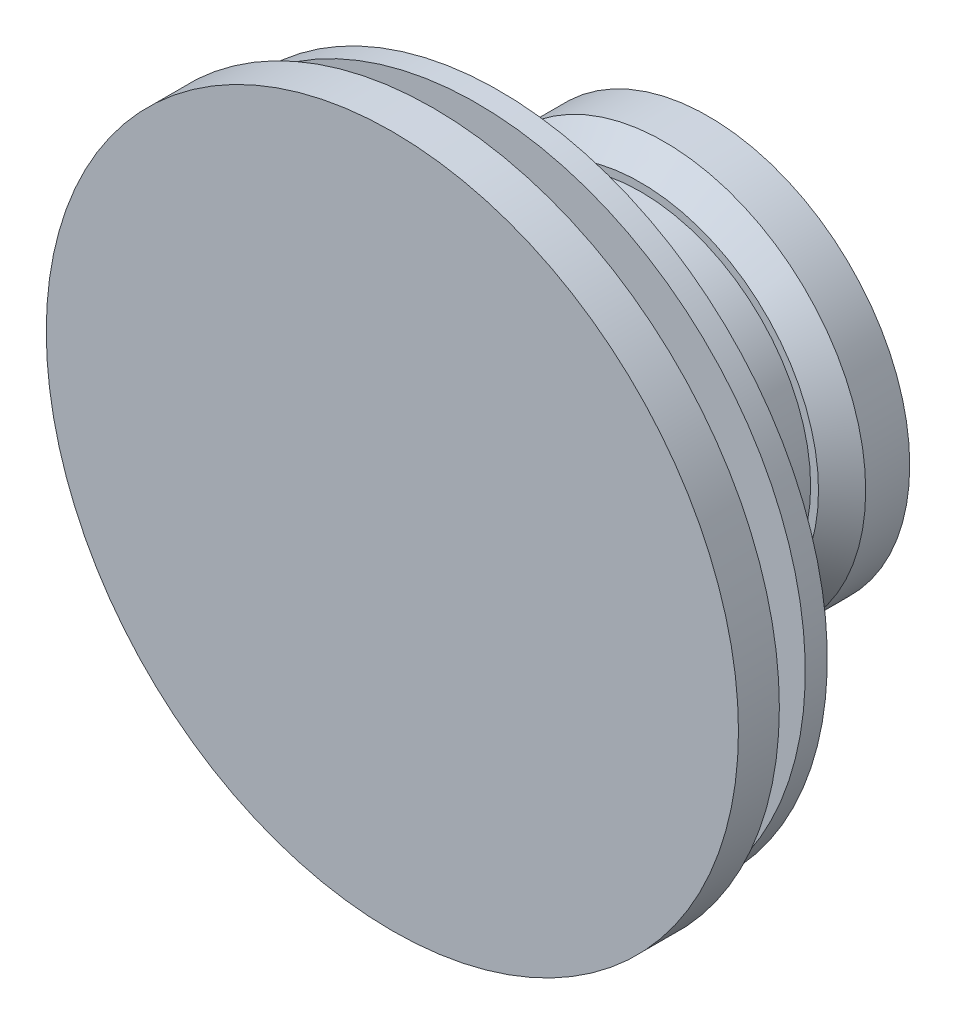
ISO-10303-21;
HEADER;
FILE_DESCRIPTION(('STEP AP214'),'2;1');
FILE_NAME('part.step','',(''),(''),'','','');
FILE_SCHEMA(('AUTOMOTIVE_DESIGN { 1 0 10303 214 1 1 1 1 }'));
ENDSEC;
DATA;
#1=APPLICATION_CONTEXT('core data for automotive mechanical design processes');
#2=APPLICATION_PROTOCOL_DEFINITION('international standard','automotive_design',2000,#1);
#3=PRODUCT_CONTEXT('',#1,'mechanical');
#4=PRODUCT('Part','Part','',(#3));
#5=PRODUCT_RELATED_PRODUCT_CATEGORY('part','',(#4));
#6=PRODUCT_DEFINITION_FORMATION('','',#4);
#7=PRODUCT_DEFINITION_CONTEXT('part definition',#1,'design');
#8=PRODUCT_DEFINITION('design','',#6,#7);
#9=PRODUCT_DEFINITION_SHAPE('','',#8);
#10=(LENGTH_UNIT() NAMED_UNIT(*) SI_UNIT(.MILLI.,.METRE.));
#11=(NAMED_UNIT(*) PLANE_ANGLE_UNIT() SI_UNIT($,.RADIAN.));
#12=(NAMED_UNIT(*) SI_UNIT($,.STERADIAN.) SOLID_ANGLE_UNIT());
#13=UNCERTAINTY_MEASURE_WITH_UNIT(LENGTH_MEASURE(1.E-05),#10,'distance_accuracy_value','');
#14=(GEOMETRIC_REPRESENTATION_CONTEXT(3) GLOBAL_UNCERTAINTY_ASSIGNED_CONTEXT((#13)) GLOBAL_UNIT_ASSIGNED_CONTEXT((#10,
#11,#12)) REPRESENTATION_CONTEXT('',''));
#15=CARTESIAN_POINT('',(0.,0.,0.));
#16=DIRECTION('',(0.,0.,1.));
#17=DIRECTION('',(1.,0.,0.));
#18=AXIS2_PLACEMENT_3D('',#15,#16,#17);
#19=CARTESIAN_POINT('',(26.4922,0.,-8.62));
#20=DIRECTION('',(0.,0.,1.));
#21=DIRECTION('',(1.,0.,0.));
#22=AXIS2_PLACEMENT_3D('',#19,#20,#21);
#23=PLANE('',#22);
#24=DIRECTION('',(-1.,0.,0.));
#25=VECTOR('',#24,1.);
#26=CARTESIAN_POINT('',(3.42948706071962,-18.4350957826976,-8.62));
#27=LINE('',#26,#25);
#28=CARTESIAN_POINT('',(3.42948706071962,-18.4350957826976,-8.62));
#29=VERTEX_POINT('',#28);
#30=CARTESIAN_POINT('',(1.99358962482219,-18.4350957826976,-8.62));
#31=VERTEX_POINT('',#30);
#32=EDGE_CURVE('E86',#29,#31,#27,.T.);
#33=ORIENTED_EDGE('',*,*,#32,.T.);
#34=DIRECTION('',(0.,-1.,0.));
#35=VECTOR('',#34,1.);
#36=CARTESIAN_POINT('',(1.99358962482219,-18.4350957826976,-8.62));
#37=LINE('',#36,#35);
#38=CARTESIAN_POINT('',(1.99358962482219,-18.7940701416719,-8.62));
#39=VERTEX_POINT('',#38);
#40=EDGE_CURVE('E2361',#31,#39,#37,.T.);
#41=ORIENTED_EDGE('',*,*,#40,.T.);
#42=DIRECTION('',(1.,0.,0.));
#43=VECTOR('',#42,1.);
#44=CARTESIAN_POINT('',(1.99358962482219,-18.7940701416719,-8.62));
#45=LINE('',#44,#43);
#46=CARTESIAN_POINT('',(3.18409443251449,-18.7940701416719,-8.62));
#47=VERTEX_POINT('',#46);
#48=EDGE_CURVE('E2365',#39,#47,#45,.T.);
#49=ORIENTED_EDGE('',*,*,#48,.T.);
#50=DIRECTION('',(0.200705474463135,-0.97965162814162,0.));
#51=VECTOR('',#50,1.);
#52=CARTESIAN_POINT('',(3.18409443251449,-18.7940701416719,-8.62));
#53=LINE('',#52,#51);
#54=CARTESIAN_POINT('',(3.37269619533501,-19.7146430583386,-8.62));
#55=VERTEX_POINT('',#54);
#56=EDGE_CURVE('E2369',#47,#55,#53,.T.);
#57=ORIENTED_EDGE('',*,*,#56,.T.);
#58=CARTESIAN_POINT('',(3.37269619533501,-19.7146430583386,-8.62));
#59=CARTESIAN_POINT('',(3.33564032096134,-19.7044127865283,-8.62));
#60=CARTESIAN_POINT('',(3.26385042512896,-19.6845932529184,-8.62));
#61=CARTESIAN_POINT('',(3.15789056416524,-19.6625874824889,-8.62));
#62=CARTESIAN_POINT('',(3.05729836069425,-19.6493220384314,-8.62));
#63=CARTESIAN_POINT('',(2.99202299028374,-19.6475107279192,-8.62));
#64=CARTESIAN_POINT('',(2.96043657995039,-19.646634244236,-8.62));
#65=B_SPLINE_CURVE_WITH_KNOTS('',3,(#58,#59,#60,#61,#62,#63,#64),.UNSPECIFIED.,.F.,.F.,(4,1,1,1,
4),(0.,0.275068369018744,0.532901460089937,0.773973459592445,1.),.UNSPECIFIED.);
#66=CARTESIAN_POINT('',(2.96043657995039,-19.646634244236,-8.62));
#67=VERTEX_POINT('',#66);
#68=EDGE_CURVE('E2373',#55,#67,#65,.T.);
#69=ORIENTED_EDGE('',*,*,#68,.T.);
#70=CARTESIAN_POINT('',(2.96043657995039,-19.646634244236,-8.62));
#71=CARTESIAN_POINT('',(2.92135284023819,-19.6474801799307,-8.62));
#72=CARTESIAN_POINT('',(2.84450444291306,-19.6491435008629,-8.62));
#73=CARTESIAN_POINT('',(2.73206549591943,-19.6651153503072,-8.62));
#74=CARTESIAN_POINT('',(2.62473260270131,-19.6902552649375,-8.62));
#75=CARTESIAN_POINT('',(2.52273023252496,-19.7253757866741,-8.62));
#76=CARTESIAN_POINT('',(2.42586968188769,-19.7702855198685,-8.62));
#77=CARTESIAN_POINT('',(2.33504212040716,-19.8263854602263,-8.62));
#78=CARTESIAN_POINT('',(2.24888420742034,-19.891918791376,-8.62));
#79=CARTESIAN_POINT('',(2.16894161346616,-19.9672638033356,-8.62));
#80=CARTESIAN_POINT('',(2.09641730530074,-20.0501854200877,-8.62));
#81=CARTESIAN_POINT('',(2.03265131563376,-20.1393432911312,-8.62));
#82=CARTESIAN_POINT('',(1.97848872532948,-20.2338709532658,-8.62));
#83=CARTESIAN_POINT('',(1.93492797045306,-20.334671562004,-8.62));
#84=CARTESIAN_POINT('',(1.90014363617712,-20.4406307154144,-8.62));
#85=CARTESIAN_POINT('',(1.87699164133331,-20.5528632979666,-8.62));
#86=CARTESIAN_POINT('',(1.86157493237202,-20.67031141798,-8.62));
#87=CARTESIAN_POINT('',(1.85985254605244,-20.7506159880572,-8.62));
#88=CARTESIAN_POINT('',(1.8589742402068,-20.7915661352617,-8.62));
#89=B_SPLINE_CURVE_WITH_KNOTS('',3,(#70,#71,#72,#73,#74,#75,#76,#77,#78,#79,#80,#81,#82,#83,#84,
#85,#86,#87,#88),.UNSPECIFIED.,.F.,.F.,(4,1,1,1,1,1,1,1,1,1,1,1,1,1,1,1,4),(0.,
0.0658076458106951,0.129394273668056,0.190894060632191,0.251281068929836,0.310814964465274,
0.370370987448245,0.430768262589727,0.492881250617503,0.55510394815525,0.616067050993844,
0.677256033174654,0.738259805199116,0.800762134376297,0.864777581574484,0.931045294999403,1.),.UNSPECIFIED.);
#90=CARTESIAN_POINT('',(1.8589742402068,-20.7915661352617,-8.62));
#91=VERTEX_POINT('',#90);
#92=EDGE_CURVE('E2379',#67,#91,#89,.T.);
#93=ORIENTED_EDGE('',*,*,#92,.T.);
#94=CARTESIAN_POINT('',(1.8589742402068,-20.7915661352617,-8.62));
#95=CARTESIAN_POINT('',(1.85963931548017,-20.8200883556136,-8.62));
#96=CARTESIAN_POINT('',(1.86096047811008,-20.8767473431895,-8.62));
#97=CARTESIAN_POINT('',(1.86767906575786,-20.9608915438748,-8.62));
#98=CARTESIAN_POINT('',(1.88061478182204,-21.0432543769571,-8.62));
#99=CARTESIAN_POINT('',(1.89798250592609,-21.1238467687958,-8.62));
#100=CARTESIAN_POINT('',(1.9205249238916,-21.2025161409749,-8.62));
#101=CARTESIAN_POINT('',(1.94781397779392,-21.2794876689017,-8.62));
#102=CARTESIAN_POINT('',(1.98121000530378,-21.3542822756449,-8.62));
#103=CARTESIAN_POINT('',(2.0178413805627,-21.4276076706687,-8.62));
#104=CARTESIAN_POINT('',(2.05908785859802,-21.4978061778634,-8.62));
#105=CARTESIAN_POINT('',(2.10486636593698,-21.5634551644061,-8.62));
#106=CARTESIAN_POINT('',(2.15323185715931,-21.625539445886,-8.62));
#107=CARTESIAN_POINT('',(2.20527324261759,-21.6833931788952,-8.62));
#108=CARTESIAN_POINT('',(2.26147423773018,-21.7366361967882,-8.62));
#109=CARTESIAN_POINT('',(2.32115420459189,-21.7855844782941,-8.62));
#110=CARTESIAN_POINT('',(2.38383692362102,-21.8310658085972,-8.62));
#111=CARTESIAN_POINT('',(2.45049216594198,-21.8712340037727,-8.62));
#112=CARTESIAN_POINT('',(2.51963464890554,-21.9081969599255,-8.62));
#113=CARTESIAN_POINT('',(2.59226286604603,-21.9385204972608,-8.62));
#114=CARTESIAN_POINT('',(2.66672356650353,-21.9656310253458,-8.62));
#115=CARTESIAN_POINT('',(2.74408844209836,-21.9872405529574,-8.62));
#116=CARTESIAN_POINT('',(2.82418225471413,-22.0041731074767,-8.62));
#117=CARTESIAN_POINT('',(2.90713703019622,-22.0156737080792,-8.62));
#118=CARTESIAN_POINT('',(2.99251770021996,-22.0240501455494,-8.62));
#119=CARTESIAN_POINT('',(3.05039271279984,-22.0245745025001,-8.62));
#120=CARTESIAN_POINT('',(3.0796272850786,-22.0248393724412,-8.62));
#121=B_SPLINE_CURVE_WITH_KNOTS('',3,(#94,#95,#96,#97,#98,#99,#100,#101,#102,#103,#104,#105,#106,
#107,#108,#109,#110,#111,#112,#113,#114,#115,#116,#117,#118,#119,#120),.UNSPECIFIED.,.F.,.F.,(4,
1,1,1,1,1,1,1,1,1,1,1,1,1,1,1,1,1,1,1,1,1,1,1,4),(0.,0.0440144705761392,0.0874341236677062,
0.130118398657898,0.172553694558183,0.21455475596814,0.256298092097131,0.298438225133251,
0.340849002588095,0.382715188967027,0.423924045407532,0.464246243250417,0.504073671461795,
0.543861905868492,0.583566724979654,0.623094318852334,0.663229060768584,0.70355125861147,
0.743937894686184,0.784541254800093,0.825750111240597,0.867757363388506,0.91074516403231,
0.954914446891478,1.),.UNSPECIFIED.);
#122=CARTESIAN_POINT('',(3.0796272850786,-22.0248393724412,-8.62));
#123=VERTEX_POINT('',#122);
#124=EDGE_CURVE('E2388',#91,#123,#121,.T.);
#125=ORIENTED_EDGE('',*,*,#124,.T.);
#126=CARTESIAN_POINT('',(3.0796272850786,-22.0248393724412,-8.62));
#127=CARTESIAN_POINT('',(3.11450146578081,-22.024148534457,-8.62));
#128=CARTESIAN_POINT('',(3.18311229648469,-22.0227893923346,-8.62));
#129=CARTESIAN_POINT('',(3.28363286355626,-22.0085709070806,-8.62));
#130=CARTESIAN_POINT('',(3.38034746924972,-21.988206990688,-8.62));
#131=CARTESIAN_POINT('',(3.47247757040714,-21.9575707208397,-8.62));
#132=CARTESIAN_POINT('',(3.56084883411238,-21.9191834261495,-8.62));
#133=CARTESIAN_POINT('',(3.64427155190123,-21.870667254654,-8.62));
#134=CARTESIAN_POINT('',(3.7248773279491,-21.815688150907,-8.62));
#135=CARTESIAN_POINT('',(3.7993893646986,-21.7508077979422,-8.62));
#136=CARTESIAN_POINT('',(3.86854547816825,-21.6798921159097,-8.62));
#137=CARTESIAN_POINT('',(3.93045198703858,-21.6029344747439,-8.62));
#138=CARTESIAN_POINT('',(3.98558556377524,-21.5212050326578,-8.62));
#139=CARTESIAN_POINT('',(4.03306331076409,-21.4343068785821,-8.62));
#140=CARTESIAN_POINT('',(4.07356133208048,-21.3424683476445,-8.62));
#141=CARTESIAN_POINT('',(4.10537632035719,-21.2453453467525,-8.62));
#142=CARTESIAN_POINT('',(4.13105467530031,-21.1434453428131,-8.62));
#143=CARTESIAN_POINT('',(4.14191809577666,-21.0732918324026,-8.62));
#144=CARTESIAN_POINT('',(4.14743577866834,-21.0376598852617,-8.62));
#145=B_SPLINE_CURVE_WITH_KNOTS('',3,(#126,#127,#128,#129,#130,#131,#132,#133,#134,#135,#136,
#137,#138,#139,#140,#141,#142,#143,#144),.UNSPECIFIED.,.F.,.F.,(4,1,1,1,1,1,1,1,1,1,1,1,1,1,1,1,
4),(0.,0.0654211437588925,0.128708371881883,0.190236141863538,0.250724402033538,
0.310637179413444,0.370766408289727,0.431614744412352,0.493522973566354,0.555883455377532,
0.617342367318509,0.678668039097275,0.740711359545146,0.802985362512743,0.866802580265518,
0.932347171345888,1.),.UNSPECIFIED.);
#146=CARTESIAN_POINT('',(4.14743577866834,-21.0376598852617,-8.62));
#147=VERTEX_POINT('',#146);
#148=EDGE_CURVE('E2397',#123,#147,#145,.T.);
#149=ORIENTED_EDGE('',*,*,#148,.T.);
#150=DIRECTION('',(-1.,0.,0.));
#151=VECTOR('',#150,1.);
#152=CARTESIAN_POINT('',(4.14743577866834,-21.0376598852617,-8.62));
#153=LINE('',#152,#151);
#154=CARTESIAN_POINT('',(3.83333321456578,-21.0376598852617,-8.62));
#155=VERTEX_POINT('',#154);
#156=EDGE_CURVE('E2406',#147,#155,#153,.T.);
#157=ORIENTED_EDGE('',*,*,#156,.T.);
#158=CARTESIAN_POINT('',(3.83333321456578,-21.0376598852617,-8.62));
#159=CARTESIAN_POINT('',(3.82560465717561,-21.0710363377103,-8.62));
#160=CARTESIAN_POINT('',(3.81074994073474,-21.1351877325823,-8.62));
#161=CARTESIAN_POINT('',(3.77814419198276,-21.2253190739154,-8.62));
#162=CARTESIAN_POINT('',(3.73827831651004,-21.3056382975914,-8.62));
#163=CARTESIAN_POINT('',(3.69087396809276,-21.3772078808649,-8.62));
#164=CARTESIAN_POINT('',(3.63432393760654,-21.4396168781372,-8.62));
#165=CARTESIAN_POINT('',(3.56979450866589,-21.495233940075,-8.62));
#166=CARTESIAN_POINT('',(3.49744678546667,-21.5454090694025,-8.62));
#167=CARTESIAN_POINT('',(3.41705355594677,-21.5872318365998,-8.62));
#168=CARTESIAN_POINT('',(3.3322404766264,-21.6229005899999,-8.62));
#169=CARTESIAN_POINT('',(3.24347326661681,-21.6466522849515,-8.62));
#170=CARTESIAN_POINT('',(3.15316892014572,-21.6633531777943,-8.62));
#171=CARTESIAN_POINT('',(3.09209054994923,-21.665024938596,-8.62));
#172=CARTESIAN_POINT('',(3.06139811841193,-21.6658650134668,-8.62));
#173=B_SPLINE_CURVE_WITH_KNOTS('',3,(#158,#159,#160,#161,#162,#163,#164,#165,#166,#167,#168,
#169,#170,#171,#172),.UNSPECIFIED.,.F.,.F.,(4,1,1,1,1,1,1,1,1,1,1,1,4),(0.,0.0946872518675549,
0.181994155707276,0.264376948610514,0.342179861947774,0.418617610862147,0.49650907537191,
0.577369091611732,0.661510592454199,0.746732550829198,0.831257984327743,0.915205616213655,1.),.UNSPECIFIED.);
#174=CARTESIAN_POINT('',(3.06139811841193,-21.6658650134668,-8.62));
#175=VERTEX_POINT('',#174);
#176=EDGE_CURVE('E2413',#155,#175,#173,.T.);
#177=ORIENTED_EDGE('',*,*,#176,.T.);
#178=CARTESIAN_POINT('',(3.06139811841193,-21.6658650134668,-8.62));
#179=CARTESIAN_POINT('',(3.03143967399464,-21.6650442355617,-8.62));
#180=CARTESIAN_POINT('',(2.97245125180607,-21.6634281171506,-8.62));
#181=CARTESIAN_POINT('',(2.88563986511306,-21.6509891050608,-8.62));
#182=CARTESIAN_POINT('',(2.80182699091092,-21.6318315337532,-8.62));
#183=CARTESIAN_POINT('',(2.72183963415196,-21.6031616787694,-8.62));
#184=CARTESIAN_POINT('',(2.64427809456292,-21.5683169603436,-8.62));
#185=CARTESIAN_POINT('',(2.57110432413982,-21.5236018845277,-8.62));
#186=CARTESIAN_POINT('',(2.50020144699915,-21.4721418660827,-8.62));
#187=CARTESIAN_POINT('',(2.4337733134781,-21.4131852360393,-8.62));
#188=CARTESIAN_POINT('',(2.37293386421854,-21.3482155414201,-8.62));
#189=CARTESIAN_POINT('',(2.31917774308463,-21.2787381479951,-8.62));
#190=CARTESIAN_POINT('',(2.27440082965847,-21.2046213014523,-8.62));
#191=CARTESIAN_POINT('',(2.23666672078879,-21.1271481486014,-8.62));
#192=CARTESIAN_POINT('',(2.20801342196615,-21.0454695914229,-8.62));
#193=CARTESIAN_POINT('',(2.18757244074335,-20.9599684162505,-8.62));
#194=CARTESIAN_POINT('',(2.17556938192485,-20.8704334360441,-8.62));
#195=CARTESIAN_POINT('',(2.17391820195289,-20.8093641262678,-8.62));
#196=CARTESIAN_POINT('',(2.17307680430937,-20.7782448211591,-8.62));
#197=B_SPLINE_CURVE_WITH_KNOTS('',3,(#178,#179,#180,#181,#182,#183,#184,#185,#186,#187,#188,
#189,#190,#191,#192,#193,#194,#195,#196),.UNSPECIFIED.,.F.,.F.,(4,1,1,1,1,1,1,1,1,1,1,1,1,1,1,1,
4),(0.,0.0642072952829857,0.126424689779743,0.187680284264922,0.248216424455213,
0.308305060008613,0.369660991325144,0.43169855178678,0.495946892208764,0.55975802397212,
0.622295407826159,0.683910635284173,0.745092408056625,0.806740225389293,0.869086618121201,
0.9332900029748,1.),.UNSPECIFIED.);
#198=CARTESIAN_POINT('',(2.17307680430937,-20.7782448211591,-8.62));
#199=VERTEX_POINT('',#198);
#200=EDGE_CURVE('E2418',#175,#199,#197,.T.);
#201=ORIENTED_EDGE('',*,*,#200,.T.);
#202=CARTESIAN_POINT('',(2.17307680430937,-20.7782448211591,-8.62));
#203=CARTESIAN_POINT('',(2.17373528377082,-20.7501690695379,-8.62));
#204=CARTESIAN_POINT('',(2.17502416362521,-20.6952147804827,-8.62));
#205=CARTESIAN_POINT('',(2.18555473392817,-20.6148155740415,-8.62));
#206=CARTESIAN_POINT('',(2.20387170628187,-20.5387425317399,-8.62));
#207=CARTESIAN_POINT('',(2.22929558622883,-20.4666282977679,-8.62));
#208=CARTESIAN_POINT('',(2.26157509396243,-20.3984048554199,-8.62));
#209=CARTESIAN_POINT('',(2.30102140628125,-20.3340017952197,-8.62));
#210=CARTESIAN_POINT('',(2.34837480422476,-20.2742679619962,-8.62));
#211=CARTESIAN_POINT('',(2.40246669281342,-20.2191754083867,-8.62));
#212=CARTESIAN_POINT('',(2.4617247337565,-20.1683305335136,-8.62));
#213=CARTESIAN_POINT('',(2.52716847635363,-20.1249864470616,-8.62));
#214=CARTESIAN_POINT('',(2.59742840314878,-20.0885225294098,-8.62));
#215=CARTESIAN_POINT('',(2.67165800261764,-20.0570545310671,-8.62));
#216=CARTESIAN_POINT('',(2.75162290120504,-20.0344537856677,-8.62));
#217=CARTESIAN_POINT('',(2.83573953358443,-20.0174859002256,-8.62));
#218=CARTESIAN_POINT('',(2.92491624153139,-20.0076705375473,-8.62));
#219=CARTESIAN_POINT('',(2.98588692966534,-20.0063086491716,-8.62));
#220=CARTESIAN_POINT('',(3.01722744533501,-20.0056086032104,-8.62));
#221=B_SPLINE_CURVE_WITH_KNOTS('',3,(#202,#203,#204,#205,#206,#207,#208,#209,#210,#211,#212,
#213,#214,#215,#216,#217,#218,#219,#220),.UNSPECIFIED.,.F.,.F.,(4,1,1,1,1,1,1,1,1,1,1,1,1,1,1,1,
4),(0.,0.0653513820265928,0.127916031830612,0.1883602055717,0.247216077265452,0.305630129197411,
0.363769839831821,0.422660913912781,0.482687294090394,0.543300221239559,0.604117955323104,
0.664964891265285,0.727413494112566,0.791467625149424,0.8580554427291,0.927036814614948,1.),.UNSPECIFIED.);
#222=CARTESIAN_POINT('',(3.01722744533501,-20.0056086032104,-8.62));
#223=VERTEX_POINT('',#222);
#224=EDGE_CURVE('E2427',#199,#223,#221,.T.);
#225=ORIENTED_EDGE('',*,*,#224,.T.);
#226=CARTESIAN_POINT('',(3.01722744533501,-20.0056086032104,-8.62));
#227=CARTESIAN_POINT('',(3.04435637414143,-20.006189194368,-8.62));
#228=CARTESIAN_POINT('',(3.10037072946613,-20.0073879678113,-8.62));
#229=CARTESIAN_POINT('',(3.1862935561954,-20.0162144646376,-8.62));
#230=CARTESIAN_POINT('',(3.27658527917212,-20.0304537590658,-8.62));
#231=CARTESIAN_POINT('',(3.37089977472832,-20.0500400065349,-8.62));
#232=CARTESIAN_POINT('',(3.46952028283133,-20.0756710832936,-8.62));
#233=CARTESIAN_POINT('',(3.57223868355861,-20.1063855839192,-8.62));
#234=CARTESIAN_POINT('',(3.67927095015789,-20.1431075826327,-8.62));
#235=CARTESIAN_POINT('',(3.75138867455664,-20.1708397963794,-8.62));
#236=CARTESIAN_POINT('',(3.78846141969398,-20.1850957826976,-8.62));
#237=B_SPLINE_CURVE_WITH_KNOTS('',3,(#226,#227,#228,#229,#230,#231,#232,#233,#234,#235,#236),
.UNSPECIFIED.,.F.,.F.,(4,1,1,1,1,1,1,1,4),(0.,0.102203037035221,0.211023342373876,
0.325099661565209,0.446502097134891,0.573787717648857,0.708900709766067,0.850357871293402,1.),.UNSPECIFIED.);
#238=CARTESIAN_POINT('',(3.78846141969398,-20.1850957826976,-8.62));
#239=VERTEX_POINT('',#238);
#240=EDGE_CURVE('E2436',#223,#239,#237,.T.);
#241=ORIENTED_EDGE('',*,*,#240,.T.);
#242=DIRECTION('',(-0.200944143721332,0.97960270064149,0.));
#243=VECTOR('',#242,1.);
#244=CARTESIAN_POINT('',(3.78846141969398,-20.1850957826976,-8.62));
#245=LINE('',#244,#243);
#246=EDGE_CURVE('E646',#239,#29,#245,.T.);
#247=ORIENTED_EDGE('',*,*,#246,.T.);
#248=EDGE_LOOP('',(#33,#41,#49,#57,#69,#93,#125,#149,#157,#177,#201,#225,#241,#247));
#249=FACE_BOUND('',#248,.T.);
#250=DIRECTION('',(0.,1.,0.));
#251=VECTOR('',#250,1.);
#252=CARTESIAN_POINT('',(-3.25641037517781,-21.9350957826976,-8.62));
#253=LINE('',#252,#251);
#254=CARTESIAN_POINT('',(-3.25641037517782,-21.9350957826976,-8.62));
#255=VERTEX_POINT('',#254);
#256=CARTESIAN_POINT('',(-3.25641037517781,-19.3774034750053,-8.62));
#257=VERTEX_POINT('',#256);
#258=EDGE_CURVE('E1271',#255,#257,#253,.T.);
#259=ORIENTED_EDGE('',*,*,#258,.T.);
#260=DIRECTION('',(-1.,0.,0.));
#261=VECTOR('',#260,1.);
#262=CARTESIAN_POINT('',(-3.25641037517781,-19.3774034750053,-8.62));
#263=LINE('',#262,#261);
#264=CARTESIAN_POINT('',(-3.57051293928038,-19.3774034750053,-8.62));
#265=VERTEX_POINT('',#264);
#266=EDGE_CURVE('E1267',#257,#265,#263,.T.);
#267=ORIENTED_EDGE('',*,*,#266,.T.);
#268=DIRECTION('',(0.,-1.,0.));
#269=VECTOR('',#268,1.);
#270=CARTESIAN_POINT('',(-3.57051293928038,-19.3774034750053,-8.62));
#271=LINE('',#270,#269);
#272=CARTESIAN_POINT('',(-3.57051293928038,-19.821914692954,-8.62));
#273=VERTEX_POINT('',#272);
#274=EDGE_CURVE('E1260',#265,#273,#271,.T.);
#275=ORIENTED_EDGE('',*,*,#274,.T.);
#276=CARTESIAN_POINT('',(-3.57051293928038,-19.821914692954,-8.62));
#277=CARTESIAN_POINT('',(-3.59879688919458,-19.7830270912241,-8.62));
#278=CARTESIAN_POINT('',(-3.65299164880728,-19.7085147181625,-8.62000000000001));
#279=CARTESIAN_POINT('',(-3.74185730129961,-19.6103244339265,-8.62));
#280=CARTESIAN_POINT('',(-3.83063341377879,-19.5269962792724,-8.62));
#281=CARTESIAN_POINT('',(-3.89456679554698,-19.4832534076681,-8.62));
#282=CARTESIAN_POINT('',(-3.92528056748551,-19.4622392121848,-8.62));
#283=B_SPLINE_CURVE_WITH_KNOTS('',3,(#276,#277,#278,#279,#280,#281,#282),.UNSPECIFIED.,.F.,.F.,
(4,1,1,1,4),(0.,0.283594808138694,0.543394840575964,0.78064562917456,1.),.UNSPECIFIED.);
#284=CARTESIAN_POINT('',(-3.92528056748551,-19.4622392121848,-8.62));
#285=VERTEX_POINT('',#284);
#286=EDGE_CURVE('E1251',#273,#285,#283,.T.);
#287=ORIENTED_EDGE('',*,*,#286,.T.);
#288=CARTESIAN_POINT('',(-3.92528056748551,-19.4622392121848,-8.62));
#289=CARTESIAN_POINT('',(-3.96714522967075,-19.4422338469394,-8.62));
#290=CARTESIAN_POINT('',(-4.0501431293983,-19.4025726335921,-8.62));
#291=CARTESIAN_POINT('',(-4.18156235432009,-19.3623390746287,-8.62));
#292=CARTESIAN_POINT('',(-4.31603702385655,-19.33761397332,-8.62));
#293=CARTESIAN_POINT('',(-4.40684523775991,-19.3342325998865,-8.62));
#294=CARTESIAN_POINT('',(-4.4525241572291,-19.3325316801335,-8.62));
#295=B_SPLINE_CURVE_WITH_KNOTS('',3,(#288,#289,#290,#291,#292,#293,#294),.UNSPECIFIED.,.F.,.F.,
(4,1,1,1,4),(0.,0.253734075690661,0.503035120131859,0.750013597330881,1.),.UNSPECIFIED.);
#296=CARTESIAN_POINT('',(-4.4525241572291,-19.3325316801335,-8.62));
#297=VERTEX_POINT('',#296);
#298=EDGE_CURVE('E1242',#285,#297,#295,.T.);
#299=ORIENTED_EDGE('',*,*,#298,.T.);
#300=CARTESIAN_POINT('',(-4.4525241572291,-19.3325316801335,-8.62));
#301=CARTESIAN_POINT('',(-4.48341715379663,-19.3335769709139,-8.62));
#302=CARTESIAN_POINT('',(-4.54455273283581,-19.3356455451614,-8.62));
#303=CARTESIAN_POINT('',(-4.63513682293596,-19.3491055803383,-8.62));
#304=CARTESIAN_POINT('',(-4.72299543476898,-19.3723717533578,-8.62));
#305=CARTESIAN_POINT('',(-4.80760946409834,-19.4047790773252,-8.62));
#306=CARTESIAN_POINT('',(-4.88733014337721,-19.4440257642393,-8.62));
#307=CARTESIAN_POINT('',(-4.96041934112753,-19.490075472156,-8.62));
#308=CARTESIAN_POINT('',(-5.02604354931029,-19.5417725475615,-8.62));
#309=CARTESIAN_POINT('',(-5.08416960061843,-19.6014514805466,-8.62));
#310=CARTESIAN_POINT('',(-5.13643862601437,-19.6707880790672,-8.62));
#311=CARTESIAN_POINT('',(-5.18451747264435,-19.7516523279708,-8.62));
#312=CARTESIAN_POINT('',(-5.22894268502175,-19.8458599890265,-8.62));
#313=CARTESIAN_POINT('',(-5.25356399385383,-19.9142265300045,-8.62));
#314=CARTESIAN_POINT('',(-5.26652656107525,-19.9502199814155,-8.62));
#315=B_SPLINE_CURVE_WITH_KNOTS('',3,(#300,#301,#302,#303,#304,#305,#306,#307,#308,#309,#310,
#311,#312,#313,#314),.UNSPECIFIED.,.F.,.F.,(4,1,1,1,1,1,1,1,1,1,1,1,4),(0.,0.0841520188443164,
0.166532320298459,0.248836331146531,0.331246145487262,0.412957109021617,0.490494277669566,
0.566155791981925,0.639987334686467,0.716765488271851,0.8021439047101,0.895833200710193,1.),.UNSPECIFIED.);
#316=CARTESIAN_POINT('',(-5.26652656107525,-19.9502199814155,-8.62));
#317=VERTEX_POINT('',#316);
#318=EDGE_CURVE('E1233',#297,#317,#315,.T.);
#319=ORIENTED_EDGE('',*,*,#318,.T.);
#320=CARTESIAN_POINT('',(-5.26652656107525,-19.9502199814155,-8.62));
#321=CARTESIAN_POINT('',(-5.28023781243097,-19.9254955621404,-8.62));
#322=CARTESIAN_POINT('',(-5.30721962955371,-19.8768413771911,-8.62));
#323=CARTESIAN_POINT('',(-5.3525252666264,-19.8079831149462,-8.62));
#324=CARTESIAN_POINT('',(-5.39999306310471,-19.7435763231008,-8.62));
#325=CARTESIAN_POINT('',(-5.45002755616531,-19.6835698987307,-8.62));
#326=CARTESIAN_POINT('',(-5.50245214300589,-19.6282601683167,-8.62));
#327=CARTESIAN_POINT('',(-5.55751354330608,-19.5774642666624,-8.62));
#328=CARTESIAN_POINT('',(-5.6148983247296,-19.5309640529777,-8.62));
#329=CARTESIAN_POINT('',(-5.69469056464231,-19.476640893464,-8.62));
#330=CARTESIAN_POINT('',(-5.79850317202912,-19.4189397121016,-8.62));
#331=CARTESIAN_POINT('',(-5.92939128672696,-19.3689112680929,-8.62));
#332=CARTESIAN_POINT('',(-6.0655414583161,-19.3379951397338,-8.62));
#333=CARTESIAN_POINT('',(-6.15795915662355,-19.334364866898,-8.62));
#334=CARTESIAN_POINT('',(-6.20462752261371,-19.3325316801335,-8.62));
#335=B_SPLINE_CURVE_WITH_KNOTS('',3,(#320,#321,#322,#323,#324,#325,#326,#327,#328,#329,#330,
#331,#332,#333,#334),.UNSPECIFIED.,.F.,.F.,(4,1,1,1,1,1,1,1,1,1,1,1,4),(0.,0.0717660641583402,
0.141225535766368,0.209115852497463,0.274839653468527,0.33948293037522,0.4024762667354,
0.464941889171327,0.526832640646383,0.647414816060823,0.765561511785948,0.881615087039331,1.),.UNSPECIFIED.);
#336=CARTESIAN_POINT('',(-6.20462752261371,-19.3325316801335,-8.62));
#337=VERTEX_POINT('',#336);
#338=EDGE_CURVE('E1224',#317,#337,#335,.T.);
#339=ORIENTED_EDGE('',*,*,#338,.T.);
#340=CARTESIAN_POINT('',(-6.20462752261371,-19.3325316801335,-8.62));
#341=CARTESIAN_POINT('',(-6.24750898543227,-19.3341489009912,-8.62));
#342=CARTESIAN_POINT('',(-6.33143217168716,-19.3373139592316,-8.62));
#343=CARTESIAN_POINT('',(-6.45360943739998,-19.362167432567,-8.62));
#344=CARTESIAN_POINT('',(-6.56755124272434,-19.4048450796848,-8.62));
#345=CARTESIAN_POINT('',(-6.67302831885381,-19.4630787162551,-8.62));
#346=CARTESIAN_POINT('',(-6.76818813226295,-19.5362578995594,-8.62));
#347=CARTESIAN_POINT('',(-6.85090444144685,-19.6233267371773,-8.62));
#348=CARTESIAN_POINT('',(-6.92067480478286,-19.7236693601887,-8.62));
#349=CARTESIAN_POINT('',(-6.96625344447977,-19.8180613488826,-8.62));
#350=CARTESIAN_POINT('',(-6.99716870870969,-19.9013966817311,-8.62));
#351=CARTESIAN_POINT('',(-7.0162299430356,-19.9724029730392,-8.62));
#352=CARTESIAN_POINT('',(-7.03306963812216,-20.0505545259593,-8.62));
#353=CARTESIAN_POINT('',(-7.04705088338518,-20.1359447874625,-8.62));
#354=CARTESIAN_POINT('',(-7.05726943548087,-20.2288753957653,-8.62));
#355=CARTESIAN_POINT('',(-7.06484015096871,-20.3291942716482,-8.62));
#356=CARTESIAN_POINT('',(-7.06996422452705,-20.4369793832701,-8.62));
#357=CARTESIAN_POINT('',(-7.07032629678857,-20.5113448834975,-8.62));
#358=CARTESIAN_POINT('',(-7.07051293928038,-20.5496791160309,-8.62));
#359=B_SPLINE_CURVE_WITH_KNOTS('',3,(#340,#341,#342,#343,#344,#345,#346,#347,#348,#349,#350,
#351,#352,#353,#354,#355,#356,#357,#358),.UNSPECIFIED.,.F.,.F.,(4,1,1,1,1,1,1,1,1,1,1,1,1,1,1,1,
4),(0.,0.0756043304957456,0.147965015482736,0.218796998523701,0.289470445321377,
0.359724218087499,0.429707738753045,0.500496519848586,0.574429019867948,0.61394729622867,
0.657155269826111,0.703972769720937,0.7549389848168,0.809706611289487,0.86883295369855,
0.932385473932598,1.),.UNSPECIFIED.);
#360=CARTESIAN_POINT('',(-7.07051293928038,-20.5496791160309,-8.62));
#361=VERTEX_POINT('',#360);
#362=EDGE_CURVE('E1218',#337,#361,#359,.T.);
#363=ORIENTED_EDGE('',*,*,#362,.T.);
#364=DIRECTION('',(0.,-1.,0.));
#365=VECTOR('',#364,1.);
#366=CARTESIAN_POINT('',(-7.07051293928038,-20.5496791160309,-8.62));
#367=LINE('',#366,#365);
#368=CARTESIAN_POINT('',(-7.07051293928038,-21.9350957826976,-8.62));
#369=VERTEX_POINT('',#368);
#370=EDGE_CURVE('E1214',#361,#369,#367,.T.);
#371=ORIENTED_EDGE('',*,*,#370,.T.);
#372=DIRECTION('',(1.,0.,0.));
#373=VECTOR('',#372,1.);
#374=CARTESIAN_POINT('',(-7.07051293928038,-21.9350957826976,-8.62));
#375=LINE('',#374,#373);
#376=CARTESIAN_POINT('',(-6.75641037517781,-21.9350957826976,-8.62));
#377=VERTEX_POINT('',#376);
#378=EDGE_CURVE('E1210',#369,#377,#375,.T.);
#379=ORIENTED_EDGE('',*,*,#378,.T.);
#380=DIRECTION('',(0.,1.,0.));
#381=VECTOR('',#380,1.);
#382=CARTESIAN_POINT('',(-6.75641037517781,-21.9350957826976,-8.62));
#383=LINE('',#382,#381);
#384=CARTESIAN_POINT('',(-6.75641037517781,-20.5482768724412,-8.62));
#385=VERTEX_POINT('',#384);
#386=EDGE_CURVE('E1203',#377,#385,#383,.T.);
#387=ORIENTED_EDGE('',*,*,#386,.T.);
#388=CARTESIAN_POINT('',(-6.75641037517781,-20.5482768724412,-8.62));
#389=CARTESIAN_POINT('',(-6.75633249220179,-20.5155562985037,-8.62));
#390=CARTESIAN_POINT('',(-6.75618281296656,-20.4526723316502,-8.62));
#391=CARTESIAN_POINT('',(-6.75348918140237,-20.3624198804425,-8.62));
#392=CARTESIAN_POINT('',(-6.74841386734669,-20.2801515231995,-8.62));
#393=CARTESIAN_POINT('',(-6.74247922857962,-20.205979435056,-8.62));
#394=CARTESIAN_POINT('',(-6.73423541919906,-20.1397306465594,-8.62));
#395=CARTESIAN_POINT('',(-6.72358948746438,-20.0815382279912,-8.62));
#396=CARTESIAN_POINT('',(-6.71231180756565,-20.0309444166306,-8.62));
#397=CARTESIAN_POINT('',(-6.69357581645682,-19.9748583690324,-8.62));
#398=CARTESIAN_POINT('',(-6.66362792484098,-19.9129881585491,-8.62));
#399=CARTESIAN_POINT('',(-6.61801044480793,-19.846264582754,-8.62));
#400=CARTESIAN_POINT('',(-6.56054033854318,-19.7881837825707,-8.62));
#401=CARTESIAN_POINT('',(-6.49418018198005,-19.7377654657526,-8.62));
#402=CARTESIAN_POINT('',(-6.41863173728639,-19.6967718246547,-8.62));
#403=CARTESIAN_POINT('',(-6.33536701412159,-19.6674958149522,-8.62));
#404=CARTESIAN_POINT('',(-6.24490296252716,-19.6493729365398,-8.62));
#405=CARTESIAN_POINT('',(-6.18228017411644,-19.6475669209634,-8.62));
#406=CARTESIAN_POINT('',(-6.14994002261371,-19.646634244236,-8.62));
#407=B_SPLINE_CURVE_WITH_KNOTS('',3,(#388,#389,#390,#391,#392,#393,#394,#395,#396,#397,#398,
#399,#400,#401,#402,#403,#404,#405,#406),.UNSPECIFIED.,.F.,.F.,(4,1,1,1,1,1,1,1,1,1,1,1,1,1,1,1,
4),(0.,0.0783429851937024,0.150563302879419,0.216151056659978,0.275679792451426,
0.328707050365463,0.375904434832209,0.417301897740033,0.452692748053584,0.517265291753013,
0.581216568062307,0.645321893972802,0.712024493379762,0.780130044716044,0.850218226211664,
0.922648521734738,1.),.UNSPECIFIED.);
#408=CARTESIAN_POINT('',(-6.14994002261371,-19.646634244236,-8.62));
#409=VERTEX_POINT('',#408);
#410=EDGE_CURVE('E1194',#385,#409,#407,.T.);
#411=ORIENTED_EDGE('',*,*,#410,.T.);
#412=CARTESIAN_POINT('',(-6.14994002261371,-19.646634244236,-8.62));
#413=CARTESIAN_POINT('',(-6.11027006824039,-19.6480504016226,-8.62));
#414=CARTESIAN_POINT('',(-6.03186715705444,-19.6508492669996,-8.62));
#415=CARTESIAN_POINT('',(-5.91742167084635,-19.6794231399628,-8.62));
#416=CARTESIAN_POINT('',(-5.80745065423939,-19.7225033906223,-8.62));
#417=CARTESIAN_POINT('',(-5.70523552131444,-19.7849358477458,-8.62));
#418=CARTESIAN_POINT('',(-5.61120773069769,-19.8597442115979,-8.62));
#419=CARTESIAN_POINT('',(-5.53030815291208,-19.9486938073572,-8.62));
#420=CARTESIAN_POINT('',(-5.46347596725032,-20.0493237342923,-8.62));
#421=CARTESIAN_POINT('',(-5.41822199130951,-20.142470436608,-8.62));
#422=CARTESIAN_POINT('',(-5.38963269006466,-20.2261398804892,-8.62));
#423=CARTESIAN_POINT('',(-5.37075577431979,-20.2992372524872,-8.62));
#424=CARTESIAN_POINT('',(-5.35607238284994,-20.3823188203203,-8.62));
#425=CARTESIAN_POINT('',(-5.3423018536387,-20.4748263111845,-8.62));
#426=CARTESIAN_POINT('',(-5.33331412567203,-20.5773964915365,-8.62));
#427=CARTESIAN_POINT('',(-5.32514575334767,-20.6895548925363,-8.62));
#428=CARTESIAN_POINT('',(-5.32132489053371,-20.8116388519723,-8.62));
#429=CARTESIAN_POINT('',(-5.32079043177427,-20.8962655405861,-8.62));
#430=CARTESIAN_POINT('',(-5.32051293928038,-20.9402039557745,-8.62));
#431=B_SPLINE_CURVE_WITH_KNOTS('',3,(#412,#413,#414,#415,#416,#417,#418,#419,#420,#421,#422,
#423,#424,#425,#426,#427,#428,#429,#430),.UNSPECIFIED.,.F.,.F.,(4,1,1,1,1,1,1,1,1,1,1,1,1,1,1,1,
4),(0.,0.0681582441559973,0.134706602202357,0.201864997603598,0.270788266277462,
0.340024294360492,0.408082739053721,0.476813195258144,0.547346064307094,0.585639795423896,
0.628864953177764,0.67715320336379,0.730802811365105,0.789806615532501,0.854325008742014,
0.924365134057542,1.),.UNSPECIFIED.);
#432=CARTESIAN_POINT('',(-5.32051293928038,-20.9402039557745,-8.62));
#433=VERTEX_POINT('',#432);
#434=EDGE_CURVE('E1188',#409,#433,#431,.T.);
#435=ORIENTED_EDGE('',*,*,#434,.T.);
#436=DIRECTION('',(0.,-1.,0.));
#437=VECTOR('',#436,1.);
#438=CARTESIAN_POINT('',(-5.32051293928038,-20.9402039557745,-8.62));
#439=LINE('',#438,#437);
#440=CARTESIAN_POINT('',(-5.32051293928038,-21.9350957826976,-8.62));
#441=VERTEX_POINT('',#440);
#442=EDGE_CURVE('E1184',#433,#441,#439,.T.);
#443=ORIENTED_EDGE('',*,*,#442,.T.);
#444=DIRECTION('',(1.,0.,0.));
#445=VECTOR('',#444,1.);
#446=CARTESIAN_POINT('',(-5.32051293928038,-21.9350957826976,-8.62));
#447=LINE('',#446,#445);
#448=CARTESIAN_POINT('',(-5.00641037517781,-21.9350957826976,-8.62));
#449=VERTEX_POINT('',#448);
#450=EDGE_CURVE('E1180',#441,#449,#447,.T.);
#451=ORIENTED_EDGE('',*,*,#450,.T.);
#452=DIRECTION('',(0.,1.,0.));
#453=VECTOR('',#452,1.);
#454=CARTESIAN_POINT('',(-5.00641037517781,-21.9350957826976,-8.62));
#455=LINE('',#454,#453);
#456=CARTESIAN_POINT('',(-5.00641037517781,-20.6345148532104,-8.62));
#457=VERTEX_POINT('',#456);
#458=EDGE_CURVE('E1173',#449,#457,#455,.T.);
#459=ORIENTED_EDGE('',*,*,#458,.T.);
#460=CARTESIAN_POINT('',(-5.00641037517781,-20.6345148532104,-8.62));
#461=CARTESIAN_POINT('',(-5.00633094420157,-20.5978215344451,-8.62));
#462=CARTESIAN_POINT('',(-5.00617812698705,-20.5272272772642,-8.62));
#463=CARTESIAN_POINT('',(-5.00350180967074,-20.4259936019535,-8.62));
#464=CARTESIAN_POINT('',(-4.99841518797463,-20.3339125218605,-8.62));
#465=CARTESIAN_POINT('',(-4.99253463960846,-20.2510910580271,-8.62));
#466=CARTESIAN_POINT('',(-4.98407446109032,-20.1776797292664,-8.62));
#467=CARTESIAN_POINT('',(-4.97446469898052,-20.1132849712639,-8.62));
#468=CARTESIAN_POINT('',(-4.96311608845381,-20.0580682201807,-8.62));
#469=CARTESIAN_POINT('',(-4.94432620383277,-19.9975048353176,-8.62));
#470=CARTESIAN_POINT('',(-4.91561173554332,-19.9307839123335,-8.62));
#471=CARTESIAN_POINT('',(-4.86942347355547,-19.8596428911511,-8.62));
#472=CARTESIAN_POINT('',(-4.81181589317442,-19.7973747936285,-8.62));
#473=CARTESIAN_POINT('',(-4.7442450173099,-19.744216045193,-8.62));
#474=CARTESIAN_POINT('',(-4.66823933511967,-19.7002745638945,-8.62));
#475=CARTESIAN_POINT('',(-4.58425593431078,-19.668614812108,-8.62));
#476=CARTESIAN_POINT('',(-4.49305102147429,-19.6501905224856,-8.62));
#477=CARTESIAN_POINT('',(-4.43017331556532,-19.6478420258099,-8.62));
#478=CARTESIAN_POINT('',(-4.3978366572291,-19.646634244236,-8.62));
#479=B_SPLINE_CURVE_WITH_KNOTS('',3,(#460,#461,#462,#463,#464,#465,#466,#467,#468,#469,#470,
#471,#472,#473,#474,#475,#476,#477,#478),.UNSPECIFIED.,.F.,.F.,(4,1,1,1,1,1,1,1,1,1,1,1,1,1,1,1,
4),(0.,0.082529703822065,0.158778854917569,0.227738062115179,0.289945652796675,
0.345498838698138,0.393896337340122,0.436373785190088,0.472122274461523,0.536383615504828,
0.599077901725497,0.661948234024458,0.726310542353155,0.79177110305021,0.858647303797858,
0.927305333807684,1.),.UNSPECIFIED.);
#480=CARTESIAN_POINT('',(-4.3978366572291,-19.646634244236,-8.62));
#481=VERTEX_POINT('',#480);
#482=EDGE_CURVE('E1164',#457,#481,#479,.T.);
#483=ORIENTED_EDGE('',*,*,#482,.T.);
#484=CARTESIAN_POINT('',(-4.3978366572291,-19.646634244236,-8.62));
#485=CARTESIAN_POINT('',(-4.35982044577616,-19.648164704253,-8.62));
#486=CARTESIAN_POINT('',(-4.28405548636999,-19.6512148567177,-8.62));
#487=CARTESIAN_POINT('',(-4.1727535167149,-19.6786691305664,-8.62));
#488=CARTESIAN_POINT('',(-4.0652678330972,-19.721673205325,-8.62));
#489=CARTESIAN_POINT('',(-3.96331313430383,-19.7813330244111,-8.62));
#490=CARTESIAN_POINT('',(-3.8696389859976,-19.8552321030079,-8.62));
#491=CARTESIAN_POINT('',(-3.78763071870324,-19.9421469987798,-8.62));
#492=CARTESIAN_POINT('',(-3.71868819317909,-20.0409960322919,-8.62));
#493=CARTESIAN_POINT('',(-3.67295637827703,-20.1331605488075,-8.62));
#494=CARTESIAN_POINT('',(-3.64345790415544,-20.2147338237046,-8.62));
#495=CARTESIAN_POINT('',(-3.6238625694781,-20.2840847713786,-8.62));
#496=CARTESIAN_POINT('',(-3.60702294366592,-20.3610850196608,-8.62));
#497=CARTESIAN_POINT('',(-3.59450892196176,-20.4459721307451,-8.62));
#498=CARTESIAN_POINT('',(-3.58242850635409,-20.5381932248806,-8.62));
#499=CARTESIAN_POINT('',(-3.57659819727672,-20.6382077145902,-8.62));
#500=CARTESIAN_POINT('',(-3.5709266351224,-20.7459298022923,-8.62));
#501=CARTESIAN_POINT('',(-3.57065422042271,-20.8203023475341,-8.62));
#502=CARTESIAN_POINT('',(-3.57051293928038,-20.8588738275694,-8.62));
#503=B_SPLINE_CURVE_WITH_KNOTS('',3,(#484,#485,#486,#487,#488,#489,#490,#491,#492,#493,#494,
#495,#496,#497,#498,#499,#500,#501,#502),.UNSPECIFIED.,.F.,.F.,(4,1,1,1,1,1,1,1,1,1,1,1,1,1,1,1,
4),(0.,0.0686770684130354,0.136870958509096,0.206114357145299,0.277538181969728,
0.349771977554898,0.421250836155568,0.492910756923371,0.567026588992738,0.606614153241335,
0.649703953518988,0.697303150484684,0.749085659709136,0.804880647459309,0.865485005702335,
0.930237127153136,1.),.UNSPECIFIED.);
#504=CARTESIAN_POINT('',(-3.57051293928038,-20.8588738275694,-8.62));
#505=VERTEX_POINT('',#504);
#506=EDGE_CURVE('E1158',#481,#505,#503,.T.);
#507=ORIENTED_EDGE('',*,*,#506,.T.);
#508=DIRECTION('',(0.,-1.,0.));
#509=VECTOR('',#508,1.);
#510=CARTESIAN_POINT('',(-3.57051293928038,-20.8588738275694,-8.62));
#511=LINE('',#510,#509);
#512=CARTESIAN_POINT('',(-3.57051293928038,-21.9350957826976,-8.62));
#513=VERTEX_POINT('',#512);
#514=EDGE_CURVE('E1154',#505,#513,#511,.T.);
#515=ORIENTED_EDGE('',*,*,#514,.T.);
#516=DIRECTION('',(1.,0.,0.));
#517=VECTOR('',#516,1.);
#518=CARTESIAN_POINT('',(-3.57051293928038,-21.9350957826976,-8.62));
#519=LINE('',#518,#517);
#520=EDGE_CURVE('E926',#513,#255,#519,.T.);
#521=ORIENTED_EDGE('',*,*,#520,.T.);
#522=EDGE_LOOP('',(#259,#267,#275,#287,#299,#319,#339,#363,#371,#379,#387,#411,#435,#443,#451,
#459,#483,#507,#515,#521));
#523=FACE_BOUND('',#522,.T.);
#524=CARTESIAN_POINT('',(0.,0.,-8.62));
#525=DIRECTION('',(0.,0.,-1.));
#526=DIRECTION('',(-1.,0.,0.));
#527=AXIS2_PLACEMENT_3D('',#524,#525,#526);
#528=CIRCLE('',#527,13.716);
#529=CARTESIAN_POINT('',(-13.716,0.,-8.62));
#530=VERTEX_POINT('',#529);
#531=EDGE_CURVE('E1062',#530,#530,#528,.T.);
#532=ORIENTED_EDGE('',*,*,#531,.F.);
#533=EDGE_LOOP('',(#532));
#534=FACE_BOUND('',#533,.T.);
#535=CARTESIAN_POINT('',(0.,0.,-8.62));
#536=DIRECTION('',(0.,0.,-1.));
#537=DIRECTION('',(-1.,0.,0.));
#538=AXIS2_PLACEMENT_3D('',#535,#536,#537);
#539=CIRCLE('',#538,26.4922);
#540=CARTESIAN_POINT('',(-26.4922,0.,-8.62));
#541=VERTEX_POINT('',#540);
#542=EDGE_CURVE('E1059',#541,#541,#539,.T.);
#543=ORIENTED_EDGE('',*,*,#542,.T.);
#544=EDGE_LOOP('',(#543));
#545=FACE_BOUND('',#544,.T.);
#546=DIRECTION('',(0.,1.,0.));
#547=VECTOR('',#546,1.);
#548=CARTESIAN_POINT('',(1.27564090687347,-21.9350957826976,-8.62));
#549=LINE('',#548,#547);
#550=CARTESIAN_POINT('',(1.27564090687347,-21.9350957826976,-8.62));
#551=VERTEX_POINT('',#550);
#552=CARTESIAN_POINT('',(1.27564090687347,-19.3774034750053,-8.62));
#553=VERTEX_POINT('',#552);
#554=EDGE_CURVE('E733',#551,#553,#549,.T.);
#555=ORIENTED_EDGE('',*,*,#554,.T.);
#556=DIRECTION('',(-1.,0.,0.));
#557=VECTOR('',#556,1.);
#558=CARTESIAN_POINT('',(1.27564090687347,-19.3774034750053,-8.62));
#559=LINE('',#558,#557);
#560=CARTESIAN_POINT('',(0.961538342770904,-19.3774034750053,-8.62));
#561=VERTEX_POINT('',#560);
#562=EDGE_CURVE('E737',#553,#561,#559,.T.);
#563=ORIENTED_EDGE('',*,*,#562,.T.);
#564=DIRECTION('',(0.,-1.,0.));
#565=VECTOR('',#564,1.);
#566=CARTESIAN_POINT('',(0.961538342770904,-19.3774034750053,-8.62));
#567=LINE('',#566,#565);
#568=CARTESIAN_POINT('',(0.961538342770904,-19.821914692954,-8.62));
#569=VERTEX_POINT('',#568);
#570=EDGE_CURVE('E742',#561,#569,#567,.T.);
#571=ORIENTED_EDGE('',*,*,#570,.T.);
#572=CARTESIAN_POINT('',(0.961538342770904,-19.821914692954,-8.62));
#573=CARTESIAN_POINT('',(0.933254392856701,-19.7830270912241,-8.62));
#574=CARTESIAN_POINT('',(0.879059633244,-19.7085147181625,-8.62));
#575=CARTESIAN_POINT('',(0.79019398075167,-19.6103244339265,-8.62));
#576=CARTESIAN_POINT('',(0.701417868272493,-19.5269962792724,-8.62));
#577=CARTESIAN_POINT('',(0.637484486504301,-19.4832534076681,-8.62));
#578=CARTESIAN_POINT('',(0.606770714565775,-19.4622392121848,-8.62));
#579=B_SPLINE_CURVE_WITH_KNOTS('',3,(#572,#573,#574,#575,#576,#577,#578),.UNSPECIFIED.,.F.,.F.,
(4,1,1,1,4),(0.,0.283594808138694,0.543394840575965,0.780645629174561,1.),.UNSPECIFIED.);
#580=CARTESIAN_POINT('',(0.606770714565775,-19.4622392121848,-8.62));
#581=VERTEX_POINT('',#580);
#582=EDGE_CURVE('E746',#569,#581,#579,.T.);
#583=ORIENTED_EDGE('',*,*,#582,.T.);
#584=CARTESIAN_POINT('',(0.606770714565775,-19.4622392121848,-8.62));
#585=CARTESIAN_POINT('',(0.56490605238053,-19.4422338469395,-8.62));
#586=CARTESIAN_POINT('',(0.481908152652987,-19.4025726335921,-8.62));
#587=CARTESIAN_POINT('',(0.35048892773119,-19.3623390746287,-8.62));
#588=CARTESIAN_POINT('',(0.216014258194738,-19.33761397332,-8.62));
#589=CARTESIAN_POINT('',(0.125206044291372,-19.3342325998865,-8.62));
#590=CARTESIAN_POINT('',(0.0795271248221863,-19.3325316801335,-8.62));
#591=B_SPLINE_CURVE_WITH_KNOTS('',3,(#584,#585,#586,#587,#588,#589,#590),.UNSPECIFIED.,.F.,.F.,
(4,1,1,1,4),(0.,0.253734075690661,0.503035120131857,0.75001359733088,1.),.UNSPECIFIED.);
#592=CARTESIAN_POINT('',(0.0795271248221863,-19.3325316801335,-8.62));
#593=VERTEX_POINT('',#592);
#594=EDGE_CURVE('E752',#581,#593,#591,.T.);
#595=ORIENTED_EDGE('',*,*,#594,.T.);
#596=CARTESIAN_POINT('',(0.0795271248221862,-19.3325316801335,-8.62));
#597=CARTESIAN_POINT('',(0.0486341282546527,-19.3335769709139,-8.62));
#598=CARTESIAN_POINT('',(-0.0125014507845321,-19.3356455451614,-8.62));
#599=CARTESIAN_POINT('',(-0.103085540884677,-19.3491055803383,-8.62));
#600=CARTESIAN_POINT('',(-0.190944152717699,-19.3723717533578,-8.62));
#601=CARTESIAN_POINT('',(-0.275558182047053,-19.4047790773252,-8.62));
#602=CARTESIAN_POINT('',(-0.355278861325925,-19.4440257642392,-8.62));
#603=CARTESIAN_POINT('',(-0.428368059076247,-19.490075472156,-8.62));
#604=CARTESIAN_POINT('',(-0.493992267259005,-19.5417725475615,-8.62));
#605=CARTESIAN_POINT('',(-0.552118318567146,-19.6014514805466,-8.62));
#606=CARTESIAN_POINT('',(-0.604387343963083,-19.6707880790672,-8.62));
#607=CARTESIAN_POINT('',(-0.652466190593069,-19.7516523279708,-8.62));
#608=CARTESIAN_POINT('',(-0.696891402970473,-19.8458599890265,-8.62));
#609=CARTESIAN_POINT('',(-0.721512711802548,-19.9142265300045,-8.62));
#610=CARTESIAN_POINT('',(-0.734475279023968,-19.9502199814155,-8.62));
#611=B_SPLINE_CURVE_WITH_KNOTS('',3,(#596,#597,#598,#599,#600,#601,#602,#603,#604,#605,#606,
#607,#608,#609,#610),.UNSPECIFIED.,.F.,.F.,(4,1,1,1,1,1,1,1,1,1,1,1,4),(0.,0.0841520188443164,
0.166532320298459,0.248836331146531,0.331246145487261,0.412957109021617,0.490494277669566,
0.566155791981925,0.639987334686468,0.716765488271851,0.8021439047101,0.895833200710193,1.),.UNSPECIFIED.);
#612=CARTESIAN_POINT('',(-0.734475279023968,-19.9502199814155,-8.62));
#613=VERTEX_POINT('',#612);
#614=EDGE_CURVE('E761',#593,#613,#611,.T.);
#615=ORIENTED_EDGE('',*,*,#614,.T.);
#616=CARTESIAN_POINT('',(-0.734475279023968,-19.9502199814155,-8.62));
#617=CARTESIAN_POINT('',(-0.74818653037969,-19.9254955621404,-8.62));
#618=CARTESIAN_POINT('',(-0.77516834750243,-19.8768413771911,-8.62));
#619=CARTESIAN_POINT('',(-0.820473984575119,-19.8079831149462,-8.62));
#620=CARTESIAN_POINT('',(-0.86794178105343,-19.7435763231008,-8.62));
#621=CARTESIAN_POINT('',(-0.917976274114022,-19.6835698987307,-8.62));
#622=CARTESIAN_POINT('',(-0.970400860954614,-19.6282601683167,-8.62));
#623=CARTESIAN_POINT('',(-1.02546226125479,-19.5774642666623,-8.62));
#624=CARTESIAN_POINT('',(-1.08284704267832,-19.5309640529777,-8.62000000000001));
#625=CARTESIAN_POINT('',(-1.16263928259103,-19.476640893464,-8.62));
#626=CARTESIAN_POINT('',(-1.26645188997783,-19.4189397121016,-8.62));
#627=CARTESIAN_POINT('',(-1.39734000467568,-19.3689112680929,-8.62));
#628=CARTESIAN_POINT('',(-1.53349017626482,-19.3379951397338,-8.62));
#629=CARTESIAN_POINT('',(-1.62590787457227,-19.334364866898,-8.62));
#630=CARTESIAN_POINT('',(-1.67257624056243,-19.3325316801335,-8.62));
#631=B_SPLINE_CURVE_WITH_KNOTS('',3,(#616,#617,#618,#619,#620,#621,#622,#623,#624,#625,#626,
#627,#628,#629,#630),.UNSPECIFIED.,.F.,.F.,(4,1,1,1,1,1,1,1,1,1,1,1,4),(0.,0.0717660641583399,
0.141225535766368,0.209115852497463,0.274839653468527,0.33948293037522,0.4024762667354,
0.464941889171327,0.526832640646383,0.647414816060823,0.765561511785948,0.881615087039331,1.),.UNSPECIFIED.);
#632=CARTESIAN_POINT('',(-1.67257624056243,-19.3325316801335,-8.62));
#633=VERTEX_POINT('',#632);
#634=EDGE_CURVE('E770',#613,#633,#631,.T.);
#635=ORIENTED_EDGE('',*,*,#634,.T.);
#636=CARTESIAN_POINT('',(-1.67257624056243,-19.3325316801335,-8.62));
#637=CARTESIAN_POINT('',(-1.71545770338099,-19.3341489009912,-8.62));
#638=CARTESIAN_POINT('',(-1.79938088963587,-19.3373139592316,-8.62));
#639=CARTESIAN_POINT('',(-1.9215581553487,-19.362167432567,-8.62));
#640=CARTESIAN_POINT('',(-2.03549996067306,-19.4048450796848,-8.62));
#641=CARTESIAN_POINT('',(-2.14097703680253,-19.4630787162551,-8.62));
#642=CARTESIAN_POINT('',(-2.23613685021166,-19.5362578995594,-8.62));
#643=CARTESIAN_POINT('',(-2.31885315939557,-19.6233267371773,-8.62));
#644=CARTESIAN_POINT('',(-2.38862352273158,-19.7236693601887,-8.62));
#645=CARTESIAN_POINT('',(-2.43420216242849,-19.8180613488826,-8.62));
#646=CARTESIAN_POINT('',(-2.46511742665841,-19.9013966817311,-8.62));
#647=CARTESIAN_POINT('',(-2.48417866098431,-19.9724029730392,-8.62));
#648=CARTESIAN_POINT('',(-2.50101835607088,-20.0505545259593,-8.62));
#649=CARTESIAN_POINT('',(-2.51499960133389,-20.1359447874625,-8.62));
#650=CARTESIAN_POINT('',(-2.52521815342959,-20.2288753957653,-8.62));
#651=CARTESIAN_POINT('',(-2.53278886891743,-20.3291942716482,-8.62));
#652=CARTESIAN_POINT('',(-2.53791294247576,-20.4369793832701,-8.62));
#653=CARTESIAN_POINT('',(-2.53827501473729,-20.5113448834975,-8.62));
#654=CARTESIAN_POINT('',(-2.5384616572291,-20.5496791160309,-8.62));
#655=B_SPLINE_CURVE_WITH_KNOTS('',3,(#636,#637,#638,#639,#640,#641,#642,#643,#644,#645,#646,
#647,#648,#649,#650,#651,#652,#653,#654),.UNSPECIFIED.,.F.,.F.,(4,1,1,1,1,1,1,1,1,1,1,1,1,1,1,1,
4),(0.,0.0756043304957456,0.147965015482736,0.2187969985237,0.289470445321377,0.359724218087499,
0.429707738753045,0.500496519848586,0.574429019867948,0.61394729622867,0.657155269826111,
0.703972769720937,0.7549389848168,0.809706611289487,0.86883295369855,0.932385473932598,1.),.UNSPECIFIED.);
#656=CARTESIAN_POINT('',(-2.5384616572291,-20.5496791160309,-8.62));
#657=VERTEX_POINT('',#656);
#658=EDGE_CURVE('E779',#633,#657,#655,.T.);
#659=ORIENTED_EDGE('',*,*,#658,.T.);
#660=DIRECTION('',(0.,-1.,0.));
#661=VECTOR('',#660,1.);
#662=CARTESIAN_POINT('',(-2.5384616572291,-20.5496791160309,-8.62));
#663=LINE('',#662,#661);
#664=CARTESIAN_POINT('',(-2.5384616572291,-21.9350957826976,-8.62));
#665=VERTEX_POINT('',#664);
#666=EDGE_CURVE('E788',#657,#665,#663,.T.);
#667=ORIENTED_EDGE('',*,*,#666,.T.);
#668=DIRECTION('',(1.,0.,0.));
#669=VECTOR('',#668,1.);
#670=CARTESIAN_POINT('',(-2.5384616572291,-21.9350957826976,-8.62));
#671=LINE('',#670,#669);
#672=CARTESIAN_POINT('',(-2.22435909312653,-21.9350957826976,-8.62));
#673=VERTEX_POINT('',#672);
#674=EDGE_CURVE('E795',#665,#673,#671,.T.);
#675=ORIENTED_EDGE('',*,*,#674,.T.);
#676=DIRECTION('',(0.,1.,0.));
#677=VECTOR('',#676,1.);
#678=CARTESIAN_POINT('',(-2.22435909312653,-21.9350957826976,-8.62));
#679=LINE('',#678,#677);
#680=CARTESIAN_POINT('',(-2.22435909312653,-20.5482768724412,-8.62));
#681=VERTEX_POINT('',#680);
#682=EDGE_CURVE('E799',#673,#681,#679,.T.);
#683=ORIENTED_EDGE('',*,*,#682,.T.);
#684=CARTESIAN_POINT('',(-2.22435909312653,-20.5482768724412,-8.62));
#685=CARTESIAN_POINT('',(-2.2242812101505,-20.5155562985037,-8.62));
#686=CARTESIAN_POINT('',(-2.22413153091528,-20.4526723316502,-8.62));
#687=CARTESIAN_POINT('',(-2.22143789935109,-20.3624198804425,-8.62));
#688=CARTESIAN_POINT('',(-2.2163625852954,-20.2801515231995,-8.62));
#689=CARTESIAN_POINT('',(-2.21042794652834,-20.205979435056,-8.62));
#690=CARTESIAN_POINT('',(-2.20218413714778,-20.1397306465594,-8.62));
#691=CARTESIAN_POINT('',(-2.1915382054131,-20.0815382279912,-8.62));
#692=CARTESIAN_POINT('',(-2.18026052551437,-20.0309444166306,-8.62));
#693=CARTESIAN_POINT('',(-2.16152453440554,-19.9748583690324,-8.62));
#694=CARTESIAN_POINT('',(-2.13157664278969,-19.9129881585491,-8.62));
#695=CARTESIAN_POINT('',(-2.08595916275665,-19.846264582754,-8.62));
#696=CARTESIAN_POINT('',(-2.0284890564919,-19.7881837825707,-8.62));
#697=CARTESIAN_POINT('',(-1.96212889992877,-19.7377654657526,-8.62));
#698=CARTESIAN_POINT('',(-1.88658045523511,-19.6967718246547,-8.62));
#699=CARTESIAN_POINT('',(-1.80331573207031,-19.6674958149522,-8.62));
#700=CARTESIAN_POINT('',(-1.71285168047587,-19.6493729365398,-8.62));
#701=CARTESIAN_POINT('',(-1.65022889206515,-19.6475669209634,-8.62));
#702=CARTESIAN_POINT('',(-1.61788874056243,-19.646634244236,-8.62));
#703=B_SPLINE_CURVE_WITH_KNOTS('',3,(#684,#685,#686,#687,#688,#689,#690,#691,#692,#693,#694,
#695,#696,#697,#698,#699,#700,#701,#702),.UNSPECIFIED.,.F.,.F.,(4,1,1,1,1,1,1,1,1,1,1,1,1,1,1,1,
4),(0.,0.0783429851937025,0.150563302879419,0.216151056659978,0.275679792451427,
0.328707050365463,0.375904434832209,0.417301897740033,0.452692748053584,0.517265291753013,
0.581216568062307,0.645321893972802,0.712024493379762,0.780130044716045,0.850218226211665,
0.922648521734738,1.),.UNSPECIFIED.);
#704=CARTESIAN_POINT('',(-1.61788874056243,-19.646634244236,-8.62));
#705=VERTEX_POINT('',#704);
#706=EDGE_CURVE('E803',#681,#705,#703,.T.);
#707=ORIENTED_EDGE('',*,*,#706,.T.);
#708=CARTESIAN_POINT('',(-1.61788874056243,-19.646634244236,-8.62));
#709=CARTESIAN_POINT('',(-1.57821878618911,-19.6480504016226,-8.62));
#710=CARTESIAN_POINT('',(-1.49981587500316,-19.6508492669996,-8.62));
#711=CARTESIAN_POINT('',(-1.38537038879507,-19.6794231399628,-8.62));
#712=CARTESIAN_POINT('',(-1.2753993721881,-19.7225033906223,-8.62));
#713=CARTESIAN_POINT('',(-1.17318423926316,-19.7849358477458,-8.62));
#714=CARTESIAN_POINT('',(-1.0791564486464,-19.8597442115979,-8.62));
#715=CARTESIAN_POINT('',(-0.998256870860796,-19.9486938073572,-8.62));
#716=CARTESIAN_POINT('',(-0.931424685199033,-20.0493237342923,-8.62));
#717=CARTESIAN_POINT('',(-0.886170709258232,-20.142470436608,-8.62));
#718=CARTESIAN_POINT('',(-0.857581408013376,-20.2261398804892,-8.62));
#719=CARTESIAN_POINT('',(-0.838704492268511,-20.2992372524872,-8.62));
#720=CARTESIAN_POINT('',(-0.824021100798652,-20.3823188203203,-8.62));
#721=CARTESIAN_POINT('',(-0.81025057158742,-20.4748263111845,-8.62));
#722=CARTESIAN_POINT('',(-0.801262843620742,-20.5773964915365,-8.62));
#723=CARTESIAN_POINT('',(-0.793094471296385,-20.6895548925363,-8.62));
#724=CARTESIAN_POINT('',(-0.789273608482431,-20.8116388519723,-8.62));
#725=CARTESIAN_POINT('',(-0.78873914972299,-20.8962655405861,-8.62));
#726=CARTESIAN_POINT('',(-0.788461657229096,-20.9402039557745,-8.62));
#727=B_SPLINE_CURVE_WITH_KNOTS('',3,(#708,#709,#710,#711,#712,#713,#714,#715,#716,#717,#718,
#719,#720,#721,#722,#723,#724,#725,#726),.UNSPECIFIED.,.F.,.F.,(4,1,1,1,1,1,1,1,1,1,1,1,1,1,1,1,
4),(0.,0.0681582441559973,0.134706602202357,0.201864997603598,0.270788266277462,
0.340024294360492,0.408082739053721,0.476813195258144,0.547346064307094,0.585639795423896,
0.628864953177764,0.67715320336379,0.730802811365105,0.789806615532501,0.854325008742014,
0.924365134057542,1.),.UNSPECIFIED.);
#728=CARTESIAN_POINT('',(-0.788461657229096,-20.9402039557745,-8.62));
#729=VERTEX_POINT('',#728);
#730=EDGE_CURVE('E809',#705,#729,#727,.T.);
#731=ORIENTED_EDGE('',*,*,#730,.T.);
#732=DIRECTION('',(0.,-1.,0.));
#733=VECTOR('',#732,1.);
#734=CARTESIAN_POINT('',(-0.788461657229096,-20.9402039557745,-8.62));
#735=LINE('',#734,#733);
#736=CARTESIAN_POINT('',(-0.788461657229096,-21.9350957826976,-8.62));
#737=VERTEX_POINT('',#736);
#738=EDGE_CURVE('E818',#729,#737,#735,.T.);
#739=ORIENTED_EDGE('',*,*,#738,.T.);
#740=DIRECTION('',(1.,0.,0.));
#741=VECTOR('',#740,1.);
#742=CARTESIAN_POINT('',(-0.788461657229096,-21.9350957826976,-8.62));
#743=LINE('',#742,#741);
#744=CARTESIAN_POINT('',(-0.474359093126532,-21.9350957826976,-8.62));
#745=VERTEX_POINT('',#744);
#746=EDGE_CURVE('E825',#737,#745,#743,.T.);
#747=ORIENTED_EDGE('',*,*,#746,.T.);
#748=DIRECTION('',(0.,1.,0.));
#749=VECTOR('',#748,1.);
#750=CARTESIAN_POINT('',(-0.474359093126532,-21.9350957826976,-8.62));
#751=LINE('',#750,#749);
#752=CARTESIAN_POINT('',(-0.474359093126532,-20.6345148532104,-8.62));
#753=VERTEX_POINT('',#752);
#754=EDGE_CURVE('E829',#745,#753,#751,.T.);
#755=ORIENTED_EDGE('',*,*,#754,.T.);
#756=CARTESIAN_POINT('',(-0.474359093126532,-20.6345148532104,-8.62));
#757=CARTESIAN_POINT('',(-0.474279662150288,-20.5978215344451,-8.62));
#758=CARTESIAN_POINT('',(-0.474126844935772,-20.5272272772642,-8.62));
#759=CARTESIAN_POINT('',(-0.471450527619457,-20.4259936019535,-8.62));
#760=CARTESIAN_POINT('',(-0.466363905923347,-20.3339125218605,-8.62));
#761=CARTESIAN_POINT('',(-0.460483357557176,-20.2510910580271,-8.62));
#762=CARTESIAN_POINT('',(-0.452023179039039,-20.1776797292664,-8.62));
#763=CARTESIAN_POINT('',(-0.442413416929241,-20.1132849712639,-8.62));
#764=CARTESIAN_POINT('',(-0.431064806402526,-20.0580682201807,-8.62));
#765=CARTESIAN_POINT('',(-0.412274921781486,-19.9975048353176,-8.62));
#766=CARTESIAN_POINT('',(-0.383560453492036,-19.9307839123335,-8.62));
#767=CARTESIAN_POINT('',(-0.337372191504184,-19.8596428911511,-8.62));
#768=CARTESIAN_POINT('',(-0.279764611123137,-19.7973747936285,-8.62));
#769=CARTESIAN_POINT('',(-0.212193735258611,-19.744216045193,-8.62));
#770=CARTESIAN_POINT('',(-0.136188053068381,-19.7002745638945,-8.62));
#771=CARTESIAN_POINT('',(-0.0522046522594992,-19.668614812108,-8.62));
#772=CARTESIAN_POINT('',(0.0390002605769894,-19.6501905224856,-8.62));
#773=CARTESIAN_POINT('',(0.101877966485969,-19.6478420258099,-8.62));
#774=CARTESIAN_POINT('',(0.134214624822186,-19.646634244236,-8.62));
#775=B_SPLINE_CURVE_WITH_KNOTS('',3,(#756,#757,#758,#759,#760,#761,#762,#763,#764,#765,#766,
#767,#768,#769,#770,#771,#772,#773,#774),.UNSPECIFIED.,.F.,.F.,(4,1,1,1,1,1,1,1,1,1,1,1,1,1,1,1,
4),(0.,0.082529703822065,0.158778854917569,0.227738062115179,0.289945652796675,
0.345498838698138,0.393896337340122,0.436373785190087,0.472122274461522,0.536383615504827,
0.599077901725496,0.661948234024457,0.726310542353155,0.79177110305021,0.858647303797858,
0.927305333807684,1.),.UNSPECIFIED.);
#776=CARTESIAN_POINT('',(0.134214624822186,-19.646634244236,-8.62));
#777=VERTEX_POINT('',#776);
#778=EDGE_CURVE('E833',#753,#777,#775,.T.);
#779=ORIENTED_EDGE('',*,*,#778,.T.);
#780=CARTESIAN_POINT('',(0.134214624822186,-19.646634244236,-8.62));
#781=CARTESIAN_POINT('',(0.172230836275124,-19.648164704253,-8.62));
#782=CARTESIAN_POINT('',(0.24799579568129,-19.6512148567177,-8.62));
#783=CARTESIAN_POINT('',(0.359297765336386,-19.6786691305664,-8.62));
#784=CARTESIAN_POINT('',(0.466783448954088,-19.721673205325,-8.62));
#785=CARTESIAN_POINT('',(0.56873814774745,-19.7813330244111,-8.62));
#786=CARTESIAN_POINT('',(0.662412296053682,-19.8552321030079,-8.62));
#787=CARTESIAN_POINT('',(0.744420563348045,-19.9421469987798,-8.62));
#788=CARTESIAN_POINT('',(0.813363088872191,-20.0409960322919,-8.62));
#789=CARTESIAN_POINT('',(0.859094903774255,-20.1331605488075,-8.62));
#790=CARTESIAN_POINT('',(0.88859337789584,-20.2147338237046,-8.62));
#791=CARTESIAN_POINT('',(0.908188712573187,-20.2840847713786,-8.62));
#792=CARTESIAN_POINT('',(0.925028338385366,-20.3610850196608,-8.62));
#793=CARTESIAN_POINT('',(0.937542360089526,-20.4459721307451,-8.62));
#794=CARTESIAN_POINT('',(0.949622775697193,-20.5381932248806,-8.62));
#795=CARTESIAN_POINT('',(0.955453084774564,-20.6382077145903,-8.62));
#796=CARTESIAN_POINT('',(0.961124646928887,-20.7459298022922,-8.62));
#797=CARTESIAN_POINT('',(0.961397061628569,-20.8203023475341,-8.62));
#798=CARTESIAN_POINT('',(0.961538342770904,-20.8588738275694,-8.62));
#799=B_SPLINE_CURVE_WITH_KNOTS('',3,(#780,#781,#782,#783,#784,#785,#786,#787,#788,#789,#790,
#791,#792,#793,#794,#795,#796,#797,#798),.UNSPECIFIED.,.F.,.F.,(4,1,1,1,1,1,1,1,1,1,1,1,1,1,1,1,
4),(0.,0.0686770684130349,0.136870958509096,0.206114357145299,0.277538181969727,
0.349771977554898,0.421250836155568,0.492910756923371,0.567026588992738,0.606614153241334,
0.649703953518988,0.697303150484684,0.749085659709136,0.804880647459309,0.865485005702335,
0.930237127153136,1.),.UNSPECIFIED.);
#800=CARTESIAN_POINT('',(0.961538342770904,-20.8588738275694,-8.62));
#801=VERTEX_POINT('',#800);
#802=EDGE_CURVE('E839',#777,#801,#799,.T.);
#803=ORIENTED_EDGE('',*,*,#802,.T.);
#804=DIRECTION('',(0.,-1.,0.));
#805=VECTOR('',#804,1.);
#806=CARTESIAN_POINT('',(0.961538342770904,-20.8588738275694,-8.62));
#807=LINE('',#806,#805);
#808=CARTESIAN_POINT('',(0.961538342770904,-21.9350957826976,-8.62));
#809=VERTEX_POINT('',#808);
#810=EDGE_CURVE('E848',#801,#809,#807,.T.);
#811=ORIENTED_EDGE('',*,*,#810,.T.);
#812=DIRECTION('',(1.,0.,0.));
#813=VECTOR('',#812,1.);
#814=CARTESIAN_POINT('',(0.961538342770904,-21.9350957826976,-8.62));
#815=LINE('',#814,#813);
#816=EDGE_CURVE('E855',#809,#551,#815,.T.);
#817=ORIENTED_EDGE('',*,*,#816,.T.);
#818=EDGE_LOOP('',(#555,#563,#571,#583,#595,#615,#635,#659,#667,#675,#683,#707,#731,#739,#747,
#755,#779,#803,#811,#817));
#819=FACE_BOUND('',#818,.T.);
#820=CARTESIAN_POINT('',(5.62469940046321,-18.7043265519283,-8.62));
#821=CARTESIAN_POINT('',(5.65207023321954,-18.7050415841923,-8.62));
#822=CARTESIAN_POINT('',(5.7058220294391,-18.7064457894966,-8.62));
#823=CARTESIAN_POINT('',(5.78474106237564,-18.7162684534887,-8.62));
#824=CARTESIAN_POINT('',(5.8600268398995,-18.7332142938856,-8.62));
#825=CARTESIAN_POINT('',(5.93186874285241,-18.7563909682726,-8.62));
#826=CARTESIAN_POINT('',(6.00038832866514,-18.7858495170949,-8.62));
#827=CARTESIAN_POINT('',(6.06525237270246,-18.8225412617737,-8.62));
#828=CARTESIAN_POINT('',(6.12631526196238,-18.8663247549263,-8.62));
#829=CARTESIAN_POINT('',(6.18369178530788,-18.9159653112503,-8.62));
#830=CARTESIAN_POINT('',(6.23655576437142,-18.9712329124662,-8.62));
#831=CARTESIAN_POINT('',(6.28300264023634,-19.0328428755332,-8.62));
#832=CARTESIAN_POINT('',(6.32358665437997,-19.0996702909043,-8.62));
#833=CARTESIAN_POINT('',(6.35899588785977,-19.1715348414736,-8.62));
#834=CARTESIAN_POINT('',(6.38775157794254,-19.2490886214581,-8.62));
#835=CARTESIAN_POINT('',(6.40972472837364,-19.3320563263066,-8.62));
#836=CARTESIAN_POINT('',(6.42711157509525,-19.4200777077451,-8.62));
#837=CARTESIAN_POINT('',(6.4329200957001,-19.4808627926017,-8.62));
#838=CARTESIAN_POINT('',(6.43589731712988,-19.5120188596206,-8.62));
#839=B_SPLINE_CURVE_WITH_KNOTS('',3,(#820,#821,#822,#823,#824,#825,#826,#827,#828,#829,#830,
#831,#832,#833,#834,#835,#836,#837,#838),.UNSPECIFIED.,.F.,.F.,(4,1,1,1,1,1,1,1,1,1,1,1,1,1,1,1,
4),(0.,0.0644386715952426,0.126546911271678,0.186887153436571,0.245877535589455,
0.304040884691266,0.362191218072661,0.420975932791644,0.480660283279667,0.540600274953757,
0.600689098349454,0.661935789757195,0.724442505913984,0.789038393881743,0.856313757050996,
0.926352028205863,1.),.UNSPECIFIED.);
#840=CARTESIAN_POINT('',(5.62469940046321,-18.7043265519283,-8.62));
#841=VERTEX_POINT('',#840);
#842=CARTESIAN_POINT('',(6.43589731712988,-19.5120188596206,-8.62));
#843=VERTEX_POINT('',#842);
#844=EDGE_CURVE('E75',#841,#843,#839,.T.);
#845=ORIENTED_EDGE('',*,*,#844,.T.);
#846=DIRECTION('',(1.,0.,0.));
#847=VECTOR('',#846,1.);
#848=CARTESIAN_POINT('',(6.43589731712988,-19.5120188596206,-8.62));
#849=LINE('',#848,#847);
#850=CARTESIAN_POINT('',(6.74999988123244,-19.5120188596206,-8.62));
#851=VERTEX_POINT('',#850);
#852=EDGE_CURVE('E626',#843,#851,#849,.T.);
#853=ORIENTED_EDGE('',*,*,#852,.T.);
#854=CARTESIAN_POINT('',(6.74999988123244,-19.5120188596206,-8.62));
#855=CARTESIAN_POINT('',(6.74795272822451,-19.4703479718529,-8.62));
#856=CARTESIAN_POINT('',(6.74393217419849,-19.3885074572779,-8.62));
#857=CARTESIAN_POINT('',(6.72510388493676,-19.2691835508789,-8.62));
#858=CARTESIAN_POINT('',(6.69816300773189,-19.155128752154,-8.62));
#859=CARTESIAN_POINT('',(6.66007155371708,-19.0472588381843,-8.62));
#860=CARTESIAN_POINT('',(6.61276527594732,-18.944620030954,-8.62));
#861=CARTESIAN_POINT('',(6.55603524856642,-18.8476200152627,-8.62));
#862=CARTESIAN_POINT('',(6.488841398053,-18.7566288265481,-8.62));
#863=CARTESIAN_POINT('',(6.41263466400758,-18.6724899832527,-8.62));
#864=CARTESIAN_POINT('',(6.32986602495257,-18.5953024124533,-8.62));
#865=CARTESIAN_POINT('',(6.24056008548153,-18.5286471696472,-8.62));
#866=CARTESIAN_POINT('',(6.14671505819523,-18.4723294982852,-8.62));
#867=CARTESIAN_POINT('',(6.04861565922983,-18.4252482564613,-8.62));
#868=CARTESIAN_POINT('',(5.94515509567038,-18.3899084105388,-8.62));
#869=CARTESIAN_POINT('',(5.83727223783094,-18.3636867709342,-8.62));
#870=CARTESIAN_POINT('',(5.7244931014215,-18.3479104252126,-8.62));
#871=CARTESIAN_POINT('',(5.64765307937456,-18.3462146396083,-8.62));
#872=CARTESIAN_POINT('',(5.60857359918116,-18.345352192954,-8.62));
#873=B_SPLINE_CURVE_WITH_KNOTS('',3,(#854,#855,#856,#857,#858,#859,#860,#861,#862,#863,#864,
#865,#866,#867,#868,#869,#870,#871,#872),.UNSPECIFIED.,.F.,.F.,(4,1,1,1,1,1,1,1,1,1,1,1,1,1,1,1,
4),(0.,0.0687907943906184,0.135103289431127,0.198978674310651,0.261904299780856,
0.323494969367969,0.38519537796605,0.446969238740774,0.509764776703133,0.572250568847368,
0.633405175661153,0.693251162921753,0.75258316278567,0.812579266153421,0.873275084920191,
0.935549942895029,1.),.UNSPECIFIED.);
#874=CARTESIAN_POINT('',(5.60857359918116,-18.345352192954,-8.62));
#875=VERTEX_POINT('',#874);
#876=EDGE_CURVE('E2191',#851,#875,#873,.T.);
#877=ORIENTED_EDGE('',*,*,#876,.T.);
#878=CARTESIAN_POINT('',(5.60857359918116,-18.345352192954,-8.62));
#879=CARTESIAN_POINT('',(5.57019552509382,-18.3462506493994,-8.62));
#880=CARTESIAN_POINT('',(5.4947839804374,-18.3480160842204,-8.62));
#881=CARTESIAN_POINT('',(5.38472196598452,-18.3631771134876,-8.62));
#882=CARTESIAN_POINT('',(5.27994467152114,-18.3869227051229,-8.62));
#883=CARTESIAN_POINT('',(5.18065690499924,-18.4202381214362,-8.62));
#884=CARTESIAN_POINT('',(5.08765084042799,-18.4650225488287,-8.62));
#885=CARTESIAN_POINT('',(5.00022779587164,-18.5188200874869,-8.62));
#886=CARTESIAN_POINT('',(4.91734698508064,-18.5810399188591,-8.62));
#887=CARTESIAN_POINT('',(4.84274020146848,-18.6542937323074,-8.62));
#888=CARTESIAN_POINT('',(4.77423212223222,-18.7324961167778,-8.62));
#889=CARTESIAN_POINT('',(4.71512986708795,-18.81598402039,-8.62));
#890=CARTESIAN_POINT('',(4.66451670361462,-18.902213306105,-8.62));
#891=CARTESIAN_POINT('',(4.62232902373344,-18.9918415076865,-8.62));
#892=CARTESIAN_POINT('',(4.59127288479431,-19.0857125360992,-8.62));
#893=CARTESIAN_POINT('',(4.56769467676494,-19.1824597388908,-8.62));
#894=CARTESIAN_POINT('',(4.55436726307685,-19.2830845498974,-8.62));
#895=CARTESIAN_POINT('',(4.552321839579,-19.3511911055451,-8.62));
#896=CARTESIAN_POINT('',(4.55128193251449,-19.3858169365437,-8.62));
#897=B_SPLINE_CURVE_WITH_KNOTS('',3,(#878,#879,#880,#881,#882,#883,#884,#885,#886,#887,#888,
#889,#890,#891,#892,#893,#894,#895,#896),.UNSPECIFIED.,.F.,.F.,(4,1,1,1,1,1,1,1,1,1,1,1,1,1,1,1,
4),(0.,0.0694754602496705,0.136516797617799,0.200788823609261,0.263829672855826,
0.32573502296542,0.387290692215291,0.449509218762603,0.512967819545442,0.576275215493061,
0.637580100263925,0.697902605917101,0.757172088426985,0.816598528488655,0.876653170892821,
0.93728964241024,1.),.UNSPECIFIED.);
#898=CARTESIAN_POINT('',(4.55128193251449,-19.3858169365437,-8.62));
#899=VERTEX_POINT('',#898);
#900=EDGE_CURVE('E2197',#875,#899,#897,.T.);
#901=ORIENTED_EDGE('',*,*,#900,.T.);
#902=CARTESIAN_POINT('',(4.55128193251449,-19.3858169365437,-8.62));
#903=CARTESIAN_POINT('',(4.55297519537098,-19.4345647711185,-8.62));
#904=CARTESIAN_POINT('',(4.55633200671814,-19.5312049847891,-8.62));
#905=CARTESIAN_POINT('',(4.58504638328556,-19.6732198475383,-8.62));
#906=CARTESIAN_POINT('',(4.62989289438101,-19.8108132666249,-8.62));
#907=CARTESIAN_POINT('',(4.68389025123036,-19.9215505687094,-8.62));
#908=CARTESIAN_POINT('',(4.73836269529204,-20.0107840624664,-8.62));
#909=CARTESIAN_POINT('',(4.78745020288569,-20.0842527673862,-8.62));
#910=CARTESIAN_POINT('',(4.8449150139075,-20.1633582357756,-8.62));
#911=CARTESIAN_POINT('',(4.91159351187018,-20.2478355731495,-8.62));
#912=CARTESIAN_POINT('',(4.98610638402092,-20.3383464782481,-8.62));
#913=CARTESIAN_POINT('',(5.06912854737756,-20.4348362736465,-8.62));
#914=CARTESIAN_POINT('',(5.16125202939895,-20.5363080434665,-8.62));
#915=CARTESIAN_POINT('',(5.22591053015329,-20.6056136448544,-8.62));
#916=CARTESIAN_POINT('',(5.25941494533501,-20.6415260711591,-8.62));
#917=B_SPLINE_CURVE_WITH_KNOTS('',3,(#902,#903,#904,#905,#906,#907,#908,#909,#910,#911,#912,
#913,#914,#915,#916),.UNSPECIFIED.,.F.,.F.,(4,1,1,1,1,1,1,1,1,1,1,1,4),(0.,0.0987021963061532,
0.195672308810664,0.292422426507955,0.391342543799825,0.444462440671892,0.504228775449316,
0.570352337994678,0.642545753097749,0.722287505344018,0.807921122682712,0.900469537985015,1.),.UNSPECIFIED.);
#918=CARTESIAN_POINT('',(5.25941494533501,-20.6415260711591,-8.62));
#919=VERTEX_POINT('',#918);
#920=EDGE_CURVE('E2206',#899,#919,#917,.T.);
#921=ORIENTED_EDGE('',*,*,#920,.T.);
#922=DIRECTION('',(0.683740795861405,-0.729724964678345,0.));
#923=VECTOR('',#922,1.);
#924=CARTESIAN_POINT('',(5.25941494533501,-20.6415260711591,-8.62));
#925=LINE('',#924,#923);
#926=CARTESIAN_POINT('',(6.13511606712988,-21.5761214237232,-8.62));
#927=VERTEX_POINT('',#926);
#928=EDGE_CURVE('E2215',#919,#927,#925,.T.);
#929=ORIENTED_EDGE('',*,*,#928,.T.);
#930=DIRECTION('',(-1.,0.,0.));
#931=VECTOR('',#930,1.);
#932=CARTESIAN_POINT('',(6.13511606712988,-21.5761214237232,-8.62));
#933=LINE('',#932,#931);
#934=CARTESIAN_POINT('',(4.5064101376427,-21.5761214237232,-8.62));
#935=VERTEX_POINT('',#934);
#936=EDGE_CURVE('E2222',#927,#935,#933,.T.);
#937=ORIENTED_EDGE('',*,*,#936,.T.);
#938=DIRECTION('',(0.,-1.,0.));
#939=VECTOR('',#938,1.);
#940=CARTESIAN_POINT('',(4.5064101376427,-21.5761214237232,-8.62));
#941=LINE('',#940,#939);
#942=CARTESIAN_POINT('',(4.5064101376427,-21.9350957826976,-8.62));
#943=VERTEX_POINT('',#942);
#944=EDGE_CURVE('E2226',#935,#943,#941,.T.);
#945=ORIENTED_EDGE('',*,*,#944,.T.);
#946=DIRECTION('',(1.,0.,0.));
#947=VECTOR('',#946,1.);
#948=CARTESIAN_POINT('',(4.5064101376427,-21.9350957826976,-8.62));
#949=LINE('',#948,#947);
#950=CARTESIAN_POINT('',(6.88461526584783,-21.9350957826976,-8.62));
#951=VERTEX_POINT('',#950);
#952=EDGE_CURVE('E2230',#943,#951,#949,.T.);
#953=ORIENTED_EDGE('',*,*,#952,.T.);
#954=DIRECTION('',(-0.683776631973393,0.729691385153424,0.));
#955=VECTOR('',#954,1.);
#956=CARTESIAN_POINT('',(6.88461526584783,-21.9350957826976,-8.62));
#957=LINE('',#956,#955);
#958=CARTESIAN_POINT('',(5.52724347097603,-20.4865781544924,-8.62));
#959=VERTEX_POINT('',#958);
#960=EDGE_CURVE('E2234',#951,#959,#957,.T.);
#961=ORIENTED_EDGE('',*,*,#960,.T.);
#962=CARTESIAN_POINT('',(5.52724347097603,-20.4865781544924,-8.62));
#963=CARTESIAN_POINT('',(5.49419558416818,-20.4520798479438,-8.62));
#964=CARTESIAN_POINT('',(5.43071735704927,-20.3858156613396,-8.62));
#965=CARTESIAN_POINT('',(5.34093478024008,-20.2890727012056,-8.62));
#966=CARTESIAN_POINT('',(5.26029579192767,-20.1993231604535,-8.62));
#967=CARTESIAN_POINT('',(5.18827839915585,-20.116736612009,-8.62));
#968=CARTESIAN_POINT('',(5.12644489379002,-20.0401050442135,-8.62));
#969=CARTESIAN_POINT('',(5.07157266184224,-19.9719103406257,-8.62));
#970=CARTESIAN_POINT('',(5.02760707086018,-19.9091558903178,-8.62));
#971=CARTESIAN_POINT('',(4.9798916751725,-19.8364152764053,-8.62));
#972=CARTESIAN_POINT('',(4.93367769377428,-19.7476029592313,-8.62));
#973=CARTESIAN_POINT('',(4.89396533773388,-19.6390692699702,-8.62));
#974=CARTESIAN_POINT('',(4.86975048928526,-19.5273420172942,-8.62));
#975=CARTESIAN_POINT('',(4.86684565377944,-19.4518399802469,-8.62));
#976=CARTESIAN_POINT('',(4.86538449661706,-19.4138618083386,-8.62));
#977=B_SPLINE_CURVE_WITH_KNOTS('',3,(#962,#963,#964,#965,#966,#967,#968,#969,#970,#971,#972,
#973,#974,#975,#976),.UNSPECIFIED.,.F.,.F.,(4,1,1,1,1,1,1,1,1,1,1,1,4),(0.,0.110802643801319,
0.212829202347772,0.306101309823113,0.390647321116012,0.466924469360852,0.534481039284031,
0.593586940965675,0.64455700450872,0.736200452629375,0.825024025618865,0.911985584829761,1.),.UNSPECIFIED.);
#978=CARTESIAN_POINT('',(4.86538449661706,-19.4138618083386,-8.62));
#979=VERTEX_POINT('',#978);
#980=EDGE_CURVE('E2237',#959,#979,#977,.T.);
#981=ORIENTED_EDGE('',*,*,#980,.T.);
#982=CARTESIAN_POINT('',(4.86538449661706,-19.4138618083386,-8.62));
#983=CARTESIAN_POINT('',(4.86602023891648,-19.3899804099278,-8.62));
#984=CARTESIAN_POINT('',(4.86727316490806,-19.3429147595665,-8.62));
#985=CARTESIAN_POINT('',(4.87833086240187,-19.2739090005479,-8.62));
#986=CARTESIAN_POINT('',(4.89504136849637,-19.2073441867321,-8.62));
#987=CARTESIAN_POINT('',(4.91898662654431,-19.1430155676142,-8.62));
#988=CARTESIAN_POINT('',(4.95059336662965,-19.0815699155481,-8.62));
#989=CARTESIAN_POINT('',(4.98906674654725,-19.0229324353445,-8.62000000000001));
#990=CARTESIAN_POINT('',(5.03345680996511,-18.9662434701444,-8.62));
#991=CARTESIAN_POINT('',(5.08480807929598,-18.9130901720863,-8.62));
#992=CARTESIAN_POINT('',(5.14121959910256,-18.8644089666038,-8.62));
#993=CARTESIAN_POINT('',(5.20081384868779,-18.8212848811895,-8.62));
#994=CARTESIAN_POINT('',(5.2638639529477,-18.7852457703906,-8.62));
#995=CARTESIAN_POINT('',(5.33010407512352,-18.7557022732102,-8.62));
#996=CARTESIAN_POINT('',(5.39934954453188,-18.7325268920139,-8.62));
#997=CARTESIAN_POINT('',(5.47173428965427,-18.7164683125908,-8.62));
#998=CARTESIAN_POINT('',(5.54705830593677,-18.7063858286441,-8.62));
#999=CARTESIAN_POINT('',(5.59849180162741,-18.7050216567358,-8.62));
#1000=CARTESIAN_POINT('',(5.62469940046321,-18.7043265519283,-8.62));
#1001=B_SPLINE_CURVE_WITH_KNOTS('',3,(#982,#983,#984,#985,#986,#987,#988,#989,#990,#991,#992,
#993,#994,#995,#996,#997,#998,#999,#1000),.UNSPECIFIED.,.F.,.F.,(4,1,1,1,1,1,1,1,1,1,1,1,1,1,1,
1,4),(0.,0.0619654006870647,0.122121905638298,0.180988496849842,0.239933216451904,
0.299905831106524,0.359988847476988,0.421775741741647,0.486575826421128,0.551534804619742,
0.615017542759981,0.677258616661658,0.739729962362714,0.803050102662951,0.866495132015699,
0.931973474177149,1.),.UNSPECIFIED.);
#1002=EDGE_CURVE('E622',#979,#841,#1001,.T.);
#1003=ORIENTED_EDGE('',*,*,#1002,.T.);
#1004=EDGE_LOOP('',(#845,#853,#877,#901,#921,#929,#937,#945,#953,#961,#981,#1003));
#1005=FACE_BOUND('',#1004,.T.);
#1006=ADVANCED_FACE('F56',(#249,#523,#534,#545,#819,#1005),#23,.F.);
#1007=CARTESIAN_POINT('',(0.,0.,0.));
#1008=DIRECTION('',(0.,0.,-1.));
#1009=DIRECTION('',(-1.,0.,0.));
#1010=AXIS2_PLACEMENT_3D('',#1007,#1008,#1009);
#1011=PLANE('',#1010);
#1012=CARTESIAN_POINT('',(0.,0.,0.));
#1013=DIRECTION('',(0.,0.,-1.));
#1014=DIRECTION('',(-1.,0.,0.));
#1015=AXIS2_PLACEMENT_3D('',#1012,#1013,#1014);
#1016=CIRCLE('',#1015,27.94);
#1017=CARTESIAN_POINT('',(-27.94,0.,0.));
#1018=VERTEX_POINT('',#1017);
#1019=EDGE_CURVE('E13',#1018,#1018,#1016,.T.);
#1020=ORIENTED_EDGE('',*,*,#1019,.F.);
#1021=EDGE_LOOP('',(#1020));
#1022=FACE_BOUND('',#1021,.T.);
#1023=ADVANCED_FACE('F58',(#1022),#1011,.F.);
#1024=CARTESIAN_POINT('',(0.,0.,0.));
#1025=DIRECTION('',(0.,0.,-1.));
#1026=DIRECTION('',(-1.,0.,0.));
#1027=AXIS2_PLACEMENT_3D('',#1024,#1025,#1026);
#1028=CYLINDRICAL_SURFACE('',#1027,27.94);
#1029=CARTESIAN_POINT('',(0.,0.,-3.302));
#1030=DIRECTION('',(0.,0.,-1.));
#1031=DIRECTION('',(-1.,0.,0.));
#1032=AXIS2_PLACEMENT_3D('',#1029,#1030,#1031);
#1033=CIRCLE('',#1032,27.94);
#1034=CARTESIAN_POINT('',(-27.94,0.,-3.302));
#1035=VERTEX_POINT('',#1034);
#1036=EDGE_CURVE('E65',#1035,#1035,#1033,.T.);
#1037=ORIENTED_EDGE('',*,*,#1036,.F.);
#1038=EDGE_LOOP('',(#1037));
#1039=FACE_BOUND('',#1038,.T.);
#1040=ORIENTED_EDGE('',*,*,#1019,.T.);
#1041=EDGE_LOOP('',(#1040));
#1042=FACE_BOUND('',#1041,.T.);
#1043=ADVANCED_FACE('F1023',(#1039,#1042),#1028,.T.);
#1044=CARTESIAN_POINT('',(27.94,0.,-3.302));
#1045=DIRECTION('',(0.,0.,1.));
#1046=DIRECTION('',(1.,0.,0.));
#1047=AXIS2_PLACEMENT_3D('',#1044,#1045,#1046);
#1048=PLANE('',#1047);
#1049=CARTESIAN_POINT('',(0.,0.,-3.302));
#1050=DIRECTION('',(0.,0.,-1.));
#1051=DIRECTION('',(-1.,0.,0.));
#1052=AXIS2_PLACEMENT_3D('',#1049,#1050,#1051);
#1053=CIRCLE('',#1052,24.13);
#1054=CARTESIAN_POINT('',(-24.13,0.,-3.302));
#1055=VERTEX_POINT('',#1054);
#1056=EDGE_CURVE('E1037',#1055,#1055,#1053,.T.);
#1057=ORIENTED_EDGE('',*,*,#1056,.F.);
#1058=EDGE_LOOP('',(#1057));
#1059=FACE_BOUND('',#1058,.T.);
#1060=ORIENTED_EDGE('',*,*,#1036,.T.);
#1061=EDGE_LOOP('',(#1060));
#1062=FACE_BOUND('',#1061,.T.);
#1063=ADVANCED_FACE('F1020',(#1059,#1062),#1048,.F.);
#1064=CARTESIAN_POINT('',(0.,0.,0.));
#1065=DIRECTION('',(0.,0.,-1.));
#1066=DIRECTION('',(-1.,0.,0.));
#1067=AXIS2_PLACEMENT_3D('',#1064,#1065,#1066);
#1068=CYLINDRICAL_SURFACE('',#1067,24.13);
#1069=CARTESIAN_POINT('',(0.,0.,-4.302));
#1070=DIRECTION('',(0.,0.,-1.));
#1071=DIRECTION('',(-1.,0.,0.));
#1072=AXIS2_PLACEMENT_3D('',#1069,#1070,#1071);
#1073=CIRCLE('',#1072,24.13);
#1074=CARTESIAN_POINT('',(-24.13,0.,-4.302));
#1075=VERTEX_POINT('',#1074);
#1076=EDGE_CURVE('E1041',#1075,#1075,#1073,.T.);
#1077=ORIENTED_EDGE('',*,*,#1076,.F.);
#1078=EDGE_LOOP('',(#1077));
#1079=FACE_BOUND('',#1078,.T.);
#1080=ORIENTED_EDGE('',*,*,#1056,.T.);
#1081=EDGE_LOOP('',(#1080));
#1082=FACE_BOUND('',#1081,.T.);
#1083=ADVANCED_FACE('F1016',(#1079,#1082),#1068,.T.);
#1084=CARTESIAN_POINT('',(24.13,0.,-4.302));
#1085=DIRECTION('',(0.,0.,1.));
#1086=DIRECTION('',(1.,0.,0.));
#1087=AXIS2_PLACEMENT_3D('',#1084,#1085,#1086);
#1088=PLANE('',#1087);
#1089=CARTESIAN_POINT('',(0.,0.,-4.302));
#1090=DIRECTION('',(0.,0.,-1.));
#1091=DIRECTION('',(-1.,0.,0.));
#1092=AXIS2_PLACEMENT_3D('',#1089,#1090,#1091);
#1093=CIRCLE('',#1092,22.0472);
#1094=CARTESIAN_POINT('',(-22.0472,0.,-4.302));
#1095=VERTEX_POINT('',#1094);
#1096=EDGE_CURVE('E1047',#1095,#1095,#1093,.T.);
#1097=ORIENTED_EDGE('',*,*,#1096,.F.);
#1098=EDGE_LOOP('',(#1097));
#1099=FACE_BOUND('',#1098,.T.);
#1100=ORIENTED_EDGE('',*,*,#1076,.T.);
#1101=EDGE_LOOP('',(#1100));
#1102=FACE_BOUND('',#1101,.T.);
#1103=ADVANCED_FACE('F1012',(#1099,#1102),#1088,.F.);
#1104=CARTESIAN_POINT('',(0.,0.,0.));
#1105=DIRECTION('',(0.,0.,-1.));
#1106=DIRECTION('',(-1.,0.,0.));
#1107=AXIS2_PLACEMENT_3D('',#1104,#1105,#1106);
#1108=CYLINDRICAL_SURFACE('',#1107,22.0472);
#1109=CARTESIAN_POINT('',(0.,0.,-6.842));
#1110=DIRECTION('',(0.,0.,-1.));
#1111=DIRECTION('',(-1.,0.,0.));
#1112=AXIS2_PLACEMENT_3D('',#1109,#1110,#1111);
#1113=CIRCLE('',#1112,22.0472);
#1114=CARTESIAN_POINT('',(-22.0472,0.,-6.842));
#1115=VERTEX_POINT('',#1114);
#1116=EDGE_CURVE('E1051',#1115,#1115,#1113,.T.);
#1117=ORIENTED_EDGE('',*,*,#1116,.F.);
#1118=EDGE_LOOP('',(#1117));
#1119=FACE_BOUND('',#1118,.T.);
#1120=ORIENTED_EDGE('',*,*,#1096,.T.);
#1121=EDGE_LOOP('',(#1120));
#1122=FACE_BOUND('',#1121,.T.);
#1123=ADVANCED_FACE('F1008',(#1119,#1122),#1108,.T.);
#1124=CARTESIAN_POINT('',(22.0472,0.,-6.842));
#1125=DIRECTION('',(0.,0.,-1.));
#1126=DIRECTION('',(-1.,0.,0.));
#1127=AXIS2_PLACEMENT_3D('',#1124,#1125,#1126);
#1128=PLANE('',#1127);
#1129=CARTESIAN_POINT('',(0.,0.,-6.842));
#1130=DIRECTION('',(0.,0.,-1.));
#1131=DIRECTION('',(-1.,0.,0.));
#1132=AXIS2_PLACEMENT_3D('',#1129,#1130,#1131);
#1133=CIRCLE('',#1132,26.4922);
#1134=CARTESIAN_POINT('',(-26.4922,0.,-6.842));
#1135=VERTEX_POINT('',#1134);
#1136=EDGE_CURVE('E1055',#1135,#1135,#1133,.T.);
#1137=ORIENTED_EDGE('',*,*,#1136,.F.);
#1138=EDGE_LOOP('',(#1137));
#1139=FACE_BOUND('',#1138,.T.);
#1140=ORIENTED_EDGE('',*,*,#1116,.T.);
#1141=EDGE_LOOP('',(#1140));
#1142=FACE_BOUND('',#1141,.T.);
#1143=ADVANCED_FACE('F1004',(#1139,#1142),#1128,.F.);
#1144=CARTESIAN_POINT('',(0.,0.,0.));
#1145=DIRECTION('',(0.,0.,-1.));
#1146=DIRECTION('',(-1.,0.,0.));
#1147=AXIS2_PLACEMENT_3D('',#1144,#1145,#1146);
#1148=CYLINDRICAL_SURFACE('',#1147,26.4922);
#1149=ORIENTED_EDGE('',*,*,#542,.F.);
#1150=EDGE_LOOP('',(#1149));
#1151=FACE_BOUND('',#1150,.T.);
#1152=ORIENTED_EDGE('',*,*,#1136,.T.);
#1153=EDGE_LOOP('',(#1152));
#1154=FACE_BOUND('',#1153,.T.);
#1155=ADVANCED_FACE('F997',(#1151,#1154),#1148,.T.);
#1156=CARTESIAN_POINT('',(0.,0.,0.));
#1157=DIRECTION('',(0.,0.,-1.));
#1158=DIRECTION('',(-1.,0.,0.));
#1159=AXIS2_PLACEMENT_3D('',#1156,#1157,#1158);
#1160=CYLINDRICAL_SURFACE('',#1159,13.716);
#1161=CARTESIAN_POINT('',(0.,0.,-20.05));
#1162=DIRECTION('',(0.,0.,-1.));
#1163=DIRECTION('',(-1.,0.,0.));
#1164=AXIS2_PLACEMENT_3D('',#1161,#1162,#1163);
#1165=CIRCLE('',#1164,13.716);
#1166=CARTESIAN_POINT('',(-13.716,0.,-20.05));
#1167=VERTEX_POINT('',#1166);
#1168=EDGE_CURVE('E1066',#1167,#1167,#1165,.T.);
#1169=ORIENTED_EDGE('',*,*,#1168,.F.);
#1170=EDGE_LOOP('',(#1169));
#1171=FACE_BOUND('',#1170,.T.);
#1172=ORIENTED_EDGE('',*,*,#531,.T.);
#1173=EDGE_LOOP('',(#1172));
#1174=FACE_BOUND('',#1173,.T.);
#1175=ADVANCED_FACE('F993',(#1171,#1174),#1160,.T.);
#1176=CARTESIAN_POINT('',(13.716,0.,-20.05));
#1177=DIRECTION('',(0.,0.,-1.));
#1178=DIRECTION('',(-1.,0.,0.));
#1179=AXIS2_PLACEMENT_3D('',#1176,#1177,#1178);
#1180=PLANE('',#1179);
#1181=CARTESIAN_POINT('',(0.,0.,-20.05));
#1182=DIRECTION('',(0.,0.,-1.));
#1183=DIRECTION('',(-1.,0.,0.));
#1184=AXIS2_PLACEMENT_3D('',#1181,#1182,#1183);
#1185=CIRCLE('',#1184,14.351);
#1186=CARTESIAN_POINT('',(-14.351,0.,-20.05));
#1187=VERTEX_POINT('',#1186);
#1188=EDGE_CURVE('E1070',#1187,#1187,#1185,.T.);
#1189=ORIENTED_EDGE('',*,*,#1188,.F.);
#1190=EDGE_LOOP('',(#1189));
#1191=FACE_BOUND('',#1190,.T.);
#1192=ORIENTED_EDGE('',*,*,#1168,.T.);
#1193=EDGE_LOOP('',(#1192));
#1194=FACE_BOUND('',#1193,.T.);
#1195=ADVANCED_FACE('F989',(#1191,#1194),#1180,.F.);
#1196=CARTESIAN_POINT('',(0.,0.,-20.05));
#1197=DIRECTION('',(0.,0.,-1.));
#1198=DIRECTION('',(-1.,0.,0.));
#1199=AXIS2_PLACEMENT_3D('',#1196,#1197,#1198);
#1200=CONICAL_SURFACE('',#1199,14.351,0.785398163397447);
#1201=CARTESIAN_POINT('',(0.,0.,-21.955));
#1202=DIRECTION('',(0.,0.,-1.));
#1203=DIRECTION('',(-1.,0.,0.));
#1204=AXIS2_PLACEMENT_3D('',#1201,#1202,#1203);
#1205=CIRCLE('',#1204,16.256);
#1206=CARTESIAN_POINT('',(-16.256,0.,-21.955));
#1207=VERTEX_POINT('',#1206);
#1208=EDGE_CURVE('E1074',#1207,#1207,#1205,.T.);
#1209=ORIENTED_EDGE('',*,*,#1208,.F.);
#1210=EDGE_LOOP('',(#1209));
#1211=FACE_BOUND('',#1210,.T.);
#1212=ORIENTED_EDGE('',*,*,#1188,.T.);
#1213=EDGE_LOOP('',(#1212));
#1214=FACE_BOUND('',#1213,.T.);
#1215=ADVANCED_FACE('F985',(#1211,#1214),#1200,.T.);
#1216=CARTESIAN_POINT('',(0.,0.,0.));
#1217=DIRECTION('',(0.,0.,-1.));
#1218=DIRECTION('',(-1.,0.,0.));
#1219=AXIS2_PLACEMENT_3D('',#1216,#1217,#1218);
#1220=CYLINDRICAL_SURFACE('',#1219,16.256);
#1221=CARTESIAN_POINT('',(0.,0.,-25.511));
#1222=DIRECTION('',(0.,0.,-1.));
#1223=DIRECTION('',(-1.,0.,0.));
#1224=AXIS2_PLACEMENT_3D('',#1221,#1222,#1223);
#1225=CIRCLE('',#1224,16.256);
#1226=CARTESIAN_POINT('',(-16.256,0.,-25.511));
#1227=VERTEX_POINT('',#1226);
#1228=EDGE_CURVE('E1078',#1227,#1227,#1225,.T.);
#1229=ORIENTED_EDGE('',*,*,#1228,.F.);
#1230=EDGE_LOOP('',(#1229));
#1231=FACE_BOUND('',#1230,.T.);
#1232=ORIENTED_EDGE('',*,*,#1208,.T.);
#1233=EDGE_LOOP('',(#1232));
#1234=FACE_BOUND('',#1233,.T.);
#1235=ADVANCED_FACE('F981',(#1231,#1234),#1220,.T.);
#1236=CARTESIAN_POINT('',(0.,0.,-25.511));
#1237=DIRECTION('',(0.,0.,1.));
#1238=DIRECTION('',(1.,0.,0.));
#1239=AXIS2_PLACEMENT_3D('',#1236,#1237,#1238);
#1240=CONICAL_SURFACE('',#1239,16.256,1.5701419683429);
#1241=CARTESIAN_POINT('',(0.,0.,-25.5116543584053));
#1242=DIRECTION('',(0.,0.,-1.));
#1243=DIRECTION('',(-1.,0.,0.));
#1244=AXIS2_PLACEMENT_3D('',#1241,#1242,#1243);
#1245=CIRCLE('',#1244,15.2560002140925);
#1246=CARTESIAN_POINT('',(-15.2560002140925,0.,-25.5116543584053));
#1247=VERTEX_POINT('',#1246);
#1248=EDGE_CURVE('E1082',#1247,#1247,#1245,.T.);
#1249=ORIENTED_EDGE('',*,*,#1248,.F.);
#1250=EDGE_LOOP('',(#1249));
#1251=FACE_BOUND('',#1250,.T.);
#1252=ORIENTED_EDGE('',*,*,#1228,.T.);
#1253=EDGE_LOOP('',(#1252));
#1254=FACE_BOUND('',#1253,.T.);
#1255=ADVANCED_FACE('F977',(#1251,#1254),#1240,.T.);
#1256=CARTESIAN_POINT('',(0.,0.,0.));
#1257=DIRECTION('',(0.,0.,-1.));
#1258=DIRECTION('',(-1.,0.,0.));
#1259=AXIS2_PLACEMENT_3D('',#1256,#1257,#1258);
#1260=CYLINDRICAL_SURFACE('',#1259,15.2560002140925);
#1261=CARTESIAN_POINT('',(0.,0.,-25.0036543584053));
#1262=DIRECTION('',(0.,0.,-1.));
#1263=DIRECTION('',(-1.,0.,0.));
#1264=AXIS2_PLACEMENT_3D('',#1261,#1262,#1263);
#1265=CIRCLE('',#1264,15.2560002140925);
#1266=CARTESIAN_POINT('',(-15.2560002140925,0.,-25.0036543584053));
#1267=VERTEX_POINT('',#1266);
#1268=EDGE_CURVE('E635',#1267,#1267,#1265,.T.);
#1269=ORIENTED_EDGE('',*,*,#1268,.F.);
#1270=EDGE_LOOP('',(#1269));
#1271=FACE_BOUND('',#1270,.T.);
#1272=ORIENTED_EDGE('',*,*,#1248,.T.);
#1273=EDGE_LOOP('',(#1272));
#1274=FACE_BOUND('',#1273,.T.);
#1275=ADVANCED_FACE('F973',(#1271,#1274),#1260,.F.);
#1276=CARTESIAN_POINT('',(0.,0.,-25.0036543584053));
#1277=DIRECTION('',(0.,0.,-1.));
#1278=DIRECTION('',(-1.,0.,0.));
#1279=AXIS2_PLACEMENT_3D('',#1276,#1277,#1278);
#1280=CONICAL_SURFACE('',#1279,15.2560002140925,1.0471975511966);
#1281=CARTESIAN_POINT('',(0.,0.,-23.2438907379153));
#1282=DIRECTION('',(0.,0.,-1.));
#1283=DIRECTION('',(-1.,0.,0.));
#1284=AXIS2_PLACEMENT_3D('',#1281,#1282,#1283);
#1285=CIRCLE('',#1284,12.2080002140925);
#1286=CARTESIAN_POINT('',(-12.2080002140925,0.,-23.2438907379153));
#1287=VERTEX_POINT('',#1286);
#1288=EDGE_CURVE('E628',#1287,#1287,#1285,.T.);
#1289=ORIENTED_EDGE('',*,*,#1288,.F.);
#1290=EDGE_LOOP('',(#1289));
#1291=FACE_BOUND('',#1290,.T.);
#1292=ORIENTED_EDGE('',*,*,#1268,.T.);
#1293=EDGE_LOOP('',(#1292));
#1294=FACE_BOUND('',#1293,.T.);
#1295=ADVANCED_FACE('F969',(#1291,#1294),#1280,.F.);
#1296=CARTESIAN_POINT('',(0.,0.,35.1843629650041));
#1297=DIRECTION('',(0.,0.,-1.));
#1298=DIRECTION('',(1.,0.,0.));
#1299=AXIS2_PLACEMENT_3D('',#1296,#1297,#1298);
#1300=SPHERICAL_SURFACE('',#1299,59.69);
#1301=ORIENTED_EDGE('',*,*,#1288,.T.);
#1302=EDGE_LOOP('',(#1301));
#1303=FACE_BOUND('',#1302,.T.);
#1304=ADVANCED_FACE('F965',(#1303),#1300,.T.);
#1305=CARTESIAN_POINT('',(-3.25641037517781,-21.9350957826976,-8.366));
#1306=DIRECTION('',(-1.,0.,0.));
#1307=DIRECTION('',(0.,0.,1.));
#1308=AXIS2_PLACEMENT_3D('',#1305,#1306,#1307);
#1309=PLANE('',#1308);
#1310=ORIENTED_EDGE('',*,*,#258,.F.);
#1311=DIRECTION('',(0.,0.,-1.));
#1312=VECTOR('',#1311,1.);
#1313=CARTESIAN_POINT('',(-3.25641037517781,-21.9350957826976,-8.366));
#1314=LINE('',#1313,#1312);
#1315=CARTESIAN_POINT('',(-3.25641037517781,-21.9350957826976,-8.366));
#1316=VERTEX_POINT('',#1315);
#1317=EDGE_CURVE('E1146',#1316,#255,#1314,.T.);
#1318=ORIENTED_EDGE('',*,*,#1317,.F.);
#1319=DIRECTION('',(0.,1.,0.));
#1320=VECTOR('',#1319,1.);
#1321=CARTESIAN_POINT('',(-3.25641037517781,-21.9350957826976,-8.366));
#1322=LINE('',#1321,#1320);
#1323=CARTESIAN_POINT('',(-3.25641037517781,-19.3774034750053,-8.366));
#1324=VERTEX_POINT('',#1323);
#1325=EDGE_CURVE('E921',#1316,#1324,#1322,.T.);
#1326=ORIENTED_EDGE('',*,*,#1325,.T.);
#1327=DIRECTION('',(0.,0.,-1.));
#1328=VECTOR('',#1327,1.);
#1329=CARTESIAN_POINT('',(-3.25641037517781,-19.3774034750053,-8.366));
#1330=LINE('',#1329,#1328);
#1331=EDGE_CURVE('E738',#1324,#257,#1330,.T.);
#1332=ORIENTED_EDGE('',*,*,#1331,.T.);
#1333=EDGE_LOOP('',(#1310,#1318,#1326,#1332));
#1334=FACE_BOUND('',#1333,.T.);
#1335=ADVANCED_FACE('F961',(#1334),#1309,.T.);
#1336=CARTESIAN_POINT('',(-3.25641037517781,-19.3774034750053,-8.366));
#1337=DIRECTION('',(0.,-1.,0.));
#1338=DIRECTION('',(0.,0.,-1.));
#1339=AXIS2_PLACEMENT_3D('',#1336,#1337,#1338);
#1340=PLANE('',#1339);
#1341=ORIENTED_EDGE('',*,*,#266,.F.);
#1342=ORIENTED_EDGE('',*,*,#1331,.F.);
#1343=DIRECTION('',(-1.,0.,0.));
#1344=VECTOR('',#1343,1.);
#1345=CARTESIAN_POINT('',(-3.25641037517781,-19.3774034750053,-8.366));
#1346=LINE('',#1345,#1344);
#1347=CARTESIAN_POINT('',(-3.57051293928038,-19.3774034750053,-8.366));
#1348=VERTEX_POINT('',#1347);
#1349=EDGE_CURVE('E925',#1324,#1348,#1346,.T.);
#1350=ORIENTED_EDGE('',*,*,#1349,.T.);
#1351=DIRECTION('',(0.,0.,-1.));
#1352=VECTOR('',#1351,1.);
#1353=CARTESIAN_POINT('',(-3.57051293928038,-19.3774034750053,-8.366));
#1354=LINE('',#1353,#1352);
#1355=EDGE_CURVE('E1092',#1348,#265,#1354,.T.);
#1356=ORIENTED_EDGE('',*,*,#1355,.T.);
#1357=EDGE_LOOP('',(#1341,#1342,#1350,#1356));
#1358=FACE_BOUND('',#1357,.T.);
#1359=ADVANCED_FACE('F957',(#1358),#1340,.T.);
#1360=CARTESIAN_POINT('',(-3.57051293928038,-19.3774034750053,-8.366));
#1361=DIRECTION('',(1.,0.,0.));
#1362=DIRECTION('',(0.,0.,-1.));
#1363=AXIS2_PLACEMENT_3D('',#1360,#1361,#1362);
#1364=PLANE('',#1363);
#1365=ORIENTED_EDGE('',*,*,#274,.F.);
#1366=ORIENTED_EDGE('',*,*,#1355,.F.);
#1367=DIRECTION('',(0.,-1.,0.));
#1368=VECTOR('',#1367,1.);
#1369=CARTESIAN_POINT('',(-3.57051293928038,-19.3774034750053,-8.366));
#1370=LINE('',#1369,#1368);
#1371=CARTESIAN_POINT('',(-3.57051293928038,-19.821914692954,-8.366));
#1372=VERTEX_POINT('',#1371);
#1373=EDGE_CURVE('E929',#1348,#1372,#1370,.T.);
#1374=ORIENTED_EDGE('',*,*,#1373,.T.);
#1375=DIRECTION('',(0.,0.,-1.));
#1376=VECTOR('',#1375,1.);
#1377=CARTESIAN_POINT('',(-3.57051293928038,-19.821914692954,-8.366));
#1378=LINE('',#1377,#1376);
#1379=EDGE_CURVE('E1095',#1372,#273,#1378,.T.);
#1380=ORIENTED_EDGE('',*,*,#1379,.T.);
#1381=EDGE_LOOP('',(#1365,#1366,#1374,#1380));
#1382=FACE_BOUND('',#1381,.T.);
#1383=ADVANCED_FACE('F952',(#1382),#1364,.T.);
#1384=CARTESIAN_POINT('',(-3.57051293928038,-19.821914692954,-8.366));
#1385=CARTESIAN_POINT('',(-3.59879688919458,-19.7830270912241,-8.366));
#1386=CARTESIAN_POINT('',(-3.65299164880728,-19.7085147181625,-8.366));
#1387=CARTESIAN_POINT('',(-3.74185730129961,-19.6103244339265,-8.366));
#1388=CARTESIAN_POINT('',(-3.83063341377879,-19.5269962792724,-8.366));
#1389=CARTESIAN_POINT('',(-3.89456679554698,-19.4832534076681,-8.366));
#1390=CARTESIAN_POINT('',(-3.92528056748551,-19.4622392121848,-8.366));
#1391=B_SPLINE_CURVE_WITH_KNOTS('',3,(#1384,#1385,#1386,#1387,#1388,#1389,#1390),.UNSPECIFIED.,
.F.,.F.,(4,1,1,1,4),(0.,0.283594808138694,0.543394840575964,0.78064562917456,1.),.UNSPECIFIED.);
#1392=DIRECTION('',(0.,0.,-1.));
#1393=VECTOR('',#1392,1.);
#1394=SURFACE_OF_LINEAR_EXTRUSION('',#1391,#1393);
#1395=ORIENTED_EDGE('',*,*,#286,.F.);
#1396=ORIENTED_EDGE('',*,*,#1379,.F.);
#1397=CARTESIAN_POINT('',(-3.92528056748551,-19.4622392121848,-8.366));
#1398=VERTEX_POINT('',#1397);
#1399=EDGE_CURVE('E932',#1372,#1398,#1391,.T.);
#1400=ORIENTED_EDGE('',*,*,#1399,.T.);
#1401=DIRECTION('',(0.,0.,-1.));
#1402=VECTOR('',#1401,1.);
#1403=CARTESIAN_POINT('',(-3.92528056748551,-19.4622392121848,-8.366));
#1404=LINE('',#1403,#1402);
#1405=EDGE_CURVE('E1098',#1398,#285,#1404,.T.);
#1406=ORIENTED_EDGE('',*,*,#1405,.T.);
#1407=EDGE_LOOP('',(#1395,#1396,#1400,#1406));
#1408=FACE_BOUND('',#1407,.T.);
#1409=ADVANCED_FACE('F947',(#1408),#1394,.T.);
#1410=CARTESIAN_POINT('',(-3.92528056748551,-19.4622392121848,-8.366));
#1411=CARTESIAN_POINT('',(-3.96714522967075,-19.4422338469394,-8.366));
#1412=CARTESIAN_POINT('',(-4.0501431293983,-19.4025726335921,-8.366));
#1413=CARTESIAN_POINT('',(-4.18156235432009,-19.3623390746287,-8.366));
#1414=CARTESIAN_POINT('',(-4.31603702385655,-19.33761397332,-8.366));
#1415=CARTESIAN_POINT('',(-4.40684523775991,-19.3342325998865,-8.366));
#1416=CARTESIAN_POINT('',(-4.4525241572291,-19.3325316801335,-8.366));
#1417=B_SPLINE_CURVE_WITH_KNOTS('',3,(#1410,#1411,#1412,#1413,#1414,#1415,#1416),.UNSPECIFIED.,
.F.,.F.,(4,1,1,1,4),(0.,0.253734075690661,0.503035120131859,0.750013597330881,1.),.UNSPECIFIED.);
#1418=DIRECTION('',(0.,0.,-1.));
#1419=VECTOR('',#1418,1.);
#1420=SURFACE_OF_LINEAR_EXTRUSION('',#1417,#1419);
#1421=ORIENTED_EDGE('',*,*,#298,.F.);
#1422=ORIENTED_EDGE('',*,*,#1405,.F.);
#1423=CARTESIAN_POINT('',(-4.4525241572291,-19.3325316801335,-8.366));
#1424=VERTEX_POINT('',#1423);
#1425=EDGE_CURVE('E938',#1398,#1424,#1417,.T.);
#1426=ORIENTED_EDGE('',*,*,#1425,.T.);
#1427=DIRECTION('',(0.,0.,-1.));
#1428=VECTOR('',#1427,1.);
#1429=CARTESIAN_POINT('',(-4.4525241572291,-19.3325316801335,-8.366));
#1430=LINE('',#1429,#1428);
#1431=EDGE_CURVE('E1101',#1424,#297,#1430,.T.);
#1432=ORIENTED_EDGE('',*,*,#1431,.T.);
#1433=EDGE_LOOP('',(#1421,#1422,#1426,#1432));
#1434=FACE_BOUND('',#1433,.T.);
#1435=ADVANCED_FACE('F951',(#1434),#1420,.T.);
#1436=CARTESIAN_POINT('',(-4.4525241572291,-19.3325316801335,-8.366));
#1437=CARTESIAN_POINT('',(-4.48341715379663,-19.3335769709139,-8.366));
#1438=CARTESIAN_POINT('',(-4.54455273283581,-19.3356455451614,-8.366));
#1439=CARTESIAN_POINT('',(-4.63513682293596,-19.3491055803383,-8.366));
#1440=CARTESIAN_POINT('',(-4.72299543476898,-19.3723717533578,-8.366));
#1441=CARTESIAN_POINT('',(-4.80760946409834,-19.4047790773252,-8.366));
#1442=CARTESIAN_POINT('',(-4.88733014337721,-19.4440257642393,-8.366));
#1443=CARTESIAN_POINT('',(-4.96041934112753,-19.490075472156,-8.366));
#1444=CARTESIAN_POINT('',(-5.02604354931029,-19.5417725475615,-8.366));
#1445=CARTESIAN_POINT('',(-5.08416960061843,-19.6014514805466,-8.366));
#1446=CARTESIAN_POINT('',(-5.13643862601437,-19.6707880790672,-8.366));
#1447=CARTESIAN_POINT('',(-5.18451747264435,-19.7516523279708,-8.366));
#1448=CARTESIAN_POINT('',(-5.22894268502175,-19.8458599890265,-8.366));
#1449=CARTESIAN_POINT('',(-5.25356399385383,-19.9142265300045,-8.366));
#1450=CARTESIAN_POINT('',(-5.26652656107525,-19.9502199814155,-8.366));
#1451=B_SPLINE_CURVE_WITH_KNOTS('',3,(#1436,#1437,#1438,#1439,#1440,#1441,#1442,#1443,#1444,
#1445,#1446,#1447,#1448,#1449,#1450),.UNSPECIFIED.,.F.,.F.,(4,1,1,1,1,1,1,1,1,1,1,1,4),(0.,
0.0841520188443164,0.166532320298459,0.248836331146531,0.331246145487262,0.412957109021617,
0.490494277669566,0.566155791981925,0.639987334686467,0.716765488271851,0.8021439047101,
0.895833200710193,1.),.UNSPECIFIED.);
#1452=DIRECTION('',(0.,0.,-1.));
#1453=VECTOR('',#1452,1.);
#1454=SURFACE_OF_LINEAR_EXTRUSION('',#1451,#1453);
#1455=ORIENTED_EDGE('',*,*,#318,.F.);
#1456=ORIENTED_EDGE('',*,*,#1431,.F.);
#1457=CARTESIAN_POINT('',(-5.26652656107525,-19.9502199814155,-8.366));
#1458=VERTEX_POINT('',#1457);
#1459=EDGE_CURVE('E1425',#1424,#1458,#1451,.T.);
#1460=ORIENTED_EDGE('',*,*,#1459,.T.);
#1461=DIRECTION('',(0.,0.,-1.));
#1462=VECTOR('',#1461,1.);
#1463=CARTESIAN_POINT('',(-5.26652656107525,-19.9502199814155,-8.366));
#1464=LINE('',#1463,#1462);
#1465=EDGE_CURVE('E1104',#1458,#317,#1464,.T.);
#1466=ORIENTED_EDGE('',*,*,#1465,.T.);
#1467=EDGE_LOOP('',(#1455,#1456,#1460,#1466));
#1468=FACE_BOUND('',#1467,.T.);
#1469=ADVANCED_FACE('F1421',(#1468),#1454,.T.);
#1470=CARTESIAN_POINT('',(-5.26652656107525,-19.9502199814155,-8.366));
#1471=CARTESIAN_POINT('',(-5.28023781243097,-19.9254955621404,-8.366));
#1472=CARTESIAN_POINT('',(-5.30721962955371,-19.8768413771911,-8.366));
#1473=CARTESIAN_POINT('',(-5.3525252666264,-19.8079831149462,-8.366));
#1474=CARTESIAN_POINT('',(-5.39999306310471,-19.7435763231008,-8.366));
#1475=CARTESIAN_POINT('',(-5.45002755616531,-19.6835698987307,-8.366));
#1476=CARTESIAN_POINT('',(-5.50245214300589,-19.6282601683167,-8.366));
#1477=CARTESIAN_POINT('',(-5.55751354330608,-19.5774642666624,-8.366));
#1478=CARTESIAN_POINT('',(-5.6148983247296,-19.5309640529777,-8.366));
#1479=CARTESIAN_POINT('',(-5.69469056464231,-19.476640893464,-8.366));
#1480=CARTESIAN_POINT('',(-5.79850317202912,-19.4189397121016,-8.366));
#1481=CARTESIAN_POINT('',(-5.92939128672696,-19.3689112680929,-8.366));
#1482=CARTESIAN_POINT('',(-6.0655414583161,-19.3379951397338,-8.366));
#1483=CARTESIAN_POINT('',(-6.15795915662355,-19.334364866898,-8.366));
#1484=CARTESIAN_POINT('',(-6.20462752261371,-19.3325316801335,-8.366));
#1485=B_SPLINE_CURVE_WITH_KNOTS('',3,(#1470,#1471,#1472,#1473,#1474,#1475,#1476,#1477,#1478,
#1479,#1480,#1481,#1482,#1483,#1484),.UNSPECIFIED.,.F.,.F.,(4,1,1,1,1,1,1,1,1,1,1,1,4),(0.,
0.0717660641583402,0.141225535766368,0.209115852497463,0.274839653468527,0.33948293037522,
0.4024762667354,0.464941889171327,0.526832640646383,0.647414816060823,0.765561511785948,
0.881615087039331,1.),.UNSPECIFIED.);
#1486=DIRECTION('',(0.,0.,-1.));
#1487=VECTOR('',#1486,1.);
#1488=SURFACE_OF_LINEAR_EXTRUSION('',#1485,#1487);
#1489=ORIENTED_EDGE('',*,*,#338,.F.);
#1490=ORIENTED_EDGE('',*,*,#1465,.F.);
#1491=CARTESIAN_POINT('',(-6.20462752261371,-19.3325316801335,-8.366));
#1492=VERTEX_POINT('',#1491);
#1493=EDGE_CURVE('E1404',#1458,#1492,#1485,.T.);
#1494=ORIENTED_EDGE('',*,*,#1493,.T.);
#1495=DIRECTION('',(0.,0.,-1.));
#1496=VECTOR('',#1495,1.);
#1497=CARTESIAN_POINT('',(-6.20462752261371,-19.3325316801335,-8.366));
#1498=LINE('',#1497,#1496);
#1499=EDGE_CURVE('E1107',#1492,#337,#1498,.T.);
#1500=ORIENTED_EDGE('',*,*,#1499,.T.);
#1501=EDGE_LOOP('',(#1489,#1490,#1494,#1500));
#1502=FACE_BOUND('',#1501,.T.);
#1503=ADVANCED_FACE('F1417',(#1502),#1488,.T.);
#1504=CARTESIAN_POINT('',(-6.20462752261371,-19.3325316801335,-8.366));
#1505=CARTESIAN_POINT('',(-6.24750898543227,-19.3341489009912,-8.366));
#1506=CARTESIAN_POINT('',(-6.33143217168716,-19.3373139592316,-8.366));
#1507=CARTESIAN_POINT('',(-6.45360943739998,-19.362167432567,-8.366));
#1508=CARTESIAN_POINT('',(-6.56755124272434,-19.4048450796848,-8.366));
#1509=CARTESIAN_POINT('',(-6.67302831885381,-19.4630787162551,-8.366));
#1510=CARTESIAN_POINT('',(-6.76818813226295,-19.5362578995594,-8.366));
#1511=CARTESIAN_POINT('',(-6.85090444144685,-19.6233267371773,-8.366));
#1512=CARTESIAN_POINT('',(-6.92067480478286,-19.7236693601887,-8.366));
#1513=CARTESIAN_POINT('',(-6.96625344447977,-19.8180613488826,-8.366));
#1514=CARTESIAN_POINT('',(-6.99716870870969,-19.9013966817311,-8.366));
#1515=CARTESIAN_POINT('',(-7.0162299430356,-19.9724029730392,-8.366));
#1516=CARTESIAN_POINT('',(-7.03306963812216,-20.0505545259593,-8.366));
#1517=CARTESIAN_POINT('',(-7.04705088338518,-20.1359447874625,-8.366));
#1518=CARTESIAN_POINT('',(-7.05726943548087,-20.2288753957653,-8.366));
#1519=CARTESIAN_POINT('',(-7.06484015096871,-20.3291942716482,-8.366));
#1520=CARTESIAN_POINT('',(-7.06996422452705,-20.4369793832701,-8.366));
#1521=CARTESIAN_POINT('',(-7.07032629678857,-20.5113448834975,-8.366));
#1522=CARTESIAN_POINT('',(-7.07051293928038,-20.5496791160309,-8.366));
#1523=B_SPLINE_CURVE_WITH_KNOTS('',3,(#1504,#1505,#1506,#1507,#1508,#1509,#1510,#1511,#1512,
#1513,#1514,#1515,#1516,#1517,#1518,#1519,#1520,#1521,#1522),.UNSPECIFIED.,.F.,.F.,(4,1,1,1,1,1,
1,1,1,1,1,1,1,1,1,1,4),(0.,0.0756043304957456,0.147965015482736,0.218796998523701,
0.289470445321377,0.359724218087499,0.429707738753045,0.500496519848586,0.574429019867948,
0.61394729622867,0.657155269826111,0.703972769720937,0.7549389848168,0.809706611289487,
0.86883295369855,0.932385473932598,1.),.UNSPECIFIED.);
#1524=DIRECTION('',(0.,0.,-1.));
#1525=VECTOR('',#1524,1.);
#1526=SURFACE_OF_LINEAR_EXTRUSION('',#1523,#1525);
#1527=ORIENTED_EDGE('',*,*,#362,.F.);
#1528=ORIENTED_EDGE('',*,*,#1499,.F.);
#1529=CARTESIAN_POINT('',(-7.07051293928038,-20.5496791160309,-8.366));
#1530=VERTEX_POINT('',#1529);
#1531=EDGE_CURVE('E1398',#1492,#1530,#1523,.T.);
#1532=ORIENTED_EDGE('',*,*,#1531,.T.);
#1533=DIRECTION('',(0.,0.,-1.));
#1534=VECTOR('',#1533,1.);
#1535=CARTESIAN_POINT('',(-7.07051293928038,-20.5496791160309,-8.366));
#1536=LINE('',#1535,#1534);
#1537=EDGE_CURVE('E1110',#1530,#361,#1536,.T.);
#1538=ORIENTED_EDGE('',*,*,#1537,.T.);
#1539=EDGE_LOOP('',(#1527,#1528,#1532,#1538));
#1540=FACE_BOUND('',#1539,.T.);
#1541=ADVANCED_FACE('F1412',(#1540),#1526,.T.);
#1542=CARTESIAN_POINT('',(-7.07051293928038,-20.5496791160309,-8.366));
#1543=DIRECTION('',(1.,0.,0.));
#1544=DIRECTION('',(0.,0.,-1.));
#1545=AXIS2_PLACEMENT_3D('',#1542,#1543,#1544);
#1546=PLANE('',#1545);
#1547=ORIENTED_EDGE('',*,*,#370,.F.);
#1548=ORIENTED_EDGE('',*,*,#1537,.F.);
#1549=DIRECTION('',(0.,-1.,0.));
#1550=VECTOR('',#1549,1.);
#1551=CARTESIAN_POINT('',(-7.07051293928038,-20.5496791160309,-8.366));
#1552=LINE('',#1551,#1550);
#1553=CARTESIAN_POINT('',(-7.07051293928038,-21.9350957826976,-8.366));
#1554=VERTEX_POINT('',#1553);
#1555=EDGE_CURVE('E1393',#1530,#1554,#1552,.T.);
#1556=ORIENTED_EDGE('',*,*,#1555,.T.);
#1557=DIRECTION('',(0.,0.,-1.));
#1558=VECTOR('',#1557,1.);
#1559=CARTESIAN_POINT('',(-7.07051293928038,-21.9350957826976,-8.366));
#1560=LINE('',#1559,#1558);
#1561=EDGE_CURVE('E1113',#1554,#369,#1560,.T.);
#1562=ORIENTED_EDGE('',*,*,#1561,.T.);
#1563=EDGE_LOOP('',(#1547,#1548,#1556,#1562));
#1564=FACE_BOUND('',#1563,.T.);
#1565=ADVANCED_FACE('F1416',(#1564),#1546,.T.);
#1566=CARTESIAN_POINT('',(-7.07051293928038,-21.9350957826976,-8.366));
#1567=DIRECTION('',(0.,1.,0.));
#1568=DIRECTION('',(0.,0.,1.));
#1569=AXIS2_PLACEMENT_3D('',#1566,#1567,#1568);
#1570=PLANE('',#1569);
#1571=ORIENTED_EDGE('',*,*,#378,.F.);
#1572=ORIENTED_EDGE('',*,*,#1561,.F.);
#1573=DIRECTION('',(1.,0.,0.));
#1574=VECTOR('',#1573,1.);
#1575=CARTESIAN_POINT('',(-7.07051293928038,-21.9350957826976,-8.366));
#1576=LINE('',#1575,#1574);
#1577=CARTESIAN_POINT('',(-6.75641037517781,-21.9350957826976,-8.366));
#1578=VERTEX_POINT('',#1577);
#1579=EDGE_CURVE('E1389',#1554,#1578,#1576,.T.);
#1580=ORIENTED_EDGE('',*,*,#1579,.T.);
#1581=DIRECTION('',(0.,0.,-1.));
#1582=VECTOR('',#1581,1.);
#1583=CARTESIAN_POINT('',(-6.75641037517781,-21.9350957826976,-8.366));
#1584=LINE('',#1583,#1582);
#1585=EDGE_CURVE('E1116',#1578,#377,#1584,.T.);
#1586=ORIENTED_EDGE('',*,*,#1585,.T.);
#1587=EDGE_LOOP('',(#1571,#1572,#1580,#1586));
#1588=FACE_BOUND('',#1587,.T.);
#1589=ADVANCED_FACE('F1462',(#1588),#1570,.T.);
#1590=CARTESIAN_POINT('',(-6.75641037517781,-21.9350957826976,-8.366));
#1591=DIRECTION('',(-1.,0.,0.));
#1592=DIRECTION('',(0.,0.,1.));
#1593=AXIS2_PLACEMENT_3D('',#1590,#1591,#1592);
#1594=PLANE('',#1593);
#1595=ORIENTED_EDGE('',*,*,#386,.F.);
#1596=ORIENTED_EDGE('',*,*,#1585,.F.);
#1597=DIRECTION('',(0.,1.,0.));
#1598=VECTOR('',#1597,1.);
#1599=CARTESIAN_POINT('',(-6.75641037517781,-21.9350957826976,-8.366));
#1600=LINE('',#1599,#1598);
#1601=CARTESIAN_POINT('',(-6.75641037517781,-20.5482768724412,-8.366));
#1602=VERTEX_POINT('',#1601);
#1603=EDGE_CURVE('E1384',#1578,#1602,#1600,.T.);
#1604=ORIENTED_EDGE('',*,*,#1603,.T.);
#1605=DIRECTION('',(0.,0.,-1.));
#1606=VECTOR('',#1605,1.);
#1607=CARTESIAN_POINT('',(-6.75641037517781,-20.5482768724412,-8.366));
#1608=LINE('',#1607,#1606);
#1609=EDGE_CURVE('E1119',#1602,#385,#1608,.T.);
#1610=ORIENTED_EDGE('',*,*,#1609,.T.);
#1611=EDGE_LOOP('',(#1595,#1596,#1604,#1610));
#1612=FACE_BOUND('',#1611,.T.);
#1613=ADVANCED_FACE('F1464',(#1612),#1594,.T.);
#1614=CARTESIAN_POINT('',(-6.75641037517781,-20.5482768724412,-8.366));
#1615=CARTESIAN_POINT('',(-6.75633249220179,-20.5155562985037,-8.366));
#1616=CARTESIAN_POINT('',(-6.75618281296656,-20.4526723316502,-8.366));
#1617=CARTESIAN_POINT('',(-6.75348918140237,-20.3624198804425,-8.366));
#1618=CARTESIAN_POINT('',(-6.74841386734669,-20.2801515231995,-8.366));
#1619=CARTESIAN_POINT('',(-6.74247922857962,-20.205979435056,-8.366));
#1620=CARTESIAN_POINT('',(-6.73423541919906,-20.1397306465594,-8.366));
#1621=CARTESIAN_POINT('',(-6.72358948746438,-20.0815382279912,-8.366));
#1622=CARTESIAN_POINT('',(-6.71231180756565,-20.0309444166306,-8.366));
#1623=CARTESIAN_POINT('',(-6.69357581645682,-19.9748583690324,-8.366));
#1624=CARTESIAN_POINT('',(-6.66362792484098,-19.9129881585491,-8.366));
#1625=CARTESIAN_POINT('',(-6.61801044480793,-19.846264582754,-8.366));
#1626=CARTESIAN_POINT('',(-6.56054033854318,-19.7881837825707,-8.366));
#1627=CARTESIAN_POINT('',(-6.49418018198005,-19.7377654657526,-8.366));
#1628=CARTESIAN_POINT('',(-6.41863173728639,-19.6967718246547,-8.366));
#1629=CARTESIAN_POINT('',(-6.33536701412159,-19.6674958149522,-8.366));
#1630=CARTESIAN_POINT('',(-6.24490296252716,-19.6493729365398,-8.366));
#1631=CARTESIAN_POINT('',(-6.18228017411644,-19.6475669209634,-8.366));
#1632=CARTESIAN_POINT('',(-6.14994002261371,-19.646634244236,-8.366));
#1633=B_SPLINE_CURVE_WITH_KNOTS('',3,(#1614,#1615,#1616,#1617,#1618,#1619,#1620,#1621,#1622,
#1623,#1624,#1625,#1626,#1627,#1628,#1629,#1630,#1631,#1632),.UNSPECIFIED.,.F.,.F.,(4,1,1,1,1,1,
1,1,1,1,1,1,1,1,1,1,4),(0.,0.0783429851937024,0.150563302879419,0.216151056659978,
0.275679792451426,0.328707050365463,0.375904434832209,0.417301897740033,0.452692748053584,
0.517265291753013,0.581216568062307,0.645321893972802,0.712024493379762,0.780130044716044,
0.850218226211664,0.922648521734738,1.),.UNSPECIFIED.);
#1634=DIRECTION('',(0.,0.,-1.));
#1635=VECTOR('',#1634,1.);
#1636=SURFACE_OF_LINEAR_EXTRUSION('',#1633,#1635);
#1637=ORIENTED_EDGE('',*,*,#410,.F.);
#1638=ORIENTED_EDGE('',*,*,#1609,.F.);
#1639=CARTESIAN_POINT('',(-6.14994002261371,-19.646634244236,-8.366));
#1640=VERTEX_POINT('',#1639);
#1641=EDGE_CURVE('E1333',#1602,#1640,#1633,.T.);
#1642=ORIENTED_EDGE('',*,*,#1641,.T.);
#1643=DIRECTION('',(0.,0.,-1.));
#1644=VECTOR('',#1643,1.);
#1645=CARTESIAN_POINT('',(-6.14994002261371,-19.646634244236,-8.366));
#1646=LINE('',#1645,#1644);
#1647=EDGE_CURVE('E1122',#1640,#409,#1646,.T.);
#1648=ORIENTED_EDGE('',*,*,#1647,.T.);
#1649=EDGE_LOOP('',(#1637,#1638,#1642,#1648));
#1650=FACE_BOUND('',#1649,.T.);
#1651=ADVANCED_FACE('F1322',(#1650),#1636,.T.);
#1652=CARTESIAN_POINT('',(-6.14994002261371,-19.646634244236,-8.366));
#1653=CARTESIAN_POINT('',(-6.11027006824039,-19.6480504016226,-8.366));
#1654=CARTESIAN_POINT('',(-6.03186715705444,-19.6508492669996,-8.366));
#1655=CARTESIAN_POINT('',(-5.91742167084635,-19.6794231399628,-8.366));
#1656=CARTESIAN_POINT('',(-5.80745065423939,-19.7225033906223,-8.366));
#1657=CARTESIAN_POINT('',(-5.70523552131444,-19.7849358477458,-8.366));
#1658=CARTESIAN_POINT('',(-5.61120773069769,-19.8597442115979,-8.366));
#1659=CARTESIAN_POINT('',(-5.53030815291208,-19.9486938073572,-8.366));
#1660=CARTESIAN_POINT('',(-5.46347596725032,-20.0493237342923,-8.366));
#1661=CARTESIAN_POINT('',(-5.41822199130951,-20.142470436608,-8.366));
#1662=CARTESIAN_POINT('',(-5.38963269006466,-20.2261398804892,-8.366));
#1663=CARTESIAN_POINT('',(-5.37075577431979,-20.2992372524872,-8.366));
#1664=CARTESIAN_POINT('',(-5.35607238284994,-20.3823188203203,-8.366));
#1665=CARTESIAN_POINT('',(-5.3423018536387,-20.4748263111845,-8.366));
#1666=CARTESIAN_POINT('',(-5.33331412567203,-20.5773964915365,-8.366));
#1667=CARTESIAN_POINT('',(-5.32514575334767,-20.6895548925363,-8.366));
#1668=CARTESIAN_POINT('',(-5.32132489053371,-20.8116388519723,-8.366));
#1669=CARTESIAN_POINT('',(-5.32079043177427,-20.8962655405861,-8.366));
#1670=CARTESIAN_POINT('',(-5.32051293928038,-20.9402039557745,-8.366));
#1671=B_SPLINE_CURVE_WITH_KNOTS('',3,(#1652,#1653,#1654,#1655,#1656,#1657,#1658,#1659,#1660,
#1661,#1662,#1663,#1664,#1665,#1666,#1667,#1668,#1669,#1670),.UNSPECIFIED.,.F.,.F.,(4,1,1,1,1,1,
1,1,1,1,1,1,1,1,1,1,4),(0.,0.0681582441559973,0.134706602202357,0.201864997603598,
0.270788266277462,0.340024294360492,0.408082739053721,0.476813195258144,0.547346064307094,
0.585639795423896,0.628864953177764,0.67715320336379,0.730802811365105,0.789806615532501,
0.854325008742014,0.924365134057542,1.),.UNSPECIFIED.);
#1672=DIRECTION('',(0.,0.,-1.));
#1673=VECTOR('',#1672,1.);
#1674=SURFACE_OF_LINEAR_EXTRUSION('',#1671,#1673);
#1675=ORIENTED_EDGE('',*,*,#434,.F.);
#1676=ORIENTED_EDGE('',*,*,#1647,.F.);
#1677=CARTESIAN_POINT('',(-5.32051293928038,-20.9402039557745,-8.366));
#1678=VERTEX_POINT('',#1677);
#1679=EDGE_CURVE('E1326',#1640,#1678,#1671,.T.);
#1680=ORIENTED_EDGE('',*,*,#1679,.T.);
#1681=DIRECTION('',(0.,0.,-1.));
#1682=VECTOR('',#1681,1.);
#1683=CARTESIAN_POINT('',(-5.32051293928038,-20.9402039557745,-8.366));
#1684=LINE('',#1683,#1682);
#1685=EDGE_CURVE('E1125',#1678,#433,#1684,.T.);
#1686=ORIENTED_EDGE('',*,*,#1685,.T.);
#1687=EDGE_LOOP('',(#1675,#1676,#1680,#1686));
#1688=FACE_BOUND('',#1687,.T.);
#1689=ADVANCED_FACE('F1317',(#1688),#1674,.T.);
#1690=CARTESIAN_POINT('',(-5.32051293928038,-20.9402039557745,-8.366));
#1691=DIRECTION('',(1.,0.,0.));
#1692=DIRECTION('',(0.,0.,-1.));
#1693=AXIS2_PLACEMENT_3D('',#1690,#1691,#1692);
#1694=PLANE('',#1693);
#1695=ORIENTED_EDGE('',*,*,#442,.F.);
#1696=ORIENTED_EDGE('',*,*,#1685,.F.);
#1697=DIRECTION('',(0.,-1.,0.));
#1698=VECTOR('',#1697,1.);
#1699=CARTESIAN_POINT('',(-5.32051293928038,-20.9402039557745,-8.366));
#1700=LINE('',#1699,#1698);
#1701=CARTESIAN_POINT('',(-5.32051293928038,-21.9350957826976,-8.366));
#1702=VERTEX_POINT('',#1701);
#1703=EDGE_CURVE('E1332',#1678,#1702,#1700,.T.);
#1704=ORIENTED_EDGE('',*,*,#1703,.T.);
#1705=DIRECTION('',(0.,0.,-1.));
#1706=VECTOR('',#1705,1.);
#1707=CARTESIAN_POINT('',(-5.32051293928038,-21.9350957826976,-8.366));
#1708=LINE('',#1707,#1706);
#1709=EDGE_CURVE('E1128',#1702,#441,#1708,.T.);
#1710=ORIENTED_EDGE('',*,*,#1709,.T.);
#1711=EDGE_LOOP('',(#1695,#1696,#1704,#1710));
#1712=FACE_BOUND('',#1711,.T.);
#1713=ADVANCED_FACE('F1313',(#1712),#1694,.T.);
#1714=CARTESIAN_POINT('',(-5.32051293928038,-21.9350957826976,-8.366));
#1715=DIRECTION('',(0.,1.,0.));
#1716=DIRECTION('',(0.,0.,1.));
#1717=AXIS2_PLACEMENT_3D('',#1714,#1715,#1716);
#1718=PLANE('',#1717);
#1719=ORIENTED_EDGE('',*,*,#450,.F.);
#1720=ORIENTED_EDGE('',*,*,#1709,.F.);
#1721=DIRECTION('',(1.,0.,0.));
#1722=VECTOR('',#1721,1.);
#1723=CARTESIAN_POINT('',(-5.32051293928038,-21.9350957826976,-8.366));
#1724=LINE('',#1723,#1722);
#1725=CARTESIAN_POINT('',(-5.00641037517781,-21.9350957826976,-8.366));
#1726=VERTEX_POINT('',#1725);
#1727=EDGE_CURVE('E1343',#1702,#1726,#1724,.T.);
#1728=ORIENTED_EDGE('',*,*,#1727,.T.);
#1729=DIRECTION('',(0.,0.,-1.));
#1730=VECTOR('',#1729,1.);
#1731=CARTESIAN_POINT('',(-5.00641037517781,-21.9350957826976,-8.366));
#1732=LINE('',#1731,#1730);
#1733=EDGE_CURVE('E1131',#1726,#449,#1732,.T.);
#1734=ORIENTED_EDGE('',*,*,#1733,.T.);
#1735=EDGE_LOOP('',(#1719,#1720,#1728,#1734));
#1736=FACE_BOUND('',#1735,.T.);
#1737=ADVANCED_FACE('F1309',(#1736),#1718,.T.);
#1738=CARTESIAN_POINT('',(-5.00641037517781,-21.9350957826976,-8.366));
#1739=DIRECTION('',(-1.,0.,0.));
#1740=DIRECTION('',(0.,0.,1.));
#1741=AXIS2_PLACEMENT_3D('',#1738,#1739,#1740);
#1742=PLANE('',#1741);
#1743=ORIENTED_EDGE('',*,*,#458,.F.);
#1744=ORIENTED_EDGE('',*,*,#1733,.F.);
#1745=DIRECTION('',(0.,1.,0.));
#1746=VECTOR('',#1745,1.);
#1747=CARTESIAN_POINT('',(-5.00641037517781,-21.9350957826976,-8.366));
#1748=LINE('',#1747,#1746);
#1749=CARTESIAN_POINT('',(-5.00641037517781,-20.6345148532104,-8.366));
#1750=VERTEX_POINT('',#1749);
#1751=EDGE_CURVE('E1345',#1726,#1750,#1748,.T.);
#1752=ORIENTED_EDGE('',*,*,#1751,.T.);
#1753=DIRECTION('',(0.,0.,-1.));
#1754=VECTOR('',#1753,1.);
#1755=CARTESIAN_POINT('',(-5.00641037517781,-20.6345148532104,-8.366));
#1756=LINE('',#1755,#1754);
#1757=EDGE_CURVE('E1134',#1750,#457,#1756,.T.);
#1758=ORIENTED_EDGE('',*,*,#1757,.T.);
#1759=EDGE_LOOP('',(#1743,#1744,#1752,#1758));
#1760=FACE_BOUND('',#1759,.T.);
#1761=ADVANCED_FACE('F1305',(#1760),#1742,.T.);
#1762=CARTESIAN_POINT('',(-5.00641037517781,-20.6345148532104,-8.366));
#1763=CARTESIAN_POINT('',(-5.00633094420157,-20.5978215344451,-8.366));
#1764=CARTESIAN_POINT('',(-5.00617812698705,-20.5272272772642,-8.366));
#1765=CARTESIAN_POINT('',(-5.00350180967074,-20.4259936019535,-8.366));
#1766=CARTESIAN_POINT('',(-4.99841518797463,-20.3339125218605,-8.366));
#1767=CARTESIAN_POINT('',(-4.99253463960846,-20.2510910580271,-8.366));
#1768=CARTESIAN_POINT('',(-4.98407446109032,-20.1776797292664,-8.366));
#1769=CARTESIAN_POINT('',(-4.97446469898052,-20.1132849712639,-8.366));
#1770=CARTESIAN_POINT('',(-4.96311608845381,-20.0580682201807,-8.366));
#1771=CARTESIAN_POINT('',(-4.94432620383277,-19.9975048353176,-8.366));
#1772=CARTESIAN_POINT('',(-4.91561173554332,-19.9307839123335,-8.366));
#1773=CARTESIAN_POINT('',(-4.86942347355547,-19.8596428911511,-8.366));
#1774=CARTESIAN_POINT('',(-4.81181589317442,-19.7973747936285,-8.366));
#1775=CARTESIAN_POINT('',(-4.7442450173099,-19.744216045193,-8.366));
#1776=CARTESIAN_POINT('',(-4.66823933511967,-19.7002745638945,-8.366));
#1777=CARTESIAN_POINT('',(-4.58425593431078,-19.668614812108,-8.366));
#1778=CARTESIAN_POINT('',(-4.49305102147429,-19.6501905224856,-8.366));
#1779=CARTESIAN_POINT('',(-4.43017331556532,-19.6478420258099,-8.366));
#1780=CARTESIAN_POINT('',(-4.3978366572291,-19.646634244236,-8.366));
#1781=B_SPLINE_CURVE_WITH_KNOTS('',3,(#1762,#1763,#1764,#1765,#1766,#1767,#1768,#1769,#1770,
#1771,#1772,#1773,#1774,#1775,#1776,#1777,#1778,#1779,#1780),.UNSPECIFIED.,.F.,.F.,(4,1,1,1,1,1,
1,1,1,1,1,1,1,1,1,1,4),(0.,0.082529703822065,0.158778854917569,0.227738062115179,
0.289945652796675,0.345498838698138,0.393896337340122,0.436373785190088,0.472122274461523,
0.536383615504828,0.599077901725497,0.661948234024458,0.726310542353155,0.79177110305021,
0.858647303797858,0.927305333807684,1.),.UNSPECIFIED.);
#1782=DIRECTION('',(0.,0.,-1.));
#1783=VECTOR('',#1782,1.);
#1784=SURFACE_OF_LINEAR_EXTRUSION('',#1781,#1783);
#1785=ORIENTED_EDGE('',*,*,#482,.F.);
#1786=ORIENTED_EDGE('',*,*,#1757,.F.);
#1787=CARTESIAN_POINT('',(-4.3978366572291,-19.646634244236,-8.366));
#1788=VERTEX_POINT('',#1787);
#1789=EDGE_CURVE('E1286',#1750,#1788,#1781,.T.);
#1790=ORIENTED_EDGE('',*,*,#1789,.T.);
#1791=DIRECTION('',(0.,0.,-1.));
#1792=VECTOR('',#1791,1.);
#1793=CARTESIAN_POINT('',(-4.3978366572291,-19.646634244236,-8.366));
#1794=LINE('',#1793,#1792);
#1795=EDGE_CURVE('E1137',#1788,#481,#1794,.T.);
#1796=ORIENTED_EDGE('',*,*,#1795,.T.);
#1797=EDGE_LOOP('',(#1785,#1786,#1790,#1796));
#1798=FACE_BOUND('',#1797,.T.);
#1799=ADVANCED_FACE('F1300',(#1798),#1784,.T.);
#1800=CARTESIAN_POINT('',(-4.3978366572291,-19.646634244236,-8.366));
#1801=CARTESIAN_POINT('',(-4.35982044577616,-19.648164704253,-8.366));
#1802=CARTESIAN_POINT('',(-4.28405548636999,-19.6512148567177,-8.366));
#1803=CARTESIAN_POINT('',(-4.1727535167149,-19.6786691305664,-8.366));
#1804=CARTESIAN_POINT('',(-4.0652678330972,-19.721673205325,-8.366));
#1805=CARTESIAN_POINT('',(-3.96331313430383,-19.7813330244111,-8.366));
#1806=CARTESIAN_POINT('',(-3.8696389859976,-19.8552321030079,-8.366));
#1807=CARTESIAN_POINT('',(-3.78763071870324,-19.9421469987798,-8.366));
#1808=CARTESIAN_POINT('',(-3.71868819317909,-20.0409960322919,-8.366));
#1809=CARTESIAN_POINT('',(-3.67295637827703,-20.1331605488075,-8.366));
#1810=CARTESIAN_POINT('',(-3.64345790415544,-20.2147338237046,-8.366));
#1811=CARTESIAN_POINT('',(-3.6238625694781,-20.2840847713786,-8.366));
#1812=CARTESIAN_POINT('',(-3.60702294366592,-20.3610850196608,-8.366));
#1813=CARTESIAN_POINT('',(-3.59450892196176,-20.4459721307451,-8.366));
#1814=CARTESIAN_POINT('',(-3.58242850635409,-20.5381932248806,-8.366));
#1815=CARTESIAN_POINT('',(-3.57659819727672,-20.6382077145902,-8.366));
#1816=CARTESIAN_POINT('',(-3.5709266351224,-20.7459298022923,-8.366));
#1817=CARTESIAN_POINT('',(-3.57065422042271,-20.8203023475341,-8.366));
#1818=CARTESIAN_POINT('',(-3.57051293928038,-20.8588738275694,-8.366));
#1819=B_SPLINE_CURVE_WITH_KNOTS('',3,(#1800,#1801,#1802,#1803,#1804,#1805,#1806,#1807,#1808,
#1809,#1810,#1811,#1812,#1813,#1814,#1815,#1816,#1817,#1818),.UNSPECIFIED.,.F.,.F.,(4,1,1,1,1,1,
1,1,1,1,1,1,1,1,1,1,4),(0.,0.0686770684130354,0.136870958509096,0.206114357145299,
0.277538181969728,0.349771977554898,0.421250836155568,0.492910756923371,0.567026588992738,
0.606614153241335,0.649703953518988,0.697303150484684,0.749085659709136,0.804880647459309,
0.865485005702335,0.930237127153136,1.),.UNSPECIFIED.);
#1820=DIRECTION('',(0.,0.,-1.));
#1821=VECTOR('',#1820,1.);
#1822=SURFACE_OF_LINEAR_EXTRUSION('',#1819,#1821);
#1823=ORIENTED_EDGE('',*,*,#506,.F.);
#1824=ORIENTED_EDGE('',*,*,#1795,.F.);
#1825=CARTESIAN_POINT('',(-3.57051293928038,-20.8588738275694,-8.366));
#1826=VERTEX_POINT('',#1825);
#1827=EDGE_CURVE('E1280',#1788,#1826,#1819,.T.);
#1828=ORIENTED_EDGE('',*,*,#1827,.T.);
#1829=DIRECTION('',(0.,0.,-1.));
#1830=VECTOR('',#1829,1.);
#1831=CARTESIAN_POINT('',(-3.57051293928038,-20.8588738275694,-8.366));
#1832=LINE('',#1831,#1830);
#1833=EDGE_CURVE('E1140',#1826,#505,#1832,.T.);
#1834=ORIENTED_EDGE('',*,*,#1833,.T.);
#1835=EDGE_LOOP('',(#1823,#1824,#1828,#1834));
#1836=FACE_BOUND('',#1835,.T.);
#1837=ADVANCED_FACE('F1295',(#1836),#1822,.T.);
#1838=CARTESIAN_POINT('',(-3.57051293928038,-20.8588738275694,-8.366));
#1839=DIRECTION('',(1.,0.,0.));
#1840=DIRECTION('',(0.,0.,-1.));
#1841=AXIS2_PLACEMENT_3D('',#1838,#1839,#1840);
#1842=PLANE('',#1841);
#1843=ORIENTED_EDGE('',*,*,#514,.F.);
#1844=ORIENTED_EDGE('',*,*,#1833,.F.);
#1845=DIRECTION('',(0.,-1.,0.));
#1846=VECTOR('',#1845,1.);
#1847=CARTESIAN_POINT('',(-3.57051293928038,-20.8588738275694,-8.366));
#1848=LINE('',#1847,#1846);
#1849=CARTESIAN_POINT('',(-3.57051293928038,-21.9350957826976,-8.366));
#1850=VERTEX_POINT('',#1849);
#1851=EDGE_CURVE('E1277',#1826,#1850,#1848,.T.);
#1852=ORIENTED_EDGE('',*,*,#1851,.T.);
#1853=DIRECTION('',(0.,0.,-1.));
#1854=VECTOR('',#1853,1.);
#1855=CARTESIAN_POINT('',(-3.57051293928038,-21.9350957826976,-8.366));
#1856=LINE('',#1855,#1854);
#1857=EDGE_CURVE('E1143',#1850,#513,#1856,.T.);
#1858=ORIENTED_EDGE('',*,*,#1857,.T.);
#1859=EDGE_LOOP('',(#1843,#1844,#1852,#1858));
#1860=FACE_BOUND('',#1859,.T.);
#1861=ADVANCED_FACE('F1299',(#1860),#1842,.T.);
#1862=CARTESIAN_POINT('',(-3.57051293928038,-21.9350957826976,-8.366));
#1863=DIRECTION('',(0.,1.,0.));
#1864=DIRECTION('',(0.,0.,1.));
#1865=AXIS2_PLACEMENT_3D('',#1862,#1863,#1864);
#1866=PLANE('',#1865);
#1867=ORIENTED_EDGE('',*,*,#520,.F.);
#1868=ORIENTED_EDGE('',*,*,#1857,.F.);
#1869=DIRECTION('',(1.,0.,0.));
#1870=VECTOR('',#1869,1.);
#1871=CARTESIAN_POINT('',(-3.57051293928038,-21.9350957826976,-8.366));
#1872=LINE('',#1871,#1870);
#1873=EDGE_CURVE('E1150',#1850,#1316,#1872,.T.);
#1874=ORIENTED_EDGE('',*,*,#1873,.T.);
#1875=ORIENTED_EDGE('',*,*,#1317,.T.);
#1876=EDGE_LOOP('',(#1867,#1868,#1874,#1875));
#1877=FACE_BOUND('',#1876,.T.);
#1878=ADVANCED_FACE('F1367',(#1877),#1866,.T.);
#1879=CARTESIAN_POINT('',(-3.73040398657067,-19.6246124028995,-8.366));
#1880=DIRECTION('',(-8.39167888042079E-13,-6.5495697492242E-13,-1.));
#1881=DIRECTION('',(-1.,0.,8.39167888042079E-13));
#1882=AXIS2_PLACEMENT_3D('',#1879,#1880,#1881);
#1883=PLANE('',#1882);
#1884=ORIENTED_EDGE('',*,*,#1325,.F.);
#1885=ORIENTED_EDGE('',*,*,#1873,.F.);
#1886=ORIENTED_EDGE('',*,*,#1851,.F.);
#1887=ORIENTED_EDGE('',*,*,#1827,.F.);
#1888=ORIENTED_EDGE('',*,*,#1789,.F.);
#1889=ORIENTED_EDGE('',*,*,#1751,.F.);
#1890=ORIENTED_EDGE('',*,*,#1727,.F.);
#1891=ORIENTED_EDGE('',*,*,#1703,.F.);
#1892=ORIENTED_EDGE('',*,*,#1679,.F.);
#1893=ORIENTED_EDGE('',*,*,#1641,.F.);
#1894=ORIENTED_EDGE('',*,*,#1603,.F.);
#1895=ORIENTED_EDGE('',*,*,#1579,.F.);
#1896=ORIENTED_EDGE('',*,*,#1555,.F.);
#1897=ORIENTED_EDGE('',*,*,#1531,.F.);
#1898=ORIENTED_EDGE('',*,*,#1493,.F.);
#1899=ORIENTED_EDGE('',*,*,#1459,.F.);
#1900=ORIENTED_EDGE('',*,*,#1425,.F.);
#1901=ORIENTED_EDGE('',*,*,#1399,.F.);
#1902=ORIENTED_EDGE('',*,*,#1373,.F.);
#1903=ORIENTED_EDGE('',*,*,#1349,.F.);
#1904=EDGE_LOOP('',(#1884,#1885,#1886,#1887,#1888,#1889,#1890,#1891,#1892,#1893,#1894,#1895,
#1896,#1897,#1898,#1899,#1900,#1901,#1902,#1903));
#1905=FACE_BOUND('',#1904,.T.);
#1906=ADVANCED_FACE('F1360',(#1905),#1883,.T.);
#1907=CARTESIAN_POINT('',(1.27564090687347,-21.9350957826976,-8.366));
#1908=DIRECTION('',(-1.,0.,0.));
#1909=DIRECTION('',(0.,0.,1.));
#1910=AXIS2_PLACEMENT_3D('',#1907,#1908,#1909);
#1911=PLANE('',#1910);
#1912=ORIENTED_EDGE('',*,*,#554,.F.);
#1913=DIRECTION('',(0.,0.,-1.));
#1914=VECTOR('',#1913,1.);
#1915=CARTESIAN_POINT('',(1.27564090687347,-21.9350957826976,-8.366));
#1916=LINE('',#1915,#1914);
#1917=CARTESIAN_POINT('',(1.27564090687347,-21.9350957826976,-8.366));
#1918=VERTEX_POINT('',#1917);
#1919=EDGE_CURVE('E732',#1918,#551,#1916,.T.);
#1920=ORIENTED_EDGE('',*,*,#1919,.F.);
#1921=DIRECTION('',(0.,1.,0.));
#1922=VECTOR('',#1921,1.);
#1923=CARTESIAN_POINT('',(1.27564090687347,-21.9350957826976,-8.366));
#1924=LINE('',#1923,#1922);
#1925=CARTESIAN_POINT('',(1.27564090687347,-19.3774034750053,-8.366));
#1926=VERTEX_POINT('',#1925);
#1927=EDGE_CURVE('E859',#1918,#1926,#1924,.T.);
#1928=ORIENTED_EDGE('',*,*,#1927,.T.);
#1929=DIRECTION('',(0.,0.,-1.));
#1930=VECTOR('',#1929,1.);
#1931=CARTESIAN_POINT('',(1.27564090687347,-19.3774034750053,-8.366));
#1932=LINE('',#1931,#1930);
#1933=EDGE_CURVE('E917',#1926,#553,#1932,.T.);
#1934=ORIENTED_EDGE('',*,*,#1933,.T.);
#1935=EDGE_LOOP('',(#1912,#1920,#1928,#1934));
#1936=FACE_BOUND('',#1935,.T.);
#1937=ADVANCED_FACE('F1711',(#1936),#1911,.T.);
#1938=CARTESIAN_POINT('',(1.27564090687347,-19.3774034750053,-8.366));
#1939=DIRECTION('',(0.,-1.,0.));
#1940=DIRECTION('',(0.,0.,-1.));
#1941=AXIS2_PLACEMENT_3D('',#1938,#1939,#1940);
#1942=PLANE('',#1941);
#1943=ORIENTED_EDGE('',*,*,#562,.F.);
#1944=ORIENTED_EDGE('',*,*,#1933,.F.);
#1945=DIRECTION('',(-1.,0.,0.));
#1946=VECTOR('',#1945,1.);
#1947=CARTESIAN_POINT('',(1.27564090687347,-19.3774034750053,-8.366));
#1948=LINE('',#1947,#1946);
#1949=CARTESIAN_POINT('',(0.961538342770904,-19.3774034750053,-8.366));
#1950=VERTEX_POINT('',#1949);
#1951=EDGE_CURVE('E2494',#1926,#1950,#1948,.T.);
#1952=ORIENTED_EDGE('',*,*,#1951,.T.);
#1953=DIRECTION('',(0.,0.,-1.));
#1954=VECTOR('',#1953,1.);
#1955=CARTESIAN_POINT('',(0.961538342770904,-19.3774034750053,-8.366));
#1956=LINE('',#1955,#1954);
#1957=EDGE_CURVE('E914',#1950,#561,#1956,.T.);
#1958=ORIENTED_EDGE('',*,*,#1957,.T.);
#1959=EDGE_LOOP('',(#1943,#1944,#1952,#1958));
#1960=FACE_BOUND('',#1959,.T.);
#1961=ADVANCED_FACE('F1719',(#1960),#1942,.T.);
#1962=CARTESIAN_POINT('',(0.961538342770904,-19.3774034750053,-8.366));
#1963=DIRECTION('',(1.,0.,0.));
#1964=DIRECTION('',(0.,0.,-1.));
#1965=AXIS2_PLACEMENT_3D('',#1962,#1963,#1964);
#1966=PLANE('',#1965);
#1967=ORIENTED_EDGE('',*,*,#570,.F.);
#1968=ORIENTED_EDGE('',*,*,#1957,.F.);
#1969=DIRECTION('',(0.,-1.,0.));
#1970=VECTOR('',#1969,1.);
#1971=CARTESIAN_POINT('',(0.961538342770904,-19.3774034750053,-8.366));
#1972=LINE('',#1971,#1970);
#1973=CARTESIAN_POINT('',(0.961538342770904,-19.821914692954,-8.366));
#1974=VERTEX_POINT('',#1973);
#1975=EDGE_CURVE('E2497',#1950,#1974,#1972,.T.);
#1976=ORIENTED_EDGE('',*,*,#1975,.T.);
#1977=DIRECTION('',(0.,0.,-1.));
#1978=VECTOR('',#1977,1.);
#1979=CARTESIAN_POINT('',(0.961538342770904,-19.821914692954,-8.366));
#1980=LINE('',#1979,#1978);
#1981=EDGE_CURVE('E911',#1974,#569,#1980,.T.);
#1982=ORIENTED_EDGE('',*,*,#1981,.T.);
#1983=EDGE_LOOP('',(#1967,#1968,#1976,#1982));
#1984=FACE_BOUND('',#1983,.T.);
#1985=ADVANCED_FACE('F1728',(#1984),#1966,.T.);
#1986=CARTESIAN_POINT('',(0.961538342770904,-19.821914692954,-8.366));
#1987=CARTESIAN_POINT('',(0.933254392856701,-19.7830270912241,-8.366));
#1988=CARTESIAN_POINT('',(0.879059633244,-19.7085147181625,-8.366));
#1989=CARTESIAN_POINT('',(0.79019398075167,-19.6103244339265,-8.366));
#1990=CARTESIAN_POINT('',(0.701417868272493,-19.5269962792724,-8.366));
#1991=CARTESIAN_POINT('',(0.637484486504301,-19.4832534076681,-8.366));
#1992=CARTESIAN_POINT('',(0.606770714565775,-19.4622392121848,-8.366));
#1993=B_SPLINE_CURVE_WITH_KNOTS('',3,(#1986,#1987,#1988,#1989,#1990,#1991,#1992),.UNSPECIFIED.,
.F.,.F.,(4,1,1,1,4),(0.,0.283594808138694,0.543394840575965,0.780645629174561,1.),.UNSPECIFIED.);
#1994=DIRECTION('',(0.,0.,-1.));
#1995=VECTOR('',#1994,1.);
#1996=SURFACE_OF_LINEAR_EXTRUSION('',#1993,#1995);
#1997=ORIENTED_EDGE('',*,*,#582,.F.);
#1998=ORIENTED_EDGE('',*,*,#1981,.F.);
#1999=CARTESIAN_POINT('',(0.606770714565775,-19.4622392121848,-8.366));
#2000=VERTEX_POINT('',#1999);
#2001=EDGE_CURVE('E2500',#1974,#2000,#1993,.T.);
#2002=ORIENTED_EDGE('',*,*,#2001,.T.);
#2003=DIRECTION('',(0.,0.,-1.));
#2004=VECTOR('',#2003,1.);
#2005=CARTESIAN_POINT('',(0.606770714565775,-19.4622392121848,-8.366));
#2006=LINE('',#2005,#2004);
#2007=EDGE_CURVE('E908',#2000,#581,#2006,.T.);
#2008=ORIENTED_EDGE('',*,*,#2007,.T.);
#2009=EDGE_LOOP('',(#1997,#1998,#2002,#2008));
#2010=FACE_BOUND('',#2009,.T.);
#2011=ADVANCED_FACE('F1737',(#2010),#1996,.T.);
#2012=CARTESIAN_POINT('',(0.606770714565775,-19.4622392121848,-8.366));
#2013=CARTESIAN_POINT('',(0.56490605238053,-19.4422338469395,-8.366));
#2014=CARTESIAN_POINT('',(0.481908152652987,-19.4025726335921,-8.366));
#2015=CARTESIAN_POINT('',(0.35048892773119,-19.3623390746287,-8.366));
#2016=CARTESIAN_POINT('',(0.216014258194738,-19.33761397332,-8.366));
#2017=CARTESIAN_POINT('',(0.125206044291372,-19.3342325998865,-8.366));
#2018=CARTESIAN_POINT('',(0.0795271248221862,-19.3325316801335,-8.366));
#2019=B_SPLINE_CURVE_WITH_KNOTS('',3,(#2012,#2013,#2014,#2015,#2016,#2017,#2018),.UNSPECIFIED.,
.F.,.F.,(4,1,1,1,4),(0.,0.253734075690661,0.503035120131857,0.75001359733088,1.),.UNSPECIFIED.);
#2020=DIRECTION('',(0.,0.,-1.));
#2021=VECTOR('',#2020,1.);
#2022=SURFACE_OF_LINEAR_EXTRUSION('',#2019,#2021);
#2023=ORIENTED_EDGE('',*,*,#594,.F.);
#2024=ORIENTED_EDGE('',*,*,#2007,.F.);
#2025=CARTESIAN_POINT('',(0.0795271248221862,-19.3325316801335,-8.366));
#2026=VERTEX_POINT('',#2025);
#2027=EDGE_CURVE('E2506',#2000,#2026,#2019,.T.);
#2028=ORIENTED_EDGE('',*,*,#2027,.T.);
#2029=DIRECTION('',(0.,0.,-1.));
#2030=VECTOR('',#2029,1.);
#2031=CARTESIAN_POINT('',(0.0795271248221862,-19.3325316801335,-8.366));
#2032=LINE('',#2031,#2030);
#2033=EDGE_CURVE('E905',#2026,#593,#2032,.T.);
#2034=ORIENTED_EDGE('',*,*,#2033,.T.);
#2035=EDGE_LOOP('',(#2023,#2024,#2028,#2034));
#2036=FACE_BOUND('',#2035,.T.);
#2037=ADVANCED_FACE('F1746',(#2036),#2022,.T.);
#2038=CARTESIAN_POINT('',(0.0795271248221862,-19.3325316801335,-8.366));
#2039=CARTESIAN_POINT('',(0.0486341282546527,-19.3335769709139,-8.366));
#2040=CARTESIAN_POINT('',(-0.0125014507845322,-19.3356455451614,-8.366));
#2041=CARTESIAN_POINT('',(-0.103085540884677,-19.3491055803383,-8.366));
#2042=CARTESIAN_POINT('',(-0.190944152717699,-19.3723717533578,-8.366));
#2043=CARTESIAN_POINT('',(-0.275558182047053,-19.4047790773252,-8.366));
#2044=CARTESIAN_POINT('',(-0.355278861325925,-19.4440257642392,-8.366));
#2045=CARTESIAN_POINT('',(-0.428368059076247,-19.490075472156,-8.366));
#2046=CARTESIAN_POINT('',(-0.493992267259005,-19.5417725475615,-8.366));
#2047=CARTESIAN_POINT('',(-0.552118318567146,-19.6014514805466,-8.366));
#2048=CARTESIAN_POINT('',(-0.604387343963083,-19.6707880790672,-8.366));
#2049=CARTESIAN_POINT('',(-0.652466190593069,-19.7516523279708,-8.366));
#2050=CARTESIAN_POINT('',(-0.696891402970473,-19.8458599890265,-8.366));
#2051=CARTESIAN_POINT('',(-0.721512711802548,-19.9142265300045,-8.366));
#2052=CARTESIAN_POINT('',(-0.734475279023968,-19.9502199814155,-8.366));
#2053=B_SPLINE_CURVE_WITH_KNOTS('',3,(#2038,#2039,#2040,#2041,#2042,#2043,#2044,#2045,#2046,
#2047,#2048,#2049,#2050,#2051,#2052),.UNSPECIFIED.,.F.,.F.,(4,1,1,1,1,1,1,1,1,1,1,1,4),(0.,
0.0841520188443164,0.166532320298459,0.248836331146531,0.331246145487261,0.412957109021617,
0.490494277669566,0.566155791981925,0.639987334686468,0.716765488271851,0.8021439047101,
0.895833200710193,1.),.UNSPECIFIED.);
#2054=DIRECTION('',(0.,0.,-1.));
#2055=VECTOR('',#2054,1.);
#2056=SURFACE_OF_LINEAR_EXTRUSION('',#2053,#2055);
#2057=ORIENTED_EDGE('',*,*,#614,.F.);
#2058=ORIENTED_EDGE('',*,*,#2033,.F.);
#2059=CARTESIAN_POINT('',(-0.734475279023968,-19.9502199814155,-8.366));
#2060=VERTEX_POINT('',#2059);
#2061=EDGE_CURVE('E2515',#2026,#2060,#2053,.T.);
#2062=ORIENTED_EDGE('',*,*,#2061,.T.);
#2063=DIRECTION('',(0.,0.,-1.));
#2064=VECTOR('',#2063,1.);
#2065=CARTESIAN_POINT('',(-0.734475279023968,-19.9502199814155,-8.366));
#2066=LINE('',#2065,#2064);
#2067=EDGE_CURVE('E902',#2060,#613,#2066,.T.);
#2068=ORIENTED_EDGE('',*,*,#2067,.T.);
#2069=EDGE_LOOP('',(#2057,#2058,#2062,#2068));
#2070=FACE_BOUND('',#2069,.T.);
#2071=ADVANCED_FACE('F1755',(#2070),#2056,.T.);
#2072=CARTESIAN_POINT('',(-0.734475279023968,-19.9502199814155,-8.366));
#2073=CARTESIAN_POINT('',(-0.74818653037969,-19.9254955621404,-8.366));
#2074=CARTESIAN_POINT('',(-0.77516834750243,-19.8768413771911,-8.366));
#2075=CARTESIAN_POINT('',(-0.820473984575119,-19.8079831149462,-8.366));
#2076=CARTESIAN_POINT('',(-0.86794178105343,-19.7435763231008,-8.366));
#2077=CARTESIAN_POINT('',(-0.917976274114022,-19.6835698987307,-8.366));
#2078=CARTESIAN_POINT('',(-0.970400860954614,-19.6282601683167,-8.366));
#2079=CARTESIAN_POINT('',(-1.02546226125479,-19.5774642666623,-8.366));
#2080=CARTESIAN_POINT('',(-1.08284704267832,-19.5309640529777,-8.366));
#2081=CARTESIAN_POINT('',(-1.16263928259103,-19.476640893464,-8.366));
#2082=CARTESIAN_POINT('',(-1.26645188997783,-19.4189397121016,-8.366));
#2083=CARTESIAN_POINT('',(-1.39734000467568,-19.3689112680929,-8.366));
#2084=CARTESIAN_POINT('',(-1.53349017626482,-19.3379951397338,-8.366));
#2085=CARTESIAN_POINT('',(-1.62590787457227,-19.334364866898,-8.366));
#2086=CARTESIAN_POINT('',(-1.67257624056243,-19.3325316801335,-8.366));
#2087=B_SPLINE_CURVE_WITH_KNOTS('',3,(#2072,#2073,#2074,#2075,#2076,#2077,#2078,#2079,#2080,
#2081,#2082,#2083,#2084,#2085,#2086),.UNSPECIFIED.,.F.,.F.,(4,1,1,1,1,1,1,1,1,1,1,1,4),(0.,
0.0717660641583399,0.141225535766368,0.209115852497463,0.274839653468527,0.33948293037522,
0.4024762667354,0.464941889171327,0.526832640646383,0.647414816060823,0.765561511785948,
0.881615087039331,1.),.UNSPECIFIED.);
#2088=DIRECTION('',(0.,0.,-1.));
#2089=VECTOR('',#2088,1.);
#2090=SURFACE_OF_LINEAR_EXTRUSION('',#2087,#2089);
#2091=ORIENTED_EDGE('',*,*,#634,.F.);
#2092=ORIENTED_EDGE('',*,*,#2067,.F.);
#2093=CARTESIAN_POINT('',(-1.67257624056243,-19.3325316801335,-8.366));
#2094=VERTEX_POINT('',#2093);
#2095=EDGE_CURVE('E2520',#2060,#2094,#2087,.T.);
#2096=ORIENTED_EDGE('',*,*,#2095,.T.);
#2097=DIRECTION('',(0.,0.,-1.));
#2098=VECTOR('',#2097,1.);
#2099=CARTESIAN_POINT('',(-1.67257624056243,-19.3325316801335,-8.366));
#2100=LINE('',#2099,#2098);
#2101=EDGE_CURVE('E899',#2094,#633,#2100,.T.);
#2102=ORIENTED_EDGE('',*,*,#2101,.T.);
#2103=EDGE_LOOP('',(#2091,#2092,#2096,#2102));
#2104=FACE_BOUND('',#2103,.T.);
#2105=ADVANCED_FACE('F1764',(#2104),#2090,.T.);
#2106=CARTESIAN_POINT('',(-1.67257624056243,-19.3325316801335,-8.366));
#2107=CARTESIAN_POINT('',(-1.71545770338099,-19.3341489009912,-8.366));
#2108=CARTESIAN_POINT('',(-1.79938088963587,-19.3373139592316,-8.366));
#2109=CARTESIAN_POINT('',(-1.9215581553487,-19.362167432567,-8.366));
#2110=CARTESIAN_POINT('',(-2.03549996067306,-19.4048450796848,-8.366));
#2111=CARTESIAN_POINT('',(-2.14097703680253,-19.4630787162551,-8.366));
#2112=CARTESIAN_POINT('',(-2.23613685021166,-19.5362578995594,-8.366));
#2113=CARTESIAN_POINT('',(-2.31885315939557,-19.6233267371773,-8.366));
#2114=CARTESIAN_POINT('',(-2.38862352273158,-19.7236693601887,-8.366));
#2115=CARTESIAN_POINT('',(-2.43420216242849,-19.8180613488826,-8.36599999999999));
#2116=CARTESIAN_POINT('',(-2.46511742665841,-19.9013966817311,-8.366));
#2117=CARTESIAN_POINT('',(-2.48417866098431,-19.9724029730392,-8.366));
#2118=CARTESIAN_POINT('',(-2.50101835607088,-20.0505545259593,-8.366));
#2119=CARTESIAN_POINT('',(-2.51499960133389,-20.1359447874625,-8.366));
#2120=CARTESIAN_POINT('',(-2.52521815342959,-20.2288753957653,-8.366));
#2121=CARTESIAN_POINT('',(-2.53278886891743,-20.3291942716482,-8.366));
#2122=CARTESIAN_POINT('',(-2.53791294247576,-20.4369793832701,-8.366));
#2123=CARTESIAN_POINT('',(-2.53827501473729,-20.5113448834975,-8.366));
#2124=CARTESIAN_POINT('',(-2.5384616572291,-20.5496791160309,-8.366));
#2125=B_SPLINE_CURVE_WITH_KNOTS('',3,(#2106,#2107,#2108,#2109,#2110,#2111,#2112,#2113,#2114,
#2115,#2116,#2117,#2118,#2119,#2120,#2121,#2122,#2123,#2124),.UNSPECIFIED.,.F.,.F.,(4,1,1,1,1,1,
1,1,1,1,1,1,1,1,1,1,4),(0.,0.0756043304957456,0.147965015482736,0.2187969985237,
0.289470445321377,0.359724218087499,0.429707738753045,0.500496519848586,0.574429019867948,
0.61394729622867,0.657155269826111,0.703972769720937,0.7549389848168,0.809706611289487,
0.86883295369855,0.932385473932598,1.),.UNSPECIFIED.);
#2126=DIRECTION('',(0.,0.,-1.));
#2127=VECTOR('',#2126,1.);
#2128=SURFACE_OF_LINEAR_EXTRUSION('',#2125,#2127);
#2129=ORIENTED_EDGE('',*,*,#658,.F.);
#2130=ORIENTED_EDGE('',*,*,#2101,.F.);
#2131=CARTESIAN_POINT('',(-2.5384616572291,-20.5496791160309,-8.366));
#2132=VERTEX_POINT('',#2131);
#2133=EDGE_CURVE('E2529',#2094,#2132,#2125,.T.);
#2134=ORIENTED_EDGE('',*,*,#2133,.T.);
#2135=DIRECTION('',(0.,0.,-1.));
#2136=VECTOR('',#2135,1.);
#2137=CARTESIAN_POINT('',(-2.5384616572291,-20.5496791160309,-8.366));
#2138=LINE('',#2137,#2136);
#2139=EDGE_CURVE('E896',#2132,#657,#2138,.T.);
#2140=ORIENTED_EDGE('',*,*,#2139,.T.);
#2141=EDGE_LOOP('',(#2129,#2130,#2134,#2140));
#2142=FACE_BOUND('',#2141,.T.);
#2143=ADVANCED_FACE('F1773',(#2142),#2128,.T.);
#2144=CARTESIAN_POINT('',(-2.5384616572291,-20.5496791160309,-8.366));
#2145=DIRECTION('',(1.,0.,0.));
#2146=DIRECTION('',(0.,0.,-1.));
#2147=AXIS2_PLACEMENT_3D('',#2144,#2145,#2146);
#2148=PLANE('',#2147);
#2149=ORIENTED_EDGE('',*,*,#666,.F.);
#2150=ORIENTED_EDGE('',*,*,#2139,.F.);
#2151=DIRECTION('',(0.,-1.,0.));
#2152=VECTOR('',#2151,1.);
#2153=CARTESIAN_POINT('',(-2.5384616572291,-20.5496791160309,-8.366));
#2154=LINE('',#2153,#2152);
#2155=CARTESIAN_POINT('',(-2.5384616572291,-21.9350957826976,-8.366));
#2156=VERTEX_POINT('',#2155);
#2157=EDGE_CURVE('E2538',#2132,#2156,#2154,.T.);
#2158=ORIENTED_EDGE('',*,*,#2157,.T.);
#2159=DIRECTION('',(0.,0.,-1.));
#2160=VECTOR('',#2159,1.);
#2161=CARTESIAN_POINT('',(-2.5384616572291,-21.9350957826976,-8.366));
#2162=LINE('',#2161,#2160);
#2163=EDGE_CURVE('E893',#2156,#665,#2162,.T.);
#2164=ORIENTED_EDGE('',*,*,#2163,.T.);
#2165=EDGE_LOOP('',(#2149,#2150,#2158,#2164));
#2166=FACE_BOUND('',#2165,.T.);
#2167=ADVANCED_FACE('F1782',(#2166),#2148,.T.);
#2168=CARTESIAN_POINT('',(-2.5384616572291,-21.9350957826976,-8.366));
#2169=DIRECTION('',(0.,1.,0.));
#2170=DIRECTION('',(0.,0.,1.));
#2171=AXIS2_PLACEMENT_3D('',#2168,#2169,#2170);
#2172=PLANE('',#2171);
#2173=ORIENTED_EDGE('',*,*,#674,.F.);
#2174=ORIENTED_EDGE('',*,*,#2163,.F.);
#2175=DIRECTION('',(1.,0.,0.));
#2176=VECTOR('',#2175,1.);
#2177=CARTESIAN_POINT('',(-2.5384616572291,-21.9350957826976,-8.366));
#2178=LINE('',#2177,#2176);
#2179=CARTESIAN_POINT('',(-2.22435909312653,-21.9350957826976,-8.366));
#2180=VERTEX_POINT('',#2179);
#2181=EDGE_CURVE('E2607',#2156,#2180,#2178,.T.);
#2182=ORIENTED_EDGE('',*,*,#2181,.T.);
#2183=DIRECTION('',(0.,0.,-1.));
#2184=VECTOR('',#2183,1.);
#2185=CARTESIAN_POINT('',(-2.22435909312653,-21.9350957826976,-8.366));
#2186=LINE('',#2185,#2184);
#2187=EDGE_CURVE('E890',#2180,#673,#2186,.T.);
#2188=ORIENTED_EDGE('',*,*,#2187,.T.);
#2189=EDGE_LOOP('',(#2173,#2174,#2182,#2188));
#2190=FACE_BOUND('',#2189,.T.);
#2191=ADVANCED_FACE('F1791',(#2190),#2172,.T.);
#2192=CARTESIAN_POINT('',(-2.22435909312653,-21.9350957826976,-8.366));
#2193=DIRECTION('',(-1.,0.,0.));
#2194=DIRECTION('',(0.,0.,1.));
#2195=AXIS2_PLACEMENT_3D('',#2192,#2193,#2194);
#2196=PLANE('',#2195);
#2197=ORIENTED_EDGE('',*,*,#682,.F.);
#2198=ORIENTED_EDGE('',*,*,#2187,.F.);
#2199=DIRECTION('',(0.,1.,0.));
#2200=VECTOR('',#2199,1.);
#2201=CARTESIAN_POINT('',(-2.22435909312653,-21.9350957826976,-8.366));
#2202=LINE('',#2201,#2200);
#2203=CARTESIAN_POINT('',(-2.22435909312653,-20.5482768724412,-8.366));
#2204=VERTEX_POINT('',#2203);
#2205=EDGE_CURVE('E2552',#2180,#2204,#2202,.T.);
#2206=ORIENTED_EDGE('',*,*,#2205,.T.);
#2207=DIRECTION('',(0.,0.,-1.));
#2208=VECTOR('',#2207,1.);
#2209=CARTESIAN_POINT('',(-2.22435909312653,-20.5482768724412,-8.366));
#2210=LINE('',#2209,#2208);
#2211=EDGE_CURVE('E887',#2204,#681,#2210,.T.);
#2212=ORIENTED_EDGE('',*,*,#2211,.T.);
#2213=EDGE_LOOP('',(#2197,#2198,#2206,#2212));
#2214=FACE_BOUND('',#2213,.T.);
#2215=ADVANCED_FACE('F1800',(#2214),#2196,.T.);
#2216=CARTESIAN_POINT('',(-2.22435909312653,-20.5482768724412,-8.366));
#2217=CARTESIAN_POINT('',(-2.2242812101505,-20.5155562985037,-8.366));
#2218=CARTESIAN_POINT('',(-2.22413153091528,-20.4526723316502,-8.366));
#2219=CARTESIAN_POINT('',(-2.22143789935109,-20.3624198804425,-8.366));
#2220=CARTESIAN_POINT('',(-2.2163625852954,-20.2801515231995,-8.366));
#2221=CARTESIAN_POINT('',(-2.21042794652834,-20.205979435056,-8.366));
#2222=CARTESIAN_POINT('',(-2.20218413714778,-20.1397306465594,-8.366));
#2223=CARTESIAN_POINT('',(-2.1915382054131,-20.0815382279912,-8.366));
#2224=CARTESIAN_POINT('',(-2.18026052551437,-20.0309444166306,-8.366));
#2225=CARTESIAN_POINT('',(-2.16152453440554,-19.9748583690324,-8.366));
#2226=CARTESIAN_POINT('',(-2.13157664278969,-19.9129881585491,-8.366));
#2227=CARTESIAN_POINT('',(-2.08595916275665,-19.846264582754,-8.36599999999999));
#2228=CARTESIAN_POINT('',(-2.0284890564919,-19.7881837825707,-8.366));
#2229=CARTESIAN_POINT('',(-1.96212889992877,-19.7377654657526,-8.366));
#2230=CARTESIAN_POINT('',(-1.88658045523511,-19.6967718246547,-8.366));
#2231=CARTESIAN_POINT('',(-1.80331573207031,-19.6674958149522,-8.366));
#2232=CARTESIAN_POINT('',(-1.71285168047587,-19.6493729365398,-8.366));
#2233=CARTESIAN_POINT('',(-1.65022889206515,-19.6475669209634,-8.366));
#2234=CARTESIAN_POINT('',(-1.61788874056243,-19.646634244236,-8.366));
#2235=B_SPLINE_CURVE_WITH_KNOTS('',3,(#2216,#2217,#2218,#2219,#2220,#2221,#2222,#2223,#2224,
#2225,#2226,#2227,#2228,#2229,#2230,#2231,#2232,#2233,#2234),.UNSPECIFIED.,.F.,.F.,(4,1,1,1,1,1,
1,1,1,1,1,1,1,1,1,1,4),(0.,0.0783429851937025,0.150563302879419,0.216151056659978,
0.275679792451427,0.328707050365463,0.375904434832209,0.417301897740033,0.452692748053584,
0.517265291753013,0.581216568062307,0.645321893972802,0.712024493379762,0.780130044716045,
0.850218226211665,0.922648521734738,1.),.UNSPECIFIED.);
#2236=DIRECTION('',(0.,0.,-1.));
#2237=VECTOR('',#2236,1.);
#2238=SURFACE_OF_LINEAR_EXTRUSION('',#2235,#2237);
#2239=ORIENTED_EDGE('',*,*,#706,.F.);
#2240=ORIENTED_EDGE('',*,*,#2211,.F.);
#2241=CARTESIAN_POINT('',(-1.61788874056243,-19.646634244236,-8.366));
#2242=VERTEX_POINT('',#2241);
#2243=EDGE_CURVE('E2545',#2204,#2242,#2235,.T.);
#2244=ORIENTED_EDGE('',*,*,#2243,.T.);
#2245=DIRECTION('',(0.,0.,-1.));
#2246=VECTOR('',#2245,1.);
#2247=CARTESIAN_POINT('',(-1.61788874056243,-19.646634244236,-8.366));
#2248=LINE('',#2247,#2246);
#2249=EDGE_CURVE('E884',#2242,#705,#2248,.T.);
#2250=ORIENTED_EDGE('',*,*,#2249,.T.);
#2251=EDGE_LOOP('',(#2239,#2240,#2244,#2250));
#2252=FACE_BOUND('',#2251,.T.);
#2253=ADVANCED_FACE('F1809',(#2252),#2238,.T.);
#2254=CARTESIAN_POINT('',(-1.61788874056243,-19.646634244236,-8.366));
#2255=CARTESIAN_POINT('',(-1.57821878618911,-19.6480504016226,-8.366));
#2256=CARTESIAN_POINT('',(-1.49981587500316,-19.6508492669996,-8.366));
#2257=CARTESIAN_POINT('',(-1.38537038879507,-19.6794231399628,-8.366));
#2258=CARTESIAN_POINT('',(-1.2753993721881,-19.7225033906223,-8.366));
#2259=CARTESIAN_POINT('',(-1.17318423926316,-19.7849358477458,-8.366));
#2260=CARTESIAN_POINT('',(-1.0791564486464,-19.8597442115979,-8.366));
#2261=CARTESIAN_POINT('',(-0.998256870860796,-19.9486938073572,-8.366));
#2262=CARTESIAN_POINT('',(-0.931424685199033,-20.0493237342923,-8.366));
#2263=CARTESIAN_POINT('',(-0.886170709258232,-20.142470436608,-8.366));
#2264=CARTESIAN_POINT('',(-0.857581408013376,-20.2261398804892,-8.366));
#2265=CARTESIAN_POINT('',(-0.838704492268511,-20.2992372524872,-8.366));
#2266=CARTESIAN_POINT('',(-0.824021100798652,-20.3823188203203,-8.366));
#2267=CARTESIAN_POINT('',(-0.81025057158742,-20.4748263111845,-8.366));
#2268=CARTESIAN_POINT('',(-0.801262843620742,-20.5773964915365,-8.366));
#2269=CARTESIAN_POINT('',(-0.793094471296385,-20.6895548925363,-8.366));
#2270=CARTESIAN_POINT('',(-0.789273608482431,-20.8116388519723,-8.366));
#2271=CARTESIAN_POINT('',(-0.78873914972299,-20.8962655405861,-8.366));
#2272=CARTESIAN_POINT('',(-0.788461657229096,-20.9402039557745,-8.366));
#2273=B_SPLINE_CURVE_WITH_KNOTS('',3,(#2254,#2255,#2256,#2257,#2258,#2259,#2260,#2261,#2262,
#2263,#2264,#2265,#2266,#2267,#2268,#2269,#2270,#2271,#2272),.UNSPECIFIED.,.F.,.F.,(4,1,1,1,1,1,
1,1,1,1,1,1,1,1,1,1,4),(0.,0.0681582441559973,0.134706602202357,0.201864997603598,
0.270788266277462,0.340024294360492,0.408082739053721,0.476813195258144,0.547346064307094,
0.585639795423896,0.628864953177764,0.67715320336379,0.730802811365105,0.789806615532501,
0.854325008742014,0.924365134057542,1.),.UNSPECIFIED.);
#2274=DIRECTION('',(0.,0.,-1.));
#2275=VECTOR('',#2274,1.);
#2276=SURFACE_OF_LINEAR_EXTRUSION('',#2273,#2275);
#2277=ORIENTED_EDGE('',*,*,#730,.F.);
#2278=ORIENTED_EDGE('',*,*,#2249,.F.);
#2279=CARTESIAN_POINT('',(-0.788461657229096,-20.9402039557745,-8.366));
#2280=VERTEX_POINT('',#2279);
#2281=EDGE_CURVE('E2551',#2242,#2280,#2273,.T.);
#2282=ORIENTED_EDGE('',*,*,#2281,.T.);
#2283=DIRECTION('',(0.,0.,-1.));
#2284=VECTOR('',#2283,1.);
#2285=CARTESIAN_POINT('',(-0.788461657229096,-20.9402039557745,-8.366));
#2286=LINE('',#2285,#2284);
#2287=EDGE_CURVE('E881',#2280,#729,#2286,.T.);
#2288=ORIENTED_EDGE('',*,*,#2287,.T.);
#2289=EDGE_LOOP('',(#2277,#2278,#2282,#2288));
#2290=FACE_BOUND('',#2289,.T.);
#2291=ADVANCED_FACE('F1818',(#2290),#2276,.T.);
#2292=CARTESIAN_POINT('',(-0.788461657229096,-20.9402039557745,-8.366));
#2293=DIRECTION('',(1.,0.,0.));
#2294=DIRECTION('',(0.,0.,-1.));
#2295=AXIS2_PLACEMENT_3D('',#2292,#2293,#2294);
#2296=PLANE('',#2295);
#2297=ORIENTED_EDGE('',*,*,#738,.F.);
#2298=ORIENTED_EDGE('',*,*,#2287,.F.);
#2299=DIRECTION('',(0.,-1.,0.));
#2300=VECTOR('',#2299,1.);
#2301=CARTESIAN_POINT('',(-0.788461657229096,-20.9402039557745,-8.366));
#2302=LINE('',#2301,#2300);
#2303=CARTESIAN_POINT('',(-0.788461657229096,-21.9350957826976,-8.366));
#2304=VERTEX_POINT('',#2303);
#2305=EDGE_CURVE('E2561',#2280,#2304,#2302,.T.);
#2306=ORIENTED_EDGE('',*,*,#2305,.T.);
#2307=DIRECTION('',(0.,0.,-1.));
#2308=VECTOR('',#2307,1.);
#2309=CARTESIAN_POINT('',(-0.788461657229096,-21.9350957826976,-8.366));
#2310=LINE('',#2309,#2308);
#2311=EDGE_CURVE('E878',#2304,#737,#2310,.T.);
#2312=ORIENTED_EDGE('',*,*,#2311,.T.);
#2313=EDGE_LOOP('',(#2297,#2298,#2306,#2312));
#2314=FACE_BOUND('',#2313,.T.);
#2315=ADVANCED_FACE('F1827',(#2314),#2296,.T.);
#2316=CARTESIAN_POINT('',(-0.788461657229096,-21.9350957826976,-8.366));
#2317=DIRECTION('',(0.,1.,0.));
#2318=DIRECTION('',(0.,0.,1.));
#2319=AXIS2_PLACEMENT_3D('',#2316,#2317,#2318);
#2320=PLANE('',#2319);
#2321=ORIENTED_EDGE('',*,*,#746,.F.);
#2322=ORIENTED_EDGE('',*,*,#2311,.F.);
#2323=DIRECTION('',(1.,0.,0.));
#2324=VECTOR('',#2323,1.);
#2325=CARTESIAN_POINT('',(-0.788461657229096,-21.9350957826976,-8.366));
#2326=LINE('',#2325,#2324);
#2327=CARTESIAN_POINT('',(-0.474359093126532,-21.9350957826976,-8.366));
#2328=VERTEX_POINT('',#2327);
#2329=EDGE_CURVE('E2567',#2304,#2328,#2326,.T.);
#2330=ORIENTED_EDGE('',*,*,#2329,.T.);
#2331=DIRECTION('',(0.,0.,-1.));
#2332=VECTOR('',#2331,1.);
#2333=CARTESIAN_POINT('',(-0.474359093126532,-21.9350957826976,-8.366));
#2334=LINE('',#2333,#2332);
#2335=EDGE_CURVE('E875',#2328,#745,#2334,.T.);
#2336=ORIENTED_EDGE('',*,*,#2335,.T.);
#2337=EDGE_LOOP('',(#2321,#2322,#2330,#2336));
#2338=FACE_BOUND('',#2337,.T.);
#2339=ADVANCED_FACE('F1836',(#2338),#2320,.T.);
#2340=CARTESIAN_POINT('',(-0.474359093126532,-21.9350957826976,-8.366));
#2341=DIRECTION('',(-1.,0.,0.));
#2342=DIRECTION('',(0.,0.,1.));
#2343=AXIS2_PLACEMENT_3D('',#2340,#2341,#2342);
#2344=PLANE('',#2343);
#2345=ORIENTED_EDGE('',*,*,#754,.F.);
#2346=ORIENTED_EDGE('',*,*,#2335,.F.);
#2347=DIRECTION('',(0.,1.,0.));
#2348=VECTOR('',#2347,1.);
#2349=CARTESIAN_POINT('',(-0.474359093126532,-21.9350957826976,-8.366));
#2350=LINE('',#2349,#2348);
#2351=CARTESIAN_POINT('',(-0.474359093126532,-20.6345148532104,-8.366));
#2352=VERTEX_POINT('',#2351);
#2353=EDGE_CURVE('E2569',#2328,#2352,#2350,.T.);
#2354=ORIENTED_EDGE('',*,*,#2353,.T.);
#2355=DIRECTION('',(0.,0.,-1.));
#2356=VECTOR('',#2355,1.);
#2357=CARTESIAN_POINT('',(-0.474359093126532,-20.6345148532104,-8.366));
#2358=LINE('',#2357,#2356);
#2359=EDGE_CURVE('E872',#2352,#753,#2358,.T.);
#2360=ORIENTED_EDGE('',*,*,#2359,.T.);
#2361=EDGE_LOOP('',(#2345,#2346,#2354,#2360));
#2362=FACE_BOUND('',#2361,.T.);
#2363=ADVANCED_FACE('F1845',(#2362),#2344,.T.);
#2364=CARTESIAN_POINT('',(-0.474359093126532,-20.6345148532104,-8.366));
#2365=CARTESIAN_POINT('',(-0.474279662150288,-20.5978215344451,-8.366));
#2366=CARTESIAN_POINT('',(-0.474126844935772,-20.5272272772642,-8.366));
#2367=CARTESIAN_POINT('',(-0.471450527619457,-20.4259936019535,-8.366));
#2368=CARTESIAN_POINT('',(-0.466363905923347,-20.3339125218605,-8.366));
#2369=CARTESIAN_POINT('',(-0.460483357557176,-20.2510910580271,-8.366));
#2370=CARTESIAN_POINT('',(-0.452023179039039,-20.1776797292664,-8.366));
#2371=CARTESIAN_POINT('',(-0.442413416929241,-20.1132849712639,-8.366));
#2372=CARTESIAN_POINT('',(-0.431064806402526,-20.0580682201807,-8.366));
#2373=CARTESIAN_POINT('',(-0.412274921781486,-19.9975048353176,-8.366));
#2374=CARTESIAN_POINT('',(-0.383560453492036,-19.9307839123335,-8.366));
#2375=CARTESIAN_POINT('',(-0.337372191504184,-19.8596428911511,-8.366));
#2376=CARTESIAN_POINT('',(-0.279764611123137,-19.7973747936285,-8.366));
#2377=CARTESIAN_POINT('',(-0.212193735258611,-19.744216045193,-8.366));
#2378=CARTESIAN_POINT('',(-0.136188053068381,-19.7002745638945,-8.366));
#2379=CARTESIAN_POINT('',(-0.0522046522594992,-19.668614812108,-8.366));
#2380=CARTESIAN_POINT('',(0.0390002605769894,-19.6501905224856,-8.366));
#2381=CARTESIAN_POINT('',(0.101877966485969,-19.6478420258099,-8.366));
#2382=CARTESIAN_POINT('',(0.134214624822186,-19.646634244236,-8.366));
#2383=B_SPLINE_CURVE_WITH_KNOTS('',3,(#2364,#2365,#2366,#2367,#2368,#2369,#2370,#2371,#2372,
#2373,#2374,#2375,#2376,#2377,#2378,#2379,#2380,#2381,#2382),.UNSPECIFIED.,.F.,.F.,(4,1,1,1,1,1,
1,1,1,1,1,1,1,1,1,1,4),(0.,0.082529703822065,0.158778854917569,0.227738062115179,
0.289945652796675,0.345498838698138,0.393896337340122,0.436373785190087,0.472122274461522,
0.536383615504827,0.599077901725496,0.661948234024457,0.726310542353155,0.79177110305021,
0.858647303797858,0.927305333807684,1.),.UNSPECIFIED.);
#2384=DIRECTION('',(0.,0.,-1.));
#2385=VECTOR('',#2384,1.);
#2386=SURFACE_OF_LINEAR_EXTRUSION('',#2383,#2385);
#2387=ORIENTED_EDGE('',*,*,#778,.F.);
#2388=ORIENTED_EDGE('',*,*,#2359,.F.);
#2389=CARTESIAN_POINT('',(0.134214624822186,-19.646634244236,-8.366));
#2390=VERTEX_POINT('',#2389);
#2391=EDGE_CURVE('E719',#2352,#2390,#2383,.T.);
#2392=ORIENTED_EDGE('',*,*,#2391,.T.);
#2393=DIRECTION('',(0.,0.,-1.));
#2394=VECTOR('',#2393,1.);
#2395=CARTESIAN_POINT('',(0.134214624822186,-19.646634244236,-8.366));
#2396=LINE('',#2395,#2394);
#2397=EDGE_CURVE('E869',#2390,#777,#2396,.T.);
#2398=ORIENTED_EDGE('',*,*,#2397,.T.);
#2399=EDGE_LOOP('',(#2387,#2388,#2392,#2398));
#2400=FACE_BOUND('',#2399,.T.);
#2401=ADVANCED_FACE('F708',(#2400),#2386,.T.);
#2402=CARTESIAN_POINT('',(0.134214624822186,-19.646634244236,-8.366));
#2403=CARTESIAN_POINT('',(0.172230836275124,-19.648164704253,-8.366));
#2404=CARTESIAN_POINT('',(0.24799579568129,-19.6512148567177,-8.366));
#2405=CARTESIAN_POINT('',(0.359297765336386,-19.6786691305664,-8.366));
#2406=CARTESIAN_POINT('',(0.466783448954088,-19.721673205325,-8.366));
#2407=CARTESIAN_POINT('',(0.56873814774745,-19.7813330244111,-8.366));
#2408=CARTESIAN_POINT('',(0.662412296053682,-19.8552321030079,-8.366));
#2409=CARTESIAN_POINT('',(0.744420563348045,-19.9421469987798,-8.366));
#2410=CARTESIAN_POINT('',(0.813363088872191,-20.0409960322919,-8.366));
#2411=CARTESIAN_POINT('',(0.859094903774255,-20.1331605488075,-8.366));
#2412=CARTESIAN_POINT('',(0.88859337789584,-20.2147338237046,-8.366));
#2413=CARTESIAN_POINT('',(0.908188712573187,-20.2840847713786,-8.366));
#2414=CARTESIAN_POINT('',(0.925028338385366,-20.3610850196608,-8.366));
#2415=CARTESIAN_POINT('',(0.937542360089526,-20.4459721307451,-8.366));
#2416=CARTESIAN_POINT('',(0.949622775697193,-20.5381932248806,-8.366));
#2417=CARTESIAN_POINT('',(0.955453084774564,-20.6382077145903,-8.366));
#2418=CARTESIAN_POINT('',(0.961124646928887,-20.7459298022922,-8.366));
#2419=CARTESIAN_POINT('',(0.961397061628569,-20.8203023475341,-8.366));
#2420=CARTESIAN_POINT('',(0.961538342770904,-20.8588738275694,-8.366));
#2421=B_SPLINE_CURVE_WITH_KNOTS('',3,(#2402,#2403,#2404,#2405,#2406,#2407,#2408,#2409,#2410,
#2411,#2412,#2413,#2414,#2415,#2416,#2417,#2418,#2419,#2420),.UNSPECIFIED.,.F.,.F.,(4,1,1,1,1,1,
1,1,1,1,1,1,1,1,1,1,4),(0.,0.0686770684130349,0.136870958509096,0.206114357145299,
0.277538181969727,0.349771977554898,0.421250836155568,0.492910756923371,0.567026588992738,
0.606614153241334,0.649703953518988,0.697303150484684,0.749085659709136,0.804880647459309,
0.865485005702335,0.930237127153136,1.),.UNSPECIFIED.);
#2422=DIRECTION('',(0.,0.,-1.));
#2423=VECTOR('',#2422,1.);
#2424=SURFACE_OF_LINEAR_EXTRUSION('',#2421,#2423);
#2425=ORIENTED_EDGE('',*,*,#802,.F.);
#2426=ORIENTED_EDGE('',*,*,#2397,.F.);
#2427=CARTESIAN_POINT('',(0.961538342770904,-20.8588738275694,-8.366));
#2428=VERTEX_POINT('',#2427);
#2429=EDGE_CURVE('E712',#2390,#2428,#2421,.T.);
#2430=ORIENTED_EDGE('',*,*,#2429,.T.);
#2431=DIRECTION('',(0.,0.,-1.));
#2432=VECTOR('',#2431,1.);
#2433=CARTESIAN_POINT('',(0.961538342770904,-20.8588738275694,-8.366));
#2434=LINE('',#2433,#2432);
#2435=EDGE_CURVE('E866',#2428,#801,#2434,.T.);
#2436=ORIENTED_EDGE('',*,*,#2435,.T.);
#2437=EDGE_LOOP('',(#2425,#2426,#2430,#2436));
#2438=FACE_BOUND('',#2437,.T.);
#2439=ADVANCED_FACE('F703',(#2438),#2424,.T.);
#2440=CARTESIAN_POINT('',(0.961538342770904,-20.8588738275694,-8.366));
#2441=DIRECTION('',(1.,0.,0.));
#2442=DIRECTION('',(0.,0.,-1.));
#2443=AXIS2_PLACEMENT_3D('',#2440,#2441,#2442);
#2444=PLANE('',#2443);
#2445=ORIENTED_EDGE('',*,*,#810,.F.);
#2446=ORIENTED_EDGE('',*,*,#2435,.F.);
#2447=DIRECTION('',(0.,-1.,0.));
#2448=VECTOR('',#2447,1.);
#2449=CARTESIAN_POINT('',(0.961538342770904,-20.8588738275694,-8.366));
#2450=LINE('',#2449,#2448);
#2451=CARTESIAN_POINT('',(0.961538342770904,-21.9350957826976,-8.366));
#2452=VERTEX_POINT('',#2451);
#2453=EDGE_CURVE('E718',#2428,#2452,#2450,.T.);
#2454=ORIENTED_EDGE('',*,*,#2453,.T.);
#2455=DIRECTION('',(0.,0.,-1.));
#2456=VECTOR('',#2455,1.);
#2457=CARTESIAN_POINT('',(0.961538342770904,-21.9350957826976,-8.366));
#2458=LINE('',#2457,#2456);
#2459=EDGE_CURVE('E863',#2452,#809,#2458,.T.);
#2460=ORIENTED_EDGE('',*,*,#2459,.T.);
#2461=EDGE_LOOP('',(#2445,#2446,#2454,#2460));
#2462=FACE_BOUND('',#2461,.T.);
#2463=ADVANCED_FACE('F699',(#2462),#2444,.T.);
#2464=CARTESIAN_POINT('',(0.961538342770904,-21.9350957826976,-8.366));
#2465=DIRECTION('',(0.,1.,0.));
#2466=DIRECTION('',(0.,0.,1.));
#2467=AXIS2_PLACEMENT_3D('',#2464,#2465,#2466);
#2468=PLANE('',#2467);
#2469=ORIENTED_EDGE('',*,*,#816,.F.);
#2470=ORIENTED_EDGE('',*,*,#2459,.F.);
#2471=DIRECTION('',(1.,0.,0.));
#2472=VECTOR('',#2471,1.);
#2473=CARTESIAN_POINT('',(0.961538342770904,-21.9350957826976,-8.366));
#2474=LINE('',#2473,#2472);
#2475=EDGE_CURVE('E729',#2452,#1918,#2474,.T.);
#2476=ORIENTED_EDGE('',*,*,#2475,.T.);
#2477=ORIENTED_EDGE('',*,*,#1919,.T.);
#2478=EDGE_LOOP('',(#2469,#2470,#2476,#2477));
#2479=FACE_BOUND('',#2478,.T.);
#2480=ADVANCED_FACE('F695',(#2479),#2468,.T.);
#2481=CARTESIAN_POINT('',(0.801647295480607,-19.6246124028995,-8.366));
#2482=DIRECTION('',(-7.397530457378E-13,-5.82650010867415E-13,-1.));
#2483=DIRECTION('',(-1.,0.,7.397530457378E-13));
#2484=AXIS2_PLACEMENT_3D('',#2481,#2482,#2483);
#2485=PLANE('',#2484);
#2486=ORIENTED_EDGE('',*,*,#1927,.F.);
#2487=ORIENTED_EDGE('',*,*,#2475,.F.);
#2488=ORIENTED_EDGE('',*,*,#2453,.F.);
#2489=ORIENTED_EDGE('',*,*,#2429,.F.);
#2490=ORIENTED_EDGE('',*,*,#2391,.F.);
#2491=ORIENTED_EDGE('',*,*,#2353,.F.);
#2492=ORIENTED_EDGE('',*,*,#2329,.F.);
#2493=ORIENTED_EDGE('',*,*,#2305,.F.);
#2494=ORIENTED_EDGE('',*,*,#2281,.F.);
#2495=ORIENTED_EDGE('',*,*,#2243,.F.);
#2496=ORIENTED_EDGE('',*,*,#2205,.F.);
#2497=ORIENTED_EDGE('',*,*,#2181,.F.);
#2498=ORIENTED_EDGE('',*,*,#2157,.F.);
#2499=ORIENTED_EDGE('',*,*,#2133,.F.);
#2500=ORIENTED_EDGE('',*,*,#2095,.F.);
#2501=ORIENTED_EDGE('',*,*,#2061,.F.);
#2502=ORIENTED_EDGE('',*,*,#2027,.F.);
#2503=ORIENTED_EDGE('',*,*,#2001,.F.);
#2504=ORIENTED_EDGE('',*,*,#1975,.F.);
#2505=ORIENTED_EDGE('',*,*,#1951,.F.);
#2506=EDGE_LOOP('',(#2486,#2487,#2488,#2489,#2490,#2491,#2492,#2493,#2494,#2495,#2496,#2497,
#2498,#2499,#2500,#2501,#2502,#2503,#2504,#2505));
#2507=FACE_BOUND('',#2506,.T.);
#2508=ADVANCED_FACE('F692',(#2507),#2485,.T.);
#2509=CARTESIAN_POINT('',(3.42948706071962,-18.4350957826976,-8.366));
#2510=DIRECTION('',(0.,-1.,0.));
#2511=DIRECTION('',(0.,0.,-1.));
#2512=AXIS2_PLACEMENT_3D('',#2509,#2510,#2511);
#2513=PLANE('',#2512);
#2514=ORIENTED_EDGE('',*,*,#32,.F.);
#2515=DIRECTION('',(0.,0.,-1.));
#2516=VECTOR('',#2515,1.);
#2517=CARTESIAN_POINT('',(3.42948706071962,-18.4350957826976,-8.366));
#2518=LINE('',#2517,#2516);
#2519=CARTESIAN_POINT('',(3.42948706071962,-18.4350957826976,-8.366));
#2520=VERTEX_POINT('',#2519);
#2521=EDGE_CURVE('E2358',#2520,#29,#2518,.T.);
#2522=ORIENTED_EDGE('',*,*,#2521,.F.);
#2523=DIRECTION('',(-1.,0.,0.));
#2524=VECTOR('',#2523,1.);
#2525=CARTESIAN_POINT('',(3.42948706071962,-18.4350957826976,-8.366));
#2526=LINE('',#2525,#2524);
#2527=CARTESIAN_POINT('',(1.99358962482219,-18.4350957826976,-8.366));
#2528=VERTEX_POINT('',#2527);
#2529=EDGE_CURVE('E641',#2520,#2528,#2526,.T.);
#2530=ORIENTED_EDGE('',*,*,#2529,.T.);
#2531=DIRECTION('',(0.,0.,-1.));
#2532=VECTOR('',#2531,1.);
#2533=CARTESIAN_POINT('',(1.99358962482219,-18.4350957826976,-8.366));
#2534=LINE('',#2533,#2532);
#2535=EDGE_CURVE('E2185',#2528,#31,#2534,.T.);
#2536=ORIENTED_EDGE('',*,*,#2535,.T.);
#2537=EDGE_LOOP('',(#2514,#2522,#2530,#2536));
#2538=FACE_BOUND('',#2537,.T.);
#2539=ADVANCED_FACE('F688',(#2538),#2513,.T.);
#2540=CARTESIAN_POINT('',(1.99358962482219,-18.4350957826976,-8.366));
#2541=DIRECTION('',(1.,0.,0.));
#2542=DIRECTION('',(0.,0.,-1.));
#2543=AXIS2_PLACEMENT_3D('',#2540,#2541,#2542);
#2544=PLANE('',#2543);
#2545=ORIENTED_EDGE('',*,*,#40,.F.);
#2546=ORIENTED_EDGE('',*,*,#2535,.F.);
#2547=DIRECTION('',(0.,-1.,0.));
#2548=VECTOR('',#2547,1.);
#2549=CARTESIAN_POINT('',(1.99358962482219,-18.4350957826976,-8.366));
#2550=LINE('',#2549,#2548);
#2551=CARTESIAN_POINT('',(1.99358962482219,-18.7940701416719,-8.366));
#2552=VERTEX_POINT('',#2551);
#2553=EDGE_CURVE('E645',#2528,#2552,#2550,.T.);
#2554=ORIENTED_EDGE('',*,*,#2553,.T.);
#2555=DIRECTION('',(0.,0.,-1.));
#2556=VECTOR('',#2555,1.);
#2557=CARTESIAN_POINT('',(1.99358962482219,-18.7940701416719,-8.366));
#2558=LINE('',#2557,#2556);
#2559=EDGE_CURVE('E2486',#2552,#39,#2558,.T.);
#2560=ORIENTED_EDGE('',*,*,#2559,.T.);
#2561=EDGE_LOOP('',(#2545,#2546,#2554,#2560));
#2562=FACE_BOUND('',#2561,.T.);
#2563=ADVANCED_FACE('F684',(#2562),#2544,.T.);
#2564=CARTESIAN_POINT('',(1.99358962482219,-18.7940701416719,-8.366));
#2565=DIRECTION('',(0.,1.,0.));
#2566=DIRECTION('',(0.,0.,1.));
#2567=AXIS2_PLACEMENT_3D('',#2564,#2565,#2566);
#2568=PLANE('',#2567);
#2569=ORIENTED_EDGE('',*,*,#48,.F.);
#2570=ORIENTED_EDGE('',*,*,#2559,.F.);
#2571=DIRECTION('',(1.,0.,0.));
#2572=VECTOR('',#2571,1.);
#2573=CARTESIAN_POINT('',(1.99358962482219,-18.7940701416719,-8.366));
#2574=LINE('',#2573,#2572);
#2575=CARTESIAN_POINT('',(3.18409443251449,-18.7940701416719,-8.366));
#2576=VERTEX_POINT('',#2575);
#2577=EDGE_CURVE('E649',#2552,#2576,#2574,.T.);
#2578=ORIENTED_EDGE('',*,*,#2577,.T.);
#2579=DIRECTION('',(0.,0.,-1.));
#2580=VECTOR('',#2579,1.);
#2581=CARTESIAN_POINT('',(3.18409443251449,-18.7940701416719,-8.366));
#2582=LINE('',#2581,#2580);
#2583=EDGE_CURVE('E2483',#2576,#47,#2582,.T.);
#2584=ORIENTED_EDGE('',*,*,#2583,.T.);
#2585=EDGE_LOOP('',(#2569,#2570,#2578,#2584));
#2586=FACE_BOUND('',#2585,.T.);
#2587=ADVANCED_FACE('F680',(#2586),#2568,.T.);
#2588=CARTESIAN_POINT('',(3.18409443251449,-18.7940701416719,-8.366));
#2589=DIRECTION('',(0.979651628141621,0.200705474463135,0.));
#2590=DIRECTION('',(-0.200705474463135,0.979651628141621,0.));
#2591=AXIS2_PLACEMENT_3D('',#2588,#2589,#2590);
#2592=PLANE('',#2591);
#2593=ORIENTED_EDGE('',*,*,#56,.F.);
#2594=ORIENTED_EDGE('',*,*,#2583,.F.);
#2595=DIRECTION('',(0.200705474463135,-0.97965162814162,0.));
#2596=VECTOR('',#2595,1.);
#2597=CARTESIAN_POINT('',(3.18409443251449,-18.7940701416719,-8.366));
#2598=LINE('',#2597,#2596);
#2599=CARTESIAN_POINT('',(3.37269619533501,-19.7146430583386,-8.366));
#2600=VERTEX_POINT('',#2599);
#2601=EDGE_CURVE('E652',#2576,#2600,#2598,.T.);
#2602=ORIENTED_EDGE('',*,*,#2601,.T.);
#2603=DIRECTION('',(0.,0.,-1.));
#2604=VECTOR('',#2603,1.);
#2605=CARTESIAN_POINT('',(3.37269619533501,-19.7146430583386,-8.366));
#2606=LINE('',#2605,#2604);
#2607=EDGE_CURVE('E2480',#2600,#55,#2606,.T.);
#2608=ORIENTED_EDGE('',*,*,#2607,.T.);
#2609=EDGE_LOOP('',(#2593,#2594,#2602,#2608));
#2610=FACE_BOUND('',#2609,.T.);
#2611=ADVANCED_FACE('F675',(#2610),#2592,.T.);
#2612=CARTESIAN_POINT('',(3.37269619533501,-19.7146430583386,-8.366));
#2613=CARTESIAN_POINT('',(3.33564032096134,-19.7044127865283,-8.366));
#2614=CARTESIAN_POINT('',(3.26385042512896,-19.6845932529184,-8.366));
#2615=CARTESIAN_POINT('',(3.15789056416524,-19.6625874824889,-8.366));
#2616=CARTESIAN_POINT('',(3.05729836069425,-19.6493220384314,-8.366));
#2617=CARTESIAN_POINT('',(2.99202299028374,-19.6475107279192,-8.366));
#2618=CARTESIAN_POINT('',(2.96043657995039,-19.646634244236,-8.366));
#2619=B_SPLINE_CURVE_WITH_KNOTS('',3,(#2612,#2613,#2614,#2615,#2616,#2617,#2618),.UNSPECIFIED.,
.F.,.F.,(4,1,1,1,4),(0.,0.275068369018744,0.532901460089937,0.773973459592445,1.),.UNSPECIFIED.);
#2620=DIRECTION('',(0.,0.,-1.));
#2621=VECTOR('',#2620,1.);
#2622=SURFACE_OF_LINEAR_EXTRUSION('',#2619,#2621);
#2623=ORIENTED_EDGE('',*,*,#68,.F.);
#2624=ORIENTED_EDGE('',*,*,#2607,.F.);
#2625=CARTESIAN_POINT('',(2.96043657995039,-19.646634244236,-8.366));
#2626=VERTEX_POINT('',#2625);
#2627=EDGE_CURVE('E655',#2600,#2626,#2619,.T.);
#2628=ORIENTED_EDGE('',*,*,#2627,.T.);
#2629=DIRECTION('',(0.,0.,-1.));
#2630=VECTOR('',#2629,1.);
#2631=CARTESIAN_POINT('',(2.96043657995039,-19.646634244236,-8.366));
#2632=LINE('',#2631,#2630);
#2633=EDGE_CURVE('E2477',#2626,#67,#2632,.T.);
#2634=ORIENTED_EDGE('',*,*,#2633,.T.);
#2635=EDGE_LOOP('',(#2623,#2624,#2628,#2634));
#2636=FACE_BOUND('',#2635,.T.);
#2637=ADVANCED_FACE('F670',(#2636),#2622,.T.);
#2638=CARTESIAN_POINT('',(2.96043657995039,-19.646634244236,-8.366));
#2639=CARTESIAN_POINT('',(2.92135284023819,-19.6474801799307,-8.366));
#2640=CARTESIAN_POINT('',(2.84450444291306,-19.6491435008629,-8.366));
#2641=CARTESIAN_POINT('',(2.73206549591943,-19.6651153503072,-8.366));
#2642=CARTESIAN_POINT('',(2.62473260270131,-19.6902552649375,-8.366));
#2643=CARTESIAN_POINT('',(2.52273023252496,-19.7253757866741,-8.366));
#2644=CARTESIAN_POINT('',(2.42586968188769,-19.7702855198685,-8.366));
#2645=CARTESIAN_POINT('',(2.33504212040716,-19.8263854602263,-8.366));
#2646=CARTESIAN_POINT('',(2.24888420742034,-19.891918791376,-8.366));
#2647=CARTESIAN_POINT('',(2.16894161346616,-19.9672638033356,-8.366));
#2648=CARTESIAN_POINT('',(2.09641730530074,-20.0501854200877,-8.366));
#2649=CARTESIAN_POINT('',(2.03265131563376,-20.1393432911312,-8.366));
#2650=CARTESIAN_POINT('',(1.97848872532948,-20.2338709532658,-8.366));
#2651=CARTESIAN_POINT('',(1.93492797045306,-20.334671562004,-8.366));
#2652=CARTESIAN_POINT('',(1.90014363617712,-20.4406307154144,-8.366));
#2653=CARTESIAN_POINT('',(1.87699164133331,-20.5528632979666,-8.366));
#2654=CARTESIAN_POINT('',(1.86157493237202,-20.67031141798,-8.366));
#2655=CARTESIAN_POINT('',(1.85985254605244,-20.7506159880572,-8.366));
#2656=CARTESIAN_POINT('',(1.8589742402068,-20.7915661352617,-8.366));
#2657=B_SPLINE_CURVE_WITH_KNOTS('',3,(#2638,#2639,#2640,#2641,#2642,#2643,#2644,#2645,#2646,
#2647,#2648,#2649,#2650,#2651,#2652,#2653,#2654,#2655,#2656),.UNSPECIFIED.,.F.,.F.,(4,1,1,1,1,1,
1,1,1,1,1,1,1,1,1,1,4),(0.,0.0658076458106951,0.129394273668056,0.190894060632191,
0.251281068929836,0.310814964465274,0.370370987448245,0.430768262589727,0.492881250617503,
0.55510394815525,0.616067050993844,0.677256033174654,0.738259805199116,0.800762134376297,
0.864777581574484,0.931045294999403,1.),.UNSPECIFIED.);
#2658=DIRECTION('',(0.,0.,-1.));
#2659=VECTOR('',#2658,1.);
#2660=SURFACE_OF_LINEAR_EXTRUSION('',#2657,#2659);
#2661=ORIENTED_EDGE('',*,*,#92,.F.);
#2662=ORIENTED_EDGE('',*,*,#2633,.F.);
#2663=CARTESIAN_POINT('',(1.8589742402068,-20.7915661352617,-8.366));
#2664=VERTEX_POINT('',#2663);
#2665=EDGE_CURVE('E661',#2626,#2664,#2657,.T.);
#2666=ORIENTED_EDGE('',*,*,#2665,.T.);
#2667=DIRECTION('',(0.,0.,-1.));
#2668=VECTOR('',#2667,1.);
#2669=CARTESIAN_POINT('',(1.8589742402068,-20.7915661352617,-8.366));
#2670=LINE('',#2669,#2668);
#2671=EDGE_CURVE('E2474',#2664,#91,#2670,.T.);
#2672=ORIENTED_EDGE('',*,*,#2671,.T.);
#2673=EDGE_LOOP('',(#2661,#2662,#2666,#2672));
#2674=FACE_BOUND('',#2673,.T.);
#2675=ADVANCED_FACE('F674',(#2674),#2660,.T.);
#2676=CARTESIAN_POINT('',(1.8589742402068,-20.7915661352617,-8.366));
#2677=CARTESIAN_POINT('',(1.85963931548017,-20.8200883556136,-8.366));
#2678=CARTESIAN_POINT('',(1.86096047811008,-20.8767473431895,-8.366));
#2679=CARTESIAN_POINT('',(1.86767906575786,-20.9608915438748,-8.366));
#2680=CARTESIAN_POINT('',(1.88061478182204,-21.0432543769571,-8.366));
#2681=CARTESIAN_POINT('',(1.89798250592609,-21.1238467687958,-8.366));
#2682=CARTESIAN_POINT('',(1.9205249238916,-21.2025161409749,-8.366));
#2683=CARTESIAN_POINT('',(1.94781397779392,-21.2794876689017,-8.366));
#2684=CARTESIAN_POINT('',(1.98121000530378,-21.3542822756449,-8.366));
#2685=CARTESIAN_POINT('',(2.0178413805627,-21.4276076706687,-8.366));
#2686=CARTESIAN_POINT('',(2.05908785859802,-21.4978061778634,-8.366));
#2687=CARTESIAN_POINT('',(2.10486636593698,-21.5634551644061,-8.366));
#2688=CARTESIAN_POINT('',(2.15323185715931,-21.625539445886,-8.366));
#2689=CARTESIAN_POINT('',(2.20527324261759,-21.6833931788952,-8.366));
#2690=CARTESIAN_POINT('',(2.26147423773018,-21.7366361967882,-8.366));
#2691=CARTESIAN_POINT('',(2.32115420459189,-21.7855844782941,-8.366));
#2692=CARTESIAN_POINT('',(2.38383692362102,-21.8310658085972,-8.366));
#2693=CARTESIAN_POINT('',(2.45049216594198,-21.8712340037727,-8.366));
#2694=CARTESIAN_POINT('',(2.51963464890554,-21.9081969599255,-8.366));
#2695=CARTESIAN_POINT('',(2.59226286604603,-21.9385204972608,-8.366));
#2696=CARTESIAN_POINT('',(2.66672356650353,-21.9656310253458,-8.366));
#2697=CARTESIAN_POINT('',(2.74408844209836,-21.9872405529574,-8.366));
#2698=CARTESIAN_POINT('',(2.82418225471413,-22.0041731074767,-8.366));
#2699=CARTESIAN_POINT('',(2.90713703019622,-22.0156737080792,-8.366));
#2700=CARTESIAN_POINT('',(2.99251770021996,-22.0240501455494,-8.366));
#2701=CARTESIAN_POINT('',(3.05039271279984,-22.0245745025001,-8.366));
#2702=CARTESIAN_POINT('',(3.0796272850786,-22.0248393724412,-8.366));
#2703=B_SPLINE_CURVE_WITH_KNOTS('',3,(#2676,#2677,#2678,#2679,#2680,#2681,#2682,#2683,#2684,
#2685,#2686,#2687,#2688,#2689,#2690,#2691,#2692,#2693,#2694,#2695,#2696,#2697,#2698,#2699,#2700,
#2701,#2702),.UNSPECIFIED.,.F.,.F.,(4,1,1,1,1,1,1,1,1,1,1,1,1,1,1,1,1,1,1,1,1,1,1,1,4),(0.,
0.0440144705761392,0.0874341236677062,0.130118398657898,0.172553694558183,0.21455475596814,
0.256298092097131,0.298438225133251,0.340849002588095,0.382715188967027,0.423924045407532,
0.464246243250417,0.504073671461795,0.543861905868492,0.583566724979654,0.623094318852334,
0.663229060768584,0.70355125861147,0.743937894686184,0.784541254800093,0.825750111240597,
0.867757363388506,0.91074516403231,0.954914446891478,1.),.UNSPECIFIED.);
#2704=DIRECTION('',(0.,0.,-1.));
#2705=VECTOR('',#2704,1.);
#2706=SURFACE_OF_LINEAR_EXTRUSION('',#2703,#2705);
#2707=ORIENTED_EDGE('',*,*,#124,.F.);
#2708=ORIENTED_EDGE('',*,*,#2671,.F.);
#2709=CARTESIAN_POINT('',(3.0796272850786,-22.0248393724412,-8.366));
#2710=VERTEX_POINT('',#2709);
#2711=EDGE_CURVE('E2630',#2664,#2710,#2703,.T.);
#2712=ORIENTED_EDGE('',*,*,#2711,.T.);
#2713=DIRECTION('',(0.,0.,-1.));
#2714=VECTOR('',#2713,1.);
#2715=CARTESIAN_POINT('',(3.0796272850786,-22.0248393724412,-8.366));
#2716=LINE('',#2715,#2714);
#2717=EDGE_CURVE('E2471',#2710,#123,#2716,.T.);
#2718=ORIENTED_EDGE('',*,*,#2717,.T.);
#2719=EDGE_LOOP('',(#2707,#2708,#2712,#2718));
#2720=FACE_BOUND('',#2719,.T.);
#2721=ADVANCED_FACE('F1914',(#2720),#2706,.T.);
#2722=CARTESIAN_POINT('',(3.0796272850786,-22.0248393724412,-8.366));
#2723=CARTESIAN_POINT('',(3.11450146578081,-22.024148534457,-8.366));
#2724=CARTESIAN_POINT('',(3.18311229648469,-22.0227893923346,-8.366));
#2725=CARTESIAN_POINT('',(3.28363286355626,-22.0085709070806,-8.366));
#2726=CARTESIAN_POINT('',(3.38034746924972,-21.988206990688,-8.366));
#2727=CARTESIAN_POINT('',(3.47247757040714,-21.9575707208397,-8.366));
#2728=CARTESIAN_POINT('',(3.56084883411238,-21.9191834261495,-8.366));
#2729=CARTESIAN_POINT('',(3.64427155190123,-21.870667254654,-8.366));
#2730=CARTESIAN_POINT('',(3.7248773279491,-21.815688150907,-8.366));
#2731=CARTESIAN_POINT('',(3.7993893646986,-21.7508077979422,-8.366));
#2732=CARTESIAN_POINT('',(3.86854547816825,-21.6798921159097,-8.366));
#2733=CARTESIAN_POINT('',(3.93045198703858,-21.6029344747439,-8.366));
#2734=CARTESIAN_POINT('',(3.98558556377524,-21.5212050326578,-8.366));
#2735=CARTESIAN_POINT('',(4.03306331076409,-21.4343068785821,-8.366));
#2736=CARTESIAN_POINT('',(4.07356133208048,-21.3424683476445,-8.366));
#2737=CARTESIAN_POINT('',(4.10537632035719,-21.2453453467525,-8.366));
#2738=CARTESIAN_POINT('',(4.13105467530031,-21.1434453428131,-8.366));
#2739=CARTESIAN_POINT('',(4.14191809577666,-21.0732918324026,-8.366));
#2740=CARTESIAN_POINT('',(4.14743577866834,-21.0376598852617,-8.366));
#2741=B_SPLINE_CURVE_WITH_KNOTS('',3,(#2722,#2723,#2724,#2725,#2726,#2727,#2728,#2729,#2730,
#2731,#2732,#2733,#2734,#2735,#2736,#2737,#2738,#2739,#2740),.UNSPECIFIED.,.F.,.F.,(4,1,1,1,1,1,
1,1,1,1,1,1,1,1,1,1,4),(0.,0.0654211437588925,0.128708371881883,0.190236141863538,
0.250724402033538,0.310637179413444,0.370766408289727,0.431614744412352,0.493522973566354,
0.555883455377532,0.617342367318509,0.678668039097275,0.740711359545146,0.802985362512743,
0.866802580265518,0.932347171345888,1.),.UNSPECIFIED.);
#2742=DIRECTION('',(0.,0.,-1.));
#2743=VECTOR('',#2742,1.);
#2744=SURFACE_OF_LINEAR_EXTRUSION('',#2741,#2743);
#2745=ORIENTED_EDGE('',*,*,#148,.F.);
#2746=ORIENTED_EDGE('',*,*,#2717,.F.);
#2747=CARTESIAN_POINT('',(4.14743577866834,-21.0376598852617,-8.366));
#2748=VERTEX_POINT('',#2747);
#2749=EDGE_CURVE('E2631',#2710,#2748,#2741,.T.);
#2750=ORIENTED_EDGE('',*,*,#2749,.T.);
#2751=DIRECTION('',(0.,0.,-1.));
#2752=VECTOR('',#2751,1.);
#2753=CARTESIAN_POINT('',(4.14743577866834,-21.0376598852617,-8.366));
#2754=LINE('',#2753,#2752);
#2755=EDGE_CURVE('E2468',#2748,#147,#2754,.T.);
#2756=ORIENTED_EDGE('',*,*,#2755,.T.);
#2757=EDGE_LOOP('',(#2745,#2746,#2750,#2756));
#2758=FACE_BOUND('',#2757,.T.);
#2759=ADVANCED_FACE('F1922',(#2758),#2744,.T.);
#2760=CARTESIAN_POINT('',(4.14743577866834,-21.0376598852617,-8.366));
#2761=DIRECTION('',(0.,-1.,0.));
#2762=DIRECTION('',(0.,0.,-1.));
#2763=AXIS2_PLACEMENT_3D('',#2760,#2761,#2762);
#2764=PLANE('',#2763);
#2765=ORIENTED_EDGE('',*,*,#156,.F.);
#2766=ORIENTED_EDGE('',*,*,#2755,.F.);
#2767=DIRECTION('',(-1.,0.,0.));
#2768=VECTOR('',#2767,1.);
#2769=CARTESIAN_POINT('',(4.14743577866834,-21.0376598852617,-8.366));
#2770=LINE('',#2769,#2768);
#2771=CARTESIAN_POINT('',(3.83333321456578,-21.0376598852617,-8.366));
#2772=VERTEX_POINT('',#2771);
#2773=EDGE_CURVE('E2638',#2748,#2772,#2770,.T.);
#2774=ORIENTED_EDGE('',*,*,#2773,.T.);
#2775=DIRECTION('',(0.,0.,-1.));
#2776=VECTOR('',#2775,1.);
#2777=CARTESIAN_POINT('',(3.83333321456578,-21.0376598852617,-8.366));
#2778=LINE('',#2777,#2776);
#2779=EDGE_CURVE('E2465',#2772,#155,#2778,.T.);
#2780=ORIENTED_EDGE('',*,*,#2779,.T.);
#2781=EDGE_LOOP('',(#2765,#2766,#2774,#2780));
#2782=FACE_BOUND('',#2781,.T.);
#2783=ADVANCED_FACE('F1930',(#2782),#2764,.T.);
#2784=CARTESIAN_POINT('',(3.83333321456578,-21.0376598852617,-8.366));
#2785=CARTESIAN_POINT('',(3.82560465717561,-21.0710363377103,-8.366));
#2786=CARTESIAN_POINT('',(3.81074994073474,-21.1351877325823,-8.366));
#2787=CARTESIAN_POINT('',(3.77814419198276,-21.2253190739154,-8.366));
#2788=CARTESIAN_POINT('',(3.73827831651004,-21.3056382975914,-8.366));
#2789=CARTESIAN_POINT('',(3.69087396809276,-21.3772078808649,-8.366));
#2790=CARTESIAN_POINT('',(3.63432393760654,-21.4396168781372,-8.366));
#2791=CARTESIAN_POINT('',(3.56979450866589,-21.495233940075,-8.366));
#2792=CARTESIAN_POINT('',(3.49744678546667,-21.5454090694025,-8.366));
#2793=CARTESIAN_POINT('',(3.41705355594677,-21.5872318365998,-8.366));
#2794=CARTESIAN_POINT('',(3.3322404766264,-21.6229005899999,-8.366));
#2795=CARTESIAN_POINT('',(3.24347326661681,-21.6466522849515,-8.366));
#2796=CARTESIAN_POINT('',(3.15316892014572,-21.6633531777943,-8.366));
#2797=CARTESIAN_POINT('',(3.09209054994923,-21.665024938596,-8.366));
#2798=CARTESIAN_POINT('',(3.06139811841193,-21.6658650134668,-8.366));
#2799=B_SPLINE_CURVE_WITH_KNOTS('',3,(#2784,#2785,#2786,#2787,#2788,#2789,#2790,#2791,#2792,
#2793,#2794,#2795,#2796,#2797,#2798),.UNSPECIFIED.,.F.,.F.,(4,1,1,1,1,1,1,1,1,1,1,1,4),(0.,
0.0946872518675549,0.181994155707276,0.264376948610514,0.342179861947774,0.418617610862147,
0.49650907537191,0.577369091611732,0.661510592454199,0.746732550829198,0.831257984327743,
0.915205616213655,1.),.UNSPECIFIED.);
#2800=DIRECTION('',(0.,0.,-1.));
#2801=VECTOR('',#2800,1.);
#2802=SURFACE_OF_LINEAR_EXTRUSION('',#2799,#2801);
#2803=ORIENTED_EDGE('',*,*,#176,.F.);
#2804=ORIENTED_EDGE('',*,*,#2779,.F.);
#2805=CARTESIAN_POINT('',(3.06139811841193,-21.6658650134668,-8.366));
#2806=VERTEX_POINT('',#2805);
#2807=EDGE_CURVE('E2634',#2772,#2806,#2799,.T.);
#2808=ORIENTED_EDGE('',*,*,#2807,.T.);
#2809=DIRECTION('',(0.,0.,-1.));
#2810=VECTOR('',#2809,1.);
#2811=CARTESIAN_POINT('',(3.06139811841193,-21.6658650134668,-8.366));
#2812=LINE('',#2811,#2810);
#2813=EDGE_CURVE('E2462',#2806,#175,#2812,.T.);
#2814=ORIENTED_EDGE('',*,*,#2813,.T.);
#2815=EDGE_LOOP('',(#2803,#2804,#2808,#2814));
#2816=FACE_BOUND('',#2815,.T.);
#2817=ADVANCED_FACE('F1939',(#2816),#2802,.T.);
#2818=CARTESIAN_POINT('',(3.06139811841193,-21.6658650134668,-8.366));
#2819=CARTESIAN_POINT('',(3.03143967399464,-21.6650442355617,-8.366));
#2820=CARTESIAN_POINT('',(2.97245125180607,-21.6634281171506,-8.366));
#2821=CARTESIAN_POINT('',(2.88563986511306,-21.6509891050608,-8.366));
#2822=CARTESIAN_POINT('',(2.80182699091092,-21.6318315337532,-8.366));
#2823=CARTESIAN_POINT('',(2.72183963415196,-21.6031616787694,-8.366));
#2824=CARTESIAN_POINT('',(2.64427809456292,-21.5683169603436,-8.366));
#2825=CARTESIAN_POINT('',(2.57110432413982,-21.5236018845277,-8.366));
#2826=CARTESIAN_POINT('',(2.50020144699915,-21.4721418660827,-8.366));
#2827=CARTESIAN_POINT('',(2.4337733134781,-21.4131852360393,-8.366));
#2828=CARTESIAN_POINT('',(2.37293386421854,-21.3482155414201,-8.366));
#2829=CARTESIAN_POINT('',(2.31917774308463,-21.2787381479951,-8.366));
#2830=CARTESIAN_POINT('',(2.27440082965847,-21.2046213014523,-8.366));
#2831=CARTESIAN_POINT('',(2.23666672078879,-21.1271481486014,-8.366));
#2832=CARTESIAN_POINT('',(2.20801342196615,-21.0454695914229,-8.366));
#2833=CARTESIAN_POINT('',(2.18757244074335,-20.9599684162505,-8.366));
#2834=CARTESIAN_POINT('',(2.17556938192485,-20.8704334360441,-8.366));
#2835=CARTESIAN_POINT('',(2.17391820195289,-20.8093641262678,-8.366));
#2836=CARTESIAN_POINT('',(2.17307680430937,-20.7782448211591,-8.366));
#2837=B_SPLINE_CURVE_WITH_KNOTS('',3,(#2818,#2819,#2820,#2821,#2822,#2823,#2824,#2825,#2826,
#2827,#2828,#2829,#2830,#2831,#2832,#2833,#2834,#2835,#2836),.UNSPECIFIED.,.F.,.F.,(4,1,1,1,1,1,
1,1,1,1,1,1,1,1,1,1,4),(0.,0.0642072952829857,0.126424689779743,0.187680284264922,
0.248216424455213,0.308305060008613,0.369660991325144,0.43169855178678,0.495946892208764,
0.55975802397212,0.622295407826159,0.683910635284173,0.745092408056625,0.806740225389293,
0.869086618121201,0.9332900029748,1.),.UNSPECIFIED.);
#2838=DIRECTION('',(0.,0.,-1.));
#2839=VECTOR('',#2838,1.);
#2840=SURFACE_OF_LINEAR_EXTRUSION('',#2837,#2839);
#2841=ORIENTED_EDGE('',*,*,#200,.F.);
#2842=ORIENTED_EDGE('',*,*,#2813,.F.);
#2843=CARTESIAN_POINT('',(2.17307680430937,-20.7782448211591,-8.366));
#2844=VERTEX_POINT('',#2843);
#2845=EDGE_CURVE('E2633',#2806,#2844,#2837,.T.);
#2846=ORIENTED_EDGE('',*,*,#2845,.T.);
#2847=DIRECTION('',(0.,0.,-1.));
#2848=VECTOR('',#2847,1.);
#2849=CARTESIAN_POINT('',(2.17307680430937,-20.7782448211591,-8.366));
#2850=LINE('',#2849,#2848);
#2851=EDGE_CURVE('E2459',#2844,#199,#2850,.T.);
#2852=ORIENTED_EDGE('',*,*,#2851,.T.);
#2853=EDGE_LOOP('',(#2841,#2842,#2846,#2852));
#2854=FACE_BOUND('',#2853,.T.);
#2855=ADVANCED_FACE('F1948',(#2854),#2840,.T.);
#2856=CARTESIAN_POINT('',(2.17307680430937,-20.7782448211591,-8.366));
#2857=CARTESIAN_POINT('',(2.17373528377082,-20.7501690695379,-8.366));
#2858=CARTESIAN_POINT('',(2.17502416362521,-20.6952147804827,-8.366));
#2859=CARTESIAN_POINT('',(2.18555473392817,-20.6148155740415,-8.366));
#2860=CARTESIAN_POINT('',(2.20387170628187,-20.5387425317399,-8.366));
#2861=CARTESIAN_POINT('',(2.22929558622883,-20.4666282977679,-8.366));
#2862=CARTESIAN_POINT('',(2.26157509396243,-20.3984048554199,-8.366));
#2863=CARTESIAN_POINT('',(2.30102140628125,-20.3340017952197,-8.366));
#2864=CARTESIAN_POINT('',(2.34837480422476,-20.2742679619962,-8.366));
#2865=CARTESIAN_POINT('',(2.40246669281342,-20.2191754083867,-8.366));
#2866=CARTESIAN_POINT('',(2.4617247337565,-20.1683305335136,-8.366));
#2867=CARTESIAN_POINT('',(2.52716847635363,-20.1249864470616,-8.366));
#2868=CARTESIAN_POINT('',(2.59742840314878,-20.0885225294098,-8.366));
#2869=CARTESIAN_POINT('',(2.67165800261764,-20.0570545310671,-8.366));
#2870=CARTESIAN_POINT('',(2.75162290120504,-20.0344537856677,-8.366));
#2871=CARTESIAN_POINT('',(2.83573953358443,-20.0174859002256,-8.366));
#2872=CARTESIAN_POINT('',(2.92491624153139,-20.0076705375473,-8.366));
#2873=CARTESIAN_POINT('',(2.98588692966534,-20.0063086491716,-8.366));
#2874=CARTESIAN_POINT('',(3.01722744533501,-20.0056086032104,-8.366));
#2875=B_SPLINE_CURVE_WITH_KNOTS('',3,(#2856,#2857,#2858,#2859,#2860,#2861,#2862,#2863,#2864,
#2865,#2866,#2867,#2868,#2869,#2870,#2871,#2872,#2873,#2874),.UNSPECIFIED.,.F.,.F.,(4,1,1,1,1,1,
1,1,1,1,1,1,1,1,1,1,4),(0.,0.0653513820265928,0.127916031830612,0.1883602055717,
0.247216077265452,0.305630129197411,0.363769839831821,0.422660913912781,0.482687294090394,
0.543300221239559,0.604117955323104,0.664964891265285,0.727413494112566,0.791467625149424,
0.8580554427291,0.927036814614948,1.),.UNSPECIFIED.);
#2876=DIRECTION('',(0.,0.,-1.));
#2877=VECTOR('',#2876,1.);
#2878=SURFACE_OF_LINEAR_EXTRUSION('',#2875,#2877);
#2879=ORIENTED_EDGE('',*,*,#224,.F.);
#2880=ORIENTED_EDGE('',*,*,#2851,.F.);
#2881=CARTESIAN_POINT('',(3.01722744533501,-20.0056086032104,-8.366));
#2882=VERTEX_POINT('',#2881);
#2883=EDGE_CURVE('E2348',#2844,#2882,#2875,.T.);
#2884=ORIENTED_EDGE('',*,*,#2883,.T.);
#2885=DIRECTION('',(0.,0.,-1.));
#2886=VECTOR('',#2885,1.);
#2887=CARTESIAN_POINT('',(3.01722744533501,-20.0056086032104,-8.366));
#2888=LINE('',#2887,#2886);
#2889=EDGE_CURVE('E2456',#2882,#223,#2888,.T.);
#2890=ORIENTED_EDGE('',*,*,#2889,.T.);
#2891=EDGE_LOOP('',(#2879,#2880,#2884,#2890));
#2892=FACE_BOUND('',#2891,.T.);
#2893=ADVANCED_FACE('F1957',(#2892),#2878,.T.);
#2894=CARTESIAN_POINT('',(3.01722744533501,-20.0056086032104,-8.366));
#2895=CARTESIAN_POINT('',(3.04435637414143,-20.006189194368,-8.366));
#2896=CARTESIAN_POINT('',(3.10037072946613,-20.0073879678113,-8.366));
#2897=CARTESIAN_POINT('',(3.1862935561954,-20.0162144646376,-8.366));
#2898=CARTESIAN_POINT('',(3.27658527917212,-20.0304537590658,-8.366));
#2899=CARTESIAN_POINT('',(3.37089977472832,-20.0500400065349,-8.366));
#2900=CARTESIAN_POINT('',(3.46952028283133,-20.0756710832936,-8.366));
#2901=CARTESIAN_POINT('',(3.57223868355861,-20.1063855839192,-8.366));
#2902=CARTESIAN_POINT('',(3.67927095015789,-20.1431075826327,-8.366));
#2903=CARTESIAN_POINT('',(3.75138867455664,-20.1708397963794,-8.366));
#2904=CARTESIAN_POINT('',(3.78846141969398,-20.1850957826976,-8.366));
#2905=B_SPLINE_CURVE_WITH_KNOTS('',3,(#2894,#2895,#2896,#2897,#2898,#2899,#2900,#2901,#2902,
#2903,#2904),.UNSPECIFIED.,.F.,.F.,(4,1,1,1,1,1,1,1,4),(0.,0.102203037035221,0.211023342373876,
0.325099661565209,0.446502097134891,0.573787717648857,0.708900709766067,0.850357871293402,1.),.UNSPECIFIED.);
#2906=DIRECTION('',(0.,0.,-1.));
#2907=VECTOR('',#2906,1.);
#2908=SURFACE_OF_LINEAR_EXTRUSION('',#2905,#2907);
#2909=ORIENTED_EDGE('',*,*,#240,.F.);
#2910=ORIENTED_EDGE('',*,*,#2889,.F.);
#2911=CARTESIAN_POINT('',(3.78846141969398,-20.1850957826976,-8.366));
#2912=VERTEX_POINT('',#2911);
#2913=EDGE_CURVE('E2341',#2882,#2912,#2905,.T.);
#2914=ORIENTED_EDGE('',*,*,#2913,.T.);
#2915=DIRECTION('',(0.,0.,-1.));
#2916=VECTOR('',#2915,1.);
#2917=CARTESIAN_POINT('',(3.78846141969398,-20.1850957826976,-8.366));
#2918=LINE('',#2917,#2916);
#2919=EDGE_CURVE('E2453',#2912,#239,#2918,.T.);
#2920=ORIENTED_EDGE('',*,*,#2919,.T.);
#2921=EDGE_LOOP('',(#2909,#2910,#2914,#2920));
#2922=FACE_BOUND('',#2921,.T.);
#2923=ADVANCED_FACE('F1966',(#2922),#2908,.T.);
#2924=CARTESIAN_POINT('',(3.78846141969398,-20.1850957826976,-8.366));
#2925=DIRECTION('',(-0.97960270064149,-0.200944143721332,0.));
#2926=DIRECTION('',(0.200944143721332,-0.97960270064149,0.));
#2927=AXIS2_PLACEMENT_3D('',#2924,#2925,#2926);
#2928=PLANE('',#2927);
#2929=ORIENTED_EDGE('',*,*,#246,.F.);
#2930=ORIENTED_EDGE('',*,*,#2919,.F.);
#2931=DIRECTION('',(-0.200944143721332,0.97960270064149,0.));
#2932=VECTOR('',#2931,1.);
#2933=CARTESIAN_POINT('',(3.78846141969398,-20.1850957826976,-8.366));
#2934=LINE('',#2933,#2932);
#2935=EDGE_CURVE('E2347',#2912,#2520,#2934,.T.);
#2936=ORIENTED_EDGE('',*,*,#2935,.T.);
#2937=ORIENTED_EDGE('',*,*,#2521,.T.);
#2938=EDGE_LOOP('',(#2929,#2930,#2936,#2937));
#2939=FACE_BOUND('',#2938,.T.);
#2940=ADVANCED_FACE('F1975',(#2939),#2928,.T.);
#2941=CARTESIAN_POINT('',(3.16894403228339,-19.6658160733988,-8.366));
#2942=DIRECTION('',(1.32164250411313E-13,4.78722555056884E-13,-1.));
#2943=DIRECTION('',(0.,1.,4.78722555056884E-13));
#2944=AXIS2_PLACEMENT_3D('',#2941,#2942,#2943);
#2945=PLANE('',#2944);
#2946=ORIENTED_EDGE('',*,*,#2529,.F.);
#2947=ORIENTED_EDGE('',*,*,#2935,.F.);
#2948=ORIENTED_EDGE('',*,*,#2913,.F.);
#2949=ORIENTED_EDGE('',*,*,#2883,.F.);
#2950=ORIENTED_EDGE('',*,*,#2845,.F.);
#2951=ORIENTED_EDGE('',*,*,#2807,.F.);
#2952=ORIENTED_EDGE('',*,*,#2773,.F.);
#2953=ORIENTED_EDGE('',*,*,#2749,.F.);
#2954=ORIENTED_EDGE('',*,*,#2711,.F.);
#2955=ORIENTED_EDGE('',*,*,#2665,.F.);
#2956=ORIENTED_EDGE('',*,*,#2627,.F.);
#2957=ORIENTED_EDGE('',*,*,#2601,.F.);
#2958=ORIENTED_EDGE('',*,*,#2577,.F.);
#2959=ORIENTED_EDGE('',*,*,#2553,.F.);
#2960=EDGE_LOOP('',(#2946,#2947,#2948,#2949,#2950,#2951,#2952,#2953,#2954,#2955,#2956,#2957,
#2958,#2959));
#2961=FACE_BOUND('',#2960,.T.);
#2962=ADVANCED_FACE('F1984',(#2961),#2945,.T.);
#2963=CARTESIAN_POINT('',(5.62469940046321,-18.7043265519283,-8.366));
#2964=CARTESIAN_POINT('',(5.65207023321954,-18.7050415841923,-8.366));
#2965=CARTESIAN_POINT('',(5.7058220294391,-18.7064457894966,-8.366));
#2966=CARTESIAN_POINT('',(5.78474106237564,-18.7162684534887,-8.366));
#2967=CARTESIAN_POINT('',(5.8600268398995,-18.7332142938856,-8.366));
#2968=CARTESIAN_POINT('',(5.93186874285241,-18.7563909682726,-8.366));
#2969=CARTESIAN_POINT('',(6.00038832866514,-18.7858495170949,-8.366));
#2970=CARTESIAN_POINT('',(6.06525237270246,-18.8225412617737,-8.366));
#2971=CARTESIAN_POINT('',(6.12631526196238,-18.8663247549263,-8.366));
#2972=CARTESIAN_POINT('',(6.18369178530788,-18.9159653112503,-8.366));
#2973=CARTESIAN_POINT('',(6.23655576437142,-18.9712329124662,-8.366));
#2974=CARTESIAN_POINT('',(6.28300264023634,-19.0328428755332,-8.366));
#2975=CARTESIAN_POINT('',(6.32358665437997,-19.0996702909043,-8.366));
#2976=CARTESIAN_POINT('',(6.35899588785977,-19.1715348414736,-8.366));
#2977=CARTESIAN_POINT('',(6.38775157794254,-19.2490886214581,-8.366));
#2978=CARTESIAN_POINT('',(6.40972472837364,-19.3320563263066,-8.366));
#2979=CARTESIAN_POINT('',(6.42711157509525,-19.4200777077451,-8.366));
#2980=CARTESIAN_POINT('',(6.4329200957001,-19.4808627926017,-8.366));
#2981=CARTESIAN_POINT('',(6.43589731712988,-19.5120188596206,-8.366));
#2982=B_SPLINE_CURVE_WITH_KNOTS('',3,(#2963,#2964,#2965,#2966,#2967,#2968,#2969,#2970,#2971,
#2972,#2973,#2974,#2975,#2976,#2977,#2978,#2979,#2980,#2981),.UNSPECIFIED.,.F.,.F.,(4,1,1,1,1,1,
1,1,1,1,1,1,1,1,1,1,4),(0.,0.0644386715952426,0.126546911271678,0.186887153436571,
0.245877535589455,0.304040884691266,0.362191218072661,0.420975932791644,0.480660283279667,
0.540600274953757,0.600689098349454,0.661935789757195,0.724442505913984,0.789038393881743,
0.856313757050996,0.926352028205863,1.),.UNSPECIFIED.);
#2983=DIRECTION('',(0.,0.,-1.));
#2984=VECTOR('',#2983,1.);
#2985=SURFACE_OF_LINEAR_EXTRUSION('',#2982,#2984);
#2986=ORIENTED_EDGE('',*,*,#844,.F.);
#2987=DIRECTION('',(0.,0.,-1.));
#2988=VECTOR('',#2987,1.);
#2989=CARTESIAN_POINT('',(5.62469940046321,-18.7043265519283,-8.366));
#2990=LINE('',#2989,#2988);
#2991=CARTESIAN_POINT('',(5.62469940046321,-18.7043265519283,-8.366));
#2992=VERTEX_POINT('',#2991);
#2993=EDGE_CURVE('E620',#2992,#841,#2990,.T.);
#2994=ORIENTED_EDGE('',*,*,#2993,.F.);
#2995=CARTESIAN_POINT('',(6.43589731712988,-19.5120188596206,-8.366));
#2996=VERTEX_POINT('',#2995);
#2997=EDGE_CURVE('E610',#2992,#2996,#2982,.T.);
#2998=ORIENTED_EDGE('',*,*,#2997,.T.);
#2999=DIRECTION('',(0.,0.,-1.));
#3000=VECTOR('',#2999,1.);
#3001=CARTESIAN_POINT('',(6.43589731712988,-19.5120188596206,-8.366));
#3002=LINE('',#3001,#3000);
#3003=EDGE_CURVE('E619',#2996,#843,#3002,.T.);
#3004=ORIENTED_EDGE('',*,*,#3003,.T.);
#3005=EDGE_LOOP('',(#2986,#2994,#2998,#3004));
#3006=FACE_BOUND('',#3005,.T.);
#3007=ADVANCED_FACE('F618',(#3006),#2985,.T.);
#3008=CARTESIAN_POINT('',(6.43589731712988,-19.5120188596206,-8.366));
#3009=DIRECTION('',(0.,1.,0.));
#3010=DIRECTION('',(0.,0.,1.));
#3011=AXIS2_PLACEMENT_3D('',#3008,#3009,#3010);
#3012=PLANE('',#3011);
#3013=ORIENTED_EDGE('',*,*,#852,.F.);
#3014=ORIENTED_EDGE('',*,*,#3003,.F.);
#3015=DIRECTION('',(1.,0.,0.));
#3016=VECTOR('',#3015,1.);
#3017=CARTESIAN_POINT('',(6.43589731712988,-19.5120188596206,-8.366));
#3018=LINE('',#3017,#3016);
#3019=CARTESIAN_POINT('',(6.74999988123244,-19.5120188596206,-8.366));
#3020=VERTEX_POINT('',#3019);
#3021=EDGE_CURVE('E606',#2996,#3020,#3018,.T.);
#3022=ORIENTED_EDGE('',*,*,#3021,.T.);
#3023=DIRECTION('',(0.,0.,-1.));
#3024=VECTOR('',#3023,1.);
#3025=CARTESIAN_POINT('',(6.74999988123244,-19.5120188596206,-8.366));
#3026=LINE('',#3025,#3024);
#3027=EDGE_CURVE('E629',#3020,#851,#3026,.T.);
#3028=ORIENTED_EDGE('',*,*,#3027,.T.);
#3029=EDGE_LOOP('',(#3013,#3014,#3022,#3028));
#3030=FACE_BOUND('',#3029,.T.);
#3031=ADVANCED_FACE('F624',(#3030),#3012,.T.);
#3032=CARTESIAN_POINT('',(6.74999988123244,-19.5120188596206,-8.366));
#3033=CARTESIAN_POINT('',(6.74795272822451,-19.4703479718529,-8.366));
#3034=CARTESIAN_POINT('',(6.74393217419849,-19.3885074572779,-8.366));
#3035=CARTESIAN_POINT('',(6.72510388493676,-19.2691835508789,-8.366));
#3036=CARTESIAN_POINT('',(6.69816300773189,-19.155128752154,-8.366));
#3037=CARTESIAN_POINT('',(6.66007155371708,-19.0472588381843,-8.366));
#3038=CARTESIAN_POINT('',(6.61276527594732,-18.944620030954,-8.366));
#3039=CARTESIAN_POINT('',(6.55603524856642,-18.8476200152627,-8.366));
#3040=CARTESIAN_POINT('',(6.488841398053,-18.7566288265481,-8.366));
#3041=CARTESIAN_POINT('',(6.41263466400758,-18.6724899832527,-8.366));
#3042=CARTESIAN_POINT('',(6.32986602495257,-18.5953024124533,-8.366));
#3043=CARTESIAN_POINT('',(6.24056008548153,-18.5286471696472,-8.366));
#3044=CARTESIAN_POINT('',(6.14671505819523,-18.4723294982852,-8.366));
#3045=CARTESIAN_POINT('',(6.04861565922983,-18.4252482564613,-8.366));
#3046=CARTESIAN_POINT('',(5.94515509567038,-18.3899084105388,-8.366));
#3047=CARTESIAN_POINT('',(5.83727223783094,-18.3636867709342,-8.366));
#3048=CARTESIAN_POINT('',(5.7244931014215,-18.3479104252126,-8.366));
#3049=CARTESIAN_POINT('',(5.64765307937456,-18.3462146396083,-8.366));
#3050=CARTESIAN_POINT('',(5.60857359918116,-18.345352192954,-8.366));
#3051=B_SPLINE_CURVE_WITH_KNOTS('',3,(#3032,#3033,#3034,#3035,#3036,#3037,#3038,#3039,#3040,
#3041,#3042,#3043,#3044,#3045,#3046,#3047,#3048,#3049,#3050),.UNSPECIFIED.,.F.,.F.,(4,1,1,1,1,1,
1,1,1,1,1,1,1,1,1,1,4),(0.,0.0687907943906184,0.135103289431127,0.198978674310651,
0.261904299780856,0.323494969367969,0.38519537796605,0.446969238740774,0.509764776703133,
0.572250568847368,0.633405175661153,0.693251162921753,0.75258316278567,0.812579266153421,
0.873275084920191,0.935549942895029,1.),.UNSPECIFIED.);
#3052=DIRECTION('',(0.,0.,-1.));
#3053=VECTOR('',#3052,1.);
#3054=SURFACE_OF_LINEAR_EXTRUSION('',#3051,#3053);
#3055=ORIENTED_EDGE('',*,*,#876,.F.);
#3056=ORIENTED_EDGE('',*,*,#3027,.F.);
#3057=CARTESIAN_POINT('',(5.60857359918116,-18.345352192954,-8.366));
#3058=VERTEX_POINT('',#3057);
#3059=EDGE_CURVE('E612',#3020,#3058,#3051,.T.);
#3060=ORIENTED_EDGE('',*,*,#3059,.T.);
#3061=DIRECTION('',(0.,0.,-1.));
#3062=VECTOR('',#3061,1.);
#3063=CARTESIAN_POINT('',(5.60857359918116,-18.345352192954,-8.366));
#3064=LINE('',#3063,#3062);
#3065=EDGE_CURVE('E637',#3058,#875,#3064,.T.);
#3066=ORIENTED_EDGE('',*,*,#3065,.T.);
#3067=EDGE_LOOP('',(#3055,#3056,#3060,#3066));
#3068=FACE_BOUND('',#3067,.T.);
#3069=ADVANCED_FACE('F2008',(#3068),#3054,.T.);
#3070=CARTESIAN_POINT('',(5.60857359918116,-18.345352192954,-8.366));
#3071=CARTESIAN_POINT('',(5.57019552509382,-18.3462506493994,-8.366));
#3072=CARTESIAN_POINT('',(5.4947839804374,-18.3480160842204,-8.366));
#3073=CARTESIAN_POINT('',(5.38472196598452,-18.3631771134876,-8.366));
#3074=CARTESIAN_POINT('',(5.27994467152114,-18.3869227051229,-8.366));
#3075=CARTESIAN_POINT('',(5.18065690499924,-18.4202381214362,-8.366));
#3076=CARTESIAN_POINT('',(5.08765084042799,-18.4650225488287,-8.366));
#3077=CARTESIAN_POINT('',(5.00022779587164,-18.5188200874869,-8.366));
#3078=CARTESIAN_POINT('',(4.91734698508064,-18.5810399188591,-8.366));
#3079=CARTESIAN_POINT('',(4.84274020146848,-18.6542937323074,-8.366));
#3080=CARTESIAN_POINT('',(4.77423212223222,-18.7324961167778,-8.366));
#3081=CARTESIAN_POINT('',(4.71512986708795,-18.81598402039,-8.366));
#3082=CARTESIAN_POINT('',(4.66451670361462,-18.902213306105,-8.366));
#3083=CARTESIAN_POINT('',(4.62232902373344,-18.9918415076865,-8.366));
#3084=CARTESIAN_POINT('',(4.59127288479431,-19.0857125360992,-8.366));
#3085=CARTESIAN_POINT('',(4.56769467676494,-19.1824597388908,-8.366));
#3086=CARTESIAN_POINT('',(4.55436726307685,-19.2830845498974,-8.366));
#3087=CARTESIAN_POINT('',(4.552321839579,-19.3511911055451,-8.366));
#3088=CARTESIAN_POINT('',(4.55128193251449,-19.3858169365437,-8.366));
#3089=B_SPLINE_CURVE_WITH_KNOTS('',3,(#3070,#3071,#3072,#3073,#3074,#3075,#3076,#3077,#3078,
#3079,#3080,#3081,#3082,#3083,#3084,#3085,#3086,#3087,#3088),.UNSPECIFIED.,.F.,.F.,(4,1,1,1,1,1,
1,1,1,1,1,1,1,1,1,1,4),(0.,0.0694754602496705,0.136516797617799,0.200788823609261,
0.263829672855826,0.32573502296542,0.387290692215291,0.449509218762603,0.512967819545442,
0.576275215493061,0.637580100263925,0.697902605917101,0.757172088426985,0.816598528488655,
0.876653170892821,0.93728964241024,1.),.UNSPECIFIED.);
#3090=DIRECTION('',(0.,0.,-1.));
#3091=VECTOR('',#3090,1.);
#3092=SURFACE_OF_LINEAR_EXTRUSION('',#3089,#3091);
#3093=ORIENTED_EDGE('',*,*,#900,.F.);
#3094=ORIENTED_EDGE('',*,*,#3065,.F.);
#3095=CARTESIAN_POINT('',(4.55128193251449,-19.3858169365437,-8.366));
#3096=VERTEX_POINT('',#3095);
#3097=EDGE_CURVE('E2318',#3058,#3096,#3089,.T.);
#3098=ORIENTED_EDGE('',*,*,#3097,.T.);
#3099=DIRECTION('',(0.,0.,-1.));
#3100=VECTOR('',#3099,1.);
#3101=CARTESIAN_POINT('',(4.55128193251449,-19.3858169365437,-8.366));
#3102=LINE('',#3101,#3100);
#3103=EDGE_CURVE('E2277',#3096,#899,#3102,.T.);
#3104=ORIENTED_EDGE('',*,*,#3103,.T.);
#3105=EDGE_LOOP('',(#3093,#3094,#3098,#3104));
#3106=FACE_BOUND('',#3105,.T.);
#3107=ADVANCED_FACE('F2016',(#3106),#3092,.T.);
#3108=CARTESIAN_POINT('',(4.55128193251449,-19.3858169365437,-8.366));
#3109=CARTESIAN_POINT('',(4.55297519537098,-19.4345647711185,-8.366));
#3110=CARTESIAN_POINT('',(4.55633200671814,-19.5312049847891,-8.366));
#3111=CARTESIAN_POINT('',(4.58504638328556,-19.6732198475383,-8.366));
#3112=CARTESIAN_POINT('',(4.62989289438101,-19.8108132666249,-8.366));
#3113=CARTESIAN_POINT('',(4.68389025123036,-19.9215505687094,-8.366));
#3114=CARTESIAN_POINT('',(4.73836269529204,-20.0107840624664,-8.366));
#3115=CARTESIAN_POINT('',(4.78745020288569,-20.0842527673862,-8.366));
#3116=CARTESIAN_POINT('',(4.8449150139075,-20.1633582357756,-8.366));
#3117=CARTESIAN_POINT('',(4.91159351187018,-20.2478355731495,-8.366));
#3118=CARTESIAN_POINT('',(4.98610638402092,-20.3383464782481,-8.366));
#3119=CARTESIAN_POINT('',(5.06912854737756,-20.4348362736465,-8.366));
#3120=CARTESIAN_POINT('',(5.16125202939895,-20.5363080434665,-8.366));
#3121=CARTESIAN_POINT('',(5.22591053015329,-20.6056136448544,-8.366));
#3122=CARTESIAN_POINT('',(5.25941494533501,-20.6415260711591,-8.366));
#3123=B_SPLINE_CURVE_WITH_KNOTS('',3,(#3108,#3109,#3110,#3111,#3112,#3113,#3114,#3115,#3116,
#3117,#3118,#3119,#3120,#3121,#3122),.UNSPECIFIED.,.F.,.F.,(4,1,1,1,1,1,1,1,1,1,1,1,4),(0.,
0.0987021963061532,0.195672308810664,0.292422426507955,0.391342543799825,0.444462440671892,
0.504228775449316,0.570352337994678,0.642545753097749,0.722287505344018,0.807921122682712,
0.900469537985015,1.),.UNSPECIFIED.);
#3124=DIRECTION('',(0.,0.,-1.));
#3125=VECTOR('',#3124,1.);
#3126=SURFACE_OF_LINEAR_EXTRUSION('',#3123,#3125);
#3127=ORIENTED_EDGE('',*,*,#920,.F.);
#3128=ORIENTED_EDGE('',*,*,#3103,.F.);
#3129=CARTESIAN_POINT('',(5.25941494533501,-20.6415260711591,-8.366));
#3130=VERTEX_POINT('',#3129);
#3131=EDGE_CURVE('E2312',#3096,#3130,#3123,.T.);
#3132=ORIENTED_EDGE('',*,*,#3131,.T.);
#3133=DIRECTION('',(0.,0.,-1.));
#3134=VECTOR('',#3133,1.);
#3135=CARTESIAN_POINT('',(5.25941494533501,-20.6415260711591,-8.366));
#3136=LINE('',#3135,#3134);
#3137=EDGE_CURVE('E2274',#3130,#919,#3136,.T.);
#3138=ORIENTED_EDGE('',*,*,#3137,.T.);
#3139=EDGE_LOOP('',(#3127,#3128,#3132,#3138));
#3140=FACE_BOUND('',#3139,.T.);
#3141=ADVANCED_FACE('F2025',(#3140),#3126,.T.);
#3142=CARTESIAN_POINT('',(5.25941494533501,-20.6415260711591,-8.366));
#3143=DIRECTION('',(0.729724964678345,0.683740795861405,0.));
#3144=DIRECTION('',(-0.683740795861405,0.729724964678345,0.));
#3145=AXIS2_PLACEMENT_3D('',#3142,#3143,#3144);
#3146=PLANE('',#3145);
#3147=ORIENTED_EDGE('',*,*,#928,.F.);
#3148=ORIENTED_EDGE('',*,*,#3137,.F.);
#3149=DIRECTION('',(0.683740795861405,-0.729724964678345,0.));
#3150=VECTOR('',#3149,1.);
#3151=CARTESIAN_POINT('',(5.25941494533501,-20.6415260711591,-8.366));
#3152=LINE('',#3151,#3150);
#3153=CARTESIAN_POINT('',(6.13511606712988,-21.5761214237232,-8.366));
#3154=VERTEX_POINT('',#3153);
#3155=EDGE_CURVE('E2309',#3130,#3154,#3152,.T.);
#3156=ORIENTED_EDGE('',*,*,#3155,.T.);
#3157=DIRECTION('',(0.,0.,-1.));
#3158=VECTOR('',#3157,1.);
#3159=CARTESIAN_POINT('',(6.13511606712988,-21.5761214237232,-8.366));
#3160=LINE('',#3159,#3158);
#3161=EDGE_CURVE('E2271',#3154,#927,#3160,.T.);
#3162=ORIENTED_EDGE('',*,*,#3161,.T.);
#3163=EDGE_LOOP('',(#3147,#3148,#3156,#3162));
#3164=FACE_BOUND('',#3163,.T.);
#3165=ADVANCED_FACE('F2034',(#3164),#3146,.T.);
#3166=CARTESIAN_POINT('',(6.13511606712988,-21.5761214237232,-8.366));
#3167=DIRECTION('',(0.,-1.,0.));
#3168=DIRECTION('',(0.,0.,-1.));
#3169=AXIS2_PLACEMENT_3D('',#3166,#3167,#3168);
#3170=PLANE('',#3169);
#3171=ORIENTED_EDGE('',*,*,#936,.F.);
#3172=ORIENTED_EDGE('',*,*,#3161,.F.);
#3173=DIRECTION('',(-1.,0.,0.));
#3174=VECTOR('',#3173,1.);
#3175=CARTESIAN_POINT('',(6.13511606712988,-21.5761214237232,-8.366));
#3176=LINE('',#3175,#3174);
#3177=CARTESIAN_POINT('',(4.5064101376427,-21.5761214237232,-8.366));
#3178=VERTEX_POINT('',#3177);
#3179=EDGE_CURVE('E2306',#3154,#3178,#3176,.T.);
#3180=ORIENTED_EDGE('',*,*,#3179,.T.);
#3181=DIRECTION('',(0.,0.,-1.));
#3182=VECTOR('',#3181,1.);
#3183=CARTESIAN_POINT('',(4.5064101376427,-21.5761214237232,-8.366));
#3184=LINE('',#3183,#3182);
#3185=EDGE_CURVE('E2268',#3178,#935,#3184,.T.);
#3186=ORIENTED_EDGE('',*,*,#3185,.T.);
#3187=EDGE_LOOP('',(#3171,#3172,#3180,#3186));
#3188=FACE_BOUND('',#3187,.T.);
#3189=ADVANCED_FACE('F2043',(#3188),#3170,.T.);
#3190=CARTESIAN_POINT('',(4.5064101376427,-21.5761214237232,-8.366));
#3191=DIRECTION('',(1.,0.,0.));
#3192=DIRECTION('',(0.,0.,-1.));
#3193=AXIS2_PLACEMENT_3D('',#3190,#3191,#3192);
#3194=PLANE('',#3193);
#3195=ORIENTED_EDGE('',*,*,#944,.F.);
#3196=ORIENTED_EDGE('',*,*,#3185,.F.);
#3197=DIRECTION('',(0.,-1.,0.));
#3198=VECTOR('',#3197,1.);
#3199=CARTESIAN_POINT('',(4.5064101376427,-21.5761214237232,-8.366));
#3200=LINE('',#3199,#3198);
#3201=CARTESIAN_POINT('',(4.5064101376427,-21.9350957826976,-8.366));
#3202=VERTEX_POINT('',#3201);
#3203=EDGE_CURVE('E2301',#3178,#3202,#3200,.T.);
#3204=ORIENTED_EDGE('',*,*,#3203,.T.);
#3205=DIRECTION('',(0.,0.,-1.));
#3206=VECTOR('',#3205,1.);
#3207=CARTESIAN_POINT('',(4.5064101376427,-21.9350957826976,-8.366));
#3208=LINE('',#3207,#3206);
#3209=EDGE_CURVE('E2265',#3202,#943,#3208,.T.);
#3210=ORIENTED_EDGE('',*,*,#3209,.T.);
#3211=EDGE_LOOP('',(#3195,#3196,#3204,#3210));
#3212=FACE_BOUND('',#3211,.T.);
#3213=ADVANCED_FACE('F2052',(#3212),#3194,.T.);
#3214=CARTESIAN_POINT('',(4.5064101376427,-21.9350957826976,-8.366));
#3215=DIRECTION('',(0.,1.,0.));
#3216=DIRECTION('',(0.,0.,1.));
#3217=AXIS2_PLACEMENT_3D('',#3214,#3215,#3216);
#3218=PLANE('',#3217);
#3219=ORIENTED_EDGE('',*,*,#952,.F.);
#3220=ORIENTED_EDGE('',*,*,#3209,.F.);
#3221=DIRECTION('',(1.,0.,0.));
#3222=VECTOR('',#3221,1.);
#3223=CARTESIAN_POINT('',(4.5064101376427,-21.9350957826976,-8.366));
#3224=LINE('',#3223,#3222);
#3225=CARTESIAN_POINT('',(6.88461526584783,-21.9350957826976,-8.366));
#3226=VERTEX_POINT('',#3225);
#3227=EDGE_CURVE('E2298',#3202,#3226,#3224,.T.);
#3228=ORIENTED_EDGE('',*,*,#3227,.T.);
#3229=DIRECTION('',(0.,0.,-1.));
#3230=VECTOR('',#3229,1.);
#3231=CARTESIAN_POINT('',(6.88461526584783,-21.9350957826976,-8.366));
#3232=LINE('',#3231,#3230);
#3233=EDGE_CURVE('E2262',#3226,#951,#3232,.T.);
#3234=ORIENTED_EDGE('',*,*,#3233,.T.);
#3235=EDGE_LOOP('',(#3219,#3220,#3228,#3234));
#3236=FACE_BOUND('',#3235,.T.);
#3237=ADVANCED_FACE('F2061',(#3236),#3218,.T.);
#3238=CARTESIAN_POINT('',(6.88461526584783,-21.9350957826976,-8.366));
#3239=DIRECTION('',(-0.729691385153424,-0.683776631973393,0.));
#3240=DIRECTION('',(0.683776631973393,-0.729691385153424,0.));
#3241=AXIS2_PLACEMENT_3D('',#3238,#3239,#3240);
#3242=PLANE('',#3241);
#3243=ORIENTED_EDGE('',*,*,#960,.F.);
#3244=ORIENTED_EDGE('',*,*,#3233,.F.);
#3245=DIRECTION('',(-0.683776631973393,0.729691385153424,0.));
#3246=VECTOR('',#3245,1.);
#3247=CARTESIAN_POINT('',(6.88461526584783,-21.9350957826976,-8.366));
#3248=LINE('',#3247,#3246);
#3249=CARTESIAN_POINT('',(5.52724347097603,-20.4865781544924,-8.366));
#3250=VERTEX_POINT('',#3249);
#3251=EDGE_CURVE('E2293',#3226,#3250,#3248,.T.);
#3252=ORIENTED_EDGE('',*,*,#3251,.T.);
#3253=DIRECTION('',(0.,0.,-1.));
#3254=VECTOR('',#3253,1.);
#3255=CARTESIAN_POINT('',(5.52724347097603,-20.4865781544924,-8.366));
#3256=LINE('',#3255,#3254);
#3257=EDGE_CURVE('E2259',#3250,#959,#3256,.T.);
#3258=ORIENTED_EDGE('',*,*,#3257,.T.);
#3259=EDGE_LOOP('',(#3243,#3244,#3252,#3258));
#3260=FACE_BOUND('',#3259,.T.);
#3261=ADVANCED_FACE('F2070',(#3260),#3242,.T.);
#3262=CARTESIAN_POINT('',(5.52724347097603,-20.4865781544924,-8.366));
#3263=CARTESIAN_POINT('',(5.49419558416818,-20.4520798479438,-8.366));
#3264=CARTESIAN_POINT('',(5.43071735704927,-20.3858156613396,-8.366));
#3265=CARTESIAN_POINT('',(5.34093478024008,-20.2890727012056,-8.366));
#3266=CARTESIAN_POINT('',(5.26029579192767,-20.1993231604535,-8.366));
#3267=CARTESIAN_POINT('',(5.18827839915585,-20.116736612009,-8.366));
#3268=CARTESIAN_POINT('',(5.12644489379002,-20.0401050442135,-8.366));
#3269=CARTESIAN_POINT('',(5.07157266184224,-19.9719103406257,-8.366));
#3270=CARTESIAN_POINT('',(5.02760707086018,-19.9091558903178,-8.366));
#3271=CARTESIAN_POINT('',(4.9798916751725,-19.8364152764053,-8.36599999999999));
#3272=CARTESIAN_POINT('',(4.93367769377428,-19.7476029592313,-8.366));
#3273=CARTESIAN_POINT('',(4.89396533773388,-19.6390692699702,-8.366));
#3274=CARTESIAN_POINT('',(4.86975048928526,-19.5273420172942,-8.366));
#3275=CARTESIAN_POINT('',(4.86684565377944,-19.4518399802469,-8.366));
#3276=CARTESIAN_POINT('',(4.86538449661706,-19.4138618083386,-8.366));
#3277=B_SPLINE_CURVE_WITH_KNOTS('',3,(#3262,#3263,#3264,#3265,#3266,#3267,#3268,#3269,#3270,
#3271,#3272,#3273,#3274,#3275,#3276),.UNSPECIFIED.,.F.,.F.,(4,1,1,1,1,1,1,1,1,1,1,1,4),(0.,
0.110802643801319,0.212829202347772,0.306101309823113,0.390647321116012,0.466924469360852,
0.534481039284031,0.593586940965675,0.64455700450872,0.736200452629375,0.825024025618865,
0.911985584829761,1.),.UNSPECIFIED.);
#3278=DIRECTION('',(0.,0.,-1.));
#3279=VECTOR('',#3278,1.);
#3280=SURFACE_OF_LINEAR_EXTRUSION('',#3277,#3279);
#3281=ORIENTED_EDGE('',*,*,#980,.F.);
#3282=ORIENTED_EDGE('',*,*,#3257,.F.);
#3283=CARTESIAN_POINT('',(4.86538449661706,-19.4138618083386,-8.366));
#3284=VERTEX_POINT('',#3283);
#3285=EDGE_CURVE('E2173',#3250,#3284,#3277,.T.);
#3286=ORIENTED_EDGE('',*,*,#3285,.T.);
#3287=DIRECTION('',(0.,0.,-1.));
#3288=VECTOR('',#3287,1.);
#3289=CARTESIAN_POINT('',(4.86538449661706,-19.4138618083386,-8.366));
#3290=LINE('',#3289,#3288);
#3291=EDGE_CURVE('E2256',#3284,#979,#3290,.T.);
#3292=ORIENTED_EDGE('',*,*,#3291,.T.);
#3293=EDGE_LOOP('',(#3281,#3282,#3286,#3292));
#3294=FACE_BOUND('',#3293,.T.);
#3295=ADVANCED_FACE('F2080',(#3294),#3280,.T.);
#3296=CARTESIAN_POINT('',(4.86538449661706,-19.4138618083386,-8.366));
#3297=CARTESIAN_POINT('',(4.86602023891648,-19.3899804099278,-8.366));
#3298=CARTESIAN_POINT('',(4.86727316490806,-19.3429147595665,-8.366));
#3299=CARTESIAN_POINT('',(4.87833086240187,-19.2739090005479,-8.366));
#3300=CARTESIAN_POINT('',(4.89504136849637,-19.2073441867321,-8.366));
#3301=CARTESIAN_POINT('',(4.91898662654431,-19.1430155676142,-8.366));
#3302=CARTESIAN_POINT('',(4.95059336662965,-19.0815699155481,-8.366));
#3303=CARTESIAN_POINT('',(4.98906674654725,-19.0229324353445,-8.366));
#3304=CARTESIAN_POINT('',(5.03345680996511,-18.9662434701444,-8.366));
#3305=CARTESIAN_POINT('',(5.08480807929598,-18.9130901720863,-8.366));
#3306=CARTESIAN_POINT('',(5.14121959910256,-18.8644089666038,-8.366));
#3307=CARTESIAN_POINT('',(5.20081384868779,-18.8212848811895,-8.366));
#3308=CARTESIAN_POINT('',(5.2638639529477,-18.7852457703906,-8.366));
#3309=CARTESIAN_POINT('',(5.33010407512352,-18.7557022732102,-8.366));
#3310=CARTESIAN_POINT('',(5.39934954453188,-18.7325268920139,-8.366));
#3311=CARTESIAN_POINT('',(5.47173428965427,-18.7164683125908,-8.366));
#3312=CARTESIAN_POINT('',(5.54705830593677,-18.7063858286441,-8.366));
#3313=CARTESIAN_POINT('',(5.59849180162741,-18.7050216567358,-8.366));
#3314=CARTESIAN_POINT('',(5.62469940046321,-18.7043265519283,-8.366));
#3315=B_SPLINE_CURVE_WITH_KNOTS('',3,(#3296,#3297,#3298,#3299,#3300,#3301,#3302,#3303,#3304,
#3305,#3306,#3307,#3308,#3309,#3310,#3311,#3312,#3313,#3314),.UNSPECIFIED.,.F.,.F.,(4,1,1,1,1,1,
1,1,1,1,1,1,1,1,1,1,4),(0.,0.0619654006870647,0.122121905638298,0.180988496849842,
0.239933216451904,0.299905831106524,0.359988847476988,0.421775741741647,0.486575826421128,
0.551534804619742,0.615017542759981,0.677258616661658,0.739729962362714,0.803050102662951,
0.866495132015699,0.931973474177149,1.),.UNSPECIFIED.);
#3316=DIRECTION('',(0.,0.,-1.));
#3317=VECTOR('',#3316,1.);
#3318=SURFACE_OF_LINEAR_EXTRUSION('',#3315,#3317);
#3319=ORIENTED_EDGE('',*,*,#1002,.F.);
#3320=ORIENTED_EDGE('',*,*,#3291,.F.);
#3321=EDGE_CURVE('E2167',#3284,#2992,#3315,.T.);
#3322=ORIENTED_EDGE('',*,*,#3321,.T.);
#3323=ORIENTED_EDGE('',*,*,#2993,.T.);
#3324=EDGE_LOOP('',(#3319,#3320,#3322,#3323));
#3325=FACE_BOUND('',#3324,.T.);
#3326=ADVANCED_FACE('F2089',(#3325),#3318,.T.);
#3327=CARTESIAN_POINT('',(6.20038906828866,-18.9340353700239,-8.366));
#3328=DIRECTION('',(0.,-2.23518240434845E-13,1.));
#3329=DIRECTION('',(0.,-1.,-2.23518240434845E-13));
#3330=AXIS2_PLACEMENT_3D('',#3327,#3328,#3329);
#3331=PLANE('',#3330);
#3332=ORIENTED_EDGE('',*,*,#2997,.F.);
#3333=ORIENTED_EDGE('',*,*,#3321,.F.);
#3334=ORIENTED_EDGE('',*,*,#3285,.F.);
#3335=ORIENTED_EDGE('',*,*,#3251,.F.);
#3336=ORIENTED_EDGE('',*,*,#3227,.F.);
#3337=ORIENTED_EDGE('',*,*,#3203,.F.);
#3338=ORIENTED_EDGE('',*,*,#3179,.F.);
#3339=ORIENTED_EDGE('',*,*,#3155,.F.);
#3340=ORIENTED_EDGE('',*,*,#3131,.F.);
#3341=ORIENTED_EDGE('',*,*,#3097,.F.);
#3342=ORIENTED_EDGE('',*,*,#3059,.F.);
#3343=ORIENTED_EDGE('',*,*,#3021,.F.);
#3344=EDGE_LOOP('',(#3332,#3333,#3334,#3335,#3336,#3337,#3338,#3339,#3340,#3341,#3342,#3343));
#3345=FACE_BOUND('',#3344,.T.);
#3346=ADVANCED_FACE('F608',(#3345),#3331,.F.);
#3347=CLOSED_SHELL('',(#1006,#1023,#1043,#1063,#1083,#1103,#1123,#1143,#1155,#1175,#1195,#1215,
#1235,#1255,#1275,#1295,#1304,#1335,#1359,#1383,#1409,#1435,#1469,#1503,#1541,#1565,#1589,#1613,
#1651,#1689,#1713,#1737,#1761,#1799,#1837,#1861,#1878,#1906,#1937,#1961,#1985,#2011,#2037,#2071,
#2105,#2143,#2167,#2191,#2215,#2253,#2291,#2315,#2339,#2363,#2401,#2439,#2463,#2480,#2508,#2539,
#2563,#2587,#2611,#2637,#2675,#2721,#2759,#2783,#2817,#2855,#2893,#2923,#2940,#2962,#3007,#3031,
#3069,#3107,#3141,#3165,#3189,#3213,#3237,#3261,#3295,#3326,#3346));
#3348=MANIFOLD_SOLID_BREP('B2',#3347);
#3349=ADVANCED_BREP_SHAPE_REPRESENTATION('',(#18,#3348),#14);
#3350=SHAPE_DEFINITION_REPRESENTATION(#9,#3349);
ENDSEC;
END-ISO-10303-21;
